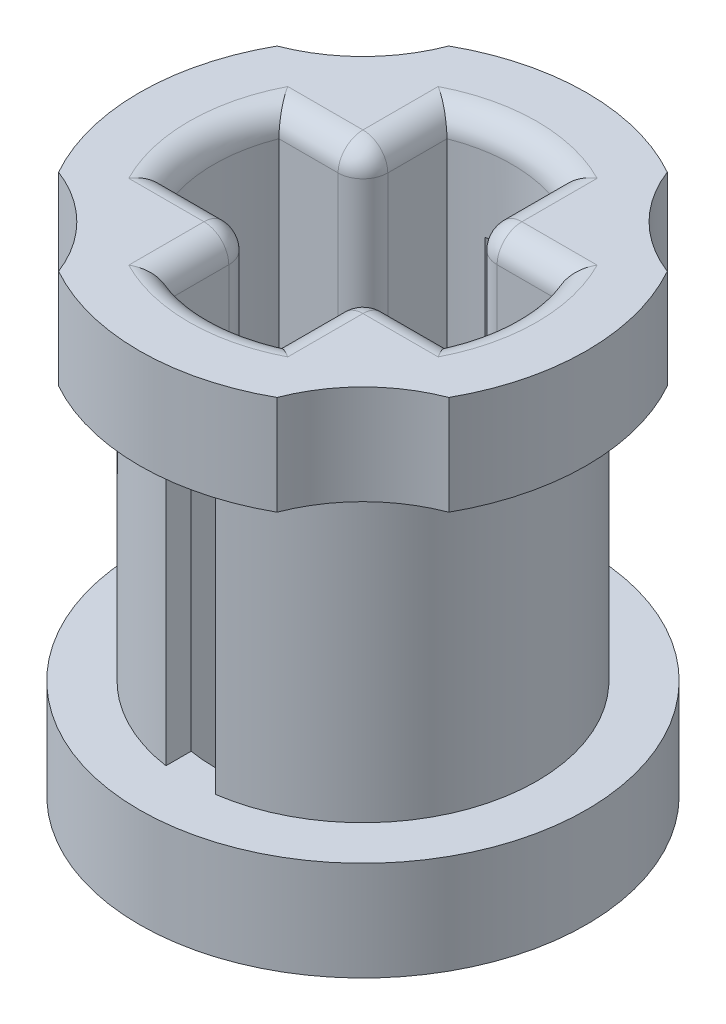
ISO-10303-21;
HEADER;
FILE_DESCRIPTION(('STEP AP214'),'2;1');
FILE_NAME('part.step','',(''),(''),'','','');
FILE_SCHEMA(('AUTOMOTIVE_DESIGN { 1 0 10303 214 1 1 1 1 }'));
ENDSEC;
DATA;
#1=APPLICATION_CONTEXT('core data for automotive mechanical design processes');
#2=APPLICATION_PROTOCOL_DEFINITION('international standard','automotive_design',2000,#1);
#3=PRODUCT_CONTEXT('',#1,'mechanical');
#4=PRODUCT('Part','Part','',(#3));
#5=PRODUCT_RELATED_PRODUCT_CATEGORY('part','',(#4));
#6=PRODUCT_DEFINITION_FORMATION('','',#4);
#7=PRODUCT_DEFINITION_CONTEXT('part definition',#1,'design');
#8=PRODUCT_DEFINITION('design','',#6,#7);
#9=PRODUCT_DEFINITION_SHAPE('','',#8);
#10=(LENGTH_UNIT() NAMED_UNIT(*) SI_UNIT(.MILLI.,.METRE.));
#11=(NAMED_UNIT(*) PLANE_ANGLE_UNIT() SI_UNIT($,.RADIAN.));
#12=(NAMED_UNIT(*) SI_UNIT($,.STERADIAN.) SOLID_ANGLE_UNIT());
#13=UNCERTAINTY_MEASURE_WITH_UNIT(LENGTH_MEASURE(1.E-05),#10,'distance_accuracy_value','');
#14=(GEOMETRIC_REPRESENTATION_CONTEXT(3) GLOBAL_UNCERTAINTY_ASSIGNED_CONTEXT((#13)) GLOBAL_UNIT_ASSIGNED_CONTEXT((#10,
#11,#12)) REPRESENTATION_CONTEXT('',''));
#15=CARTESIAN_POINT('',(0.,0.,0.));
#16=DIRECTION('',(0.,0.,1.));
#17=DIRECTION('',(1.,0.,0.));
#18=AXIS2_PLACEMENT_3D('',#15,#16,#17);
#19=CARTESIAN_POINT('',(1.28,-4.,1.28));
#20=DIRECTION('',(0.,1.,0.));
#21=DIRECTION('',(0.,0.,1.));
#22=AXIS2_PLACEMENT_3D('',#19,#20,#21);
#23=CYLINDRICAL_SURFACE('',#22,0.4);
#24=DIRECTION('',(0.,1.,0.));
#25=VECTOR('',#24,1.);
#26=CARTESIAN_POINT('',(0.88,-4.,1.28));
#27=LINE('',#26,#25);
#28=CARTESIAN_POINT('',(0.880000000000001,-3.6,1.28));
#29=VERTEX_POINT('',#28);
#30=CARTESIAN_POINT('',(0.88,3.59999999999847,1.28));
#31=VERTEX_POINT('',#30);
#32=EDGE_CURVE('E1225',#29,#31,#27,.T.);
#33=ORIENTED_EDGE('',*,*,#32,.T.);
#34=CARTESIAN_POINT('',(1.28,3.6,1.28));
#35=DIRECTION('',(1.53324403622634E-11,-1.,0.));
#36=DIRECTION('',(0.,0.,1.));
#37=AXIS2_PLACEMENT_3D('',#34,#35,#36);
#38=CIRCLE('',#37,0.4);
#39=CARTESIAN_POINT('',(1.28,3.6,0.88));
#40=VERTEX_POINT('',#39);
#41=EDGE_CURVE('E268',#40,#31,#38,.F.);
#42=ORIENTED_EDGE('',*,*,#41,.F.);
#43=DIRECTION('',(0.,1.,0.));
#44=VECTOR('',#43,1.);
#45=CARTESIAN_POINT('',(1.28,-4.,0.88));
#46=LINE('',#45,#44);
#47=CARTESIAN_POINT('',(1.28,-3.6,0.88));
#48=VERTEX_POINT('',#47);
#49=EDGE_CURVE('E266',#40,#48,#46,.F.);
#50=ORIENTED_EDGE('',*,*,#49,.T.);
#51=CARTESIAN_POINT('',(1.28,-3.6,1.28));
#52=DIRECTION('',(0.,1.,0.));
#53=DIRECTION('',(0.,0.,1.));
#54=AXIS2_PLACEMENT_3D('',#51,#52,#53);
#55=CIRCLE('',#54,0.4);
#56=EDGE_CURVE('E251',#48,#29,#55,.T.);
#57=ORIENTED_EDGE('',*,*,#56,.T.);
#58=EDGE_LOOP('',(#33,#42,#50,#57));
#59=FACE_BOUND('',#58,.T.);
#60=ADVANCED_FACE('F16',(#59),#23,.T.);
#61=CARTESIAN_POINT('',(1.28,-4.,0.88));
#62=DIRECTION('',(0.,0.,1.));
#63=DIRECTION('',(1.,0.,0.));
#64=AXIS2_PLACEMENT_3D('',#61,#62,#63);
#65=PLANE('',#64);
#66=DIRECTION('',(1.,0.,0.));
#67=VECTOR('',#66,1.);
#68=CARTESIAN_POINT('',(1.28,-3.6,0.88));
#69=LINE('',#68,#67);
#70=CARTESIAN_POINT('',(2.23284571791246,-3.6,0.88));
#71=VERTEX_POINT('',#70);
#72=EDGE_CURVE('E271',#48,#71,#69,.T.);
#73=ORIENTED_EDGE('',*,*,#72,.F.);
#74=ORIENTED_EDGE('',*,*,#49,.F.);
#75=DIRECTION('',(1.,0.,0.));
#76=VECTOR('',#75,1.);
#77=CARTESIAN_POINT('',(1.28,3.6,0.88));
#78=LINE('',#77,#76);
#79=CARTESIAN_POINT('',(2.23284571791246,3.6,0.88));
#80=VERTEX_POINT('',#79);
#81=EDGE_CURVE('E262',#80,#40,#78,.F.);
#82=ORIENTED_EDGE('',*,*,#81,.F.);
#83=DIRECTION('',(0.,1.,0.));
#84=VECTOR('',#83,1.);
#85=CARTESIAN_POINT('',(2.23284571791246,-4.,0.88));
#86=LINE('',#85,#84);
#87=EDGE_CURVE('E284',#80,#71,#86,.F.);
#88=ORIENTED_EDGE('',*,*,#87,.T.);
#89=EDGE_LOOP('',(#73,#74,#82,#88));
#90=FACE_BOUND('',#89,.T.);
#91=ADVANCED_FACE('F282',(#90),#65,.F.);
#92=CARTESIAN_POINT('',(1.28,3.6,1.28));
#93=DIRECTION('',(0.,0.,1.));
#94=DIRECTION('',(0.,-1.,0.));
#95=AXIS2_PLACEMENT_3D('',#92,#93,#94);
#96=SPHERICAL_SURFACE('',#95,0.4);
#97=ORIENTED_EDGE('',*,*,#41,.T.);
#98=CARTESIAN_POINT('',(1.28,3.6,1.28));
#99=DIRECTION('',(0.,0.,1.));
#100=DIRECTION('',(1.,0.,0.));
#101=AXIS2_PLACEMENT_3D('',#98,#99,#100);
#102=CIRCLE('',#101,0.4);
#103=CARTESIAN_POINT('',(1.28,4.,1.28));
#104=VERTEX_POINT('',#103);
#105=EDGE_CURVE('E1976',#104,#31,#102,.T.);
#106=ORIENTED_EDGE('',*,*,#105,.F.);
#107=CARTESIAN_POINT('',(1.28,3.6,1.28));
#108=DIRECTION('',(-1.,0.,0.));
#109=DIRECTION('',(0.,0.,1.));
#110=AXIS2_PLACEMENT_3D('',#107,#108,#109);
#111=CIRCLE('',#110,0.4);
#112=EDGE_CURVE('E1968',#40,#104,#111,.F.);
#113=ORIENTED_EDGE('',*,*,#112,.F.);
#114=EDGE_LOOP('',(#97,#106,#113));
#115=FACE_BOUND('',#114,.T.);
#116=ADVANCED_FACE('F1276',(#115),#96,.T.);
#117=CARTESIAN_POINT('',(1.28,-4.,-0.88));
#118=DIRECTION('',(0.,0.,-1.));
#119=DIRECTION('',(-1.,0.,0.));
#120=AXIS2_PLACEMENT_3D('',#117,#118,#119);
#121=PLANE('',#120);
#122=DIRECTION('',(-1.,0.,0.));
#123=VECTOR('',#122,1.);
#124=CARTESIAN_POINT('',(1.28,-3.6,-0.88));
#125=LINE('',#124,#123);
#126=CARTESIAN_POINT('',(2.23284571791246,-3.6,-0.88));
#127=VERTEX_POINT('',#126);
#128=CARTESIAN_POINT('',(1.28,-3.6,-0.88));
#129=VERTEX_POINT('',#128);
#130=EDGE_CURVE('E287',#127,#129,#125,.T.);
#131=ORIENTED_EDGE('',*,*,#130,.F.);
#132=DIRECTION('',(0.,1.,0.));
#133=VECTOR('',#132,1.);
#134=CARTESIAN_POINT('',(2.23284571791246,-4.,-0.88));
#135=LINE('',#134,#133);
#136=CARTESIAN_POINT('',(2.23284571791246,3.6,-0.88));
#137=VERTEX_POINT('',#136);
#138=EDGE_CURVE('E1844',#127,#137,#135,.T.);
#139=ORIENTED_EDGE('',*,*,#138,.T.);
#140=DIRECTION('',(1.,0.,0.));
#141=VECTOR('',#140,1.);
#142=CARTESIAN_POINT('',(1.28,3.6,-0.88));
#143=LINE('',#142,#141);
#144=CARTESIAN_POINT('',(1.28,3.6,-0.88));
#145=VERTEX_POINT('',#144);
#146=EDGE_CURVE('E1880',#145,#137,#143,.T.);
#147=ORIENTED_EDGE('',*,*,#146,.F.);
#148=DIRECTION('',(0.,1.,0.));
#149=VECTOR('',#148,1.);
#150=CARTESIAN_POINT('',(1.28,-4.,-0.88));
#151=LINE('',#150,#149);
#152=EDGE_CURVE('E1263',#129,#145,#151,.T.);
#153=ORIENTED_EDGE('',*,*,#152,.F.);
#154=EDGE_LOOP('',(#131,#139,#147,#153));
#155=FACE_BOUND('',#154,.T.);
#156=ADVANCED_FACE('F1256',(#155),#121,.F.);
#157=CARTESIAN_POINT('',(1.28,3.6,-1.28));
#158=DIRECTION('',(0.,0.,1.));
#159=DIRECTION('',(0.,-1.,0.));
#160=AXIS2_PLACEMENT_3D('',#157,#158,#159);
#161=SPHERICAL_SURFACE('',#160,0.4);
#162=CARTESIAN_POINT('',(1.28,3.6,-1.28));
#163=DIRECTION('',(1.,0.,0.));
#164=DIRECTION('',(0.,0.,-1.));
#165=AXIS2_PLACEMENT_3D('',#162,#163,#164);
#166=CIRCLE('',#165,0.4);
#167=CARTESIAN_POINT('',(1.28,4.,-1.28));
#168=VERTEX_POINT('',#167);
#169=EDGE_CURVE('E1877',#168,#145,#166,.T.);
#170=ORIENTED_EDGE('',*,*,#169,.F.);
#171=CARTESIAN_POINT('',(1.28,3.6,-1.28));
#172=DIRECTION('',(0.,0.,1.));
#173=DIRECTION('',(1.,0.,0.));
#174=AXIS2_PLACEMENT_3D('',#171,#172,#173);
#175=CIRCLE('',#174,0.4);
#176=CARTESIAN_POINT('',(0.88,3.6,-1.28));
#177=VERTEX_POINT('',#176);
#178=EDGE_CURVE('E856',#177,#168,#175,.F.);
#179=ORIENTED_EDGE('',*,*,#178,.F.);
#180=CARTESIAN_POINT('',(1.28,3.6,-1.28));
#181=DIRECTION('',(0.,1.,0.));
#182=DIRECTION('',(0.,0.,1.));
#183=AXIS2_PLACEMENT_3D('',#180,#181,#182);
#184=CIRCLE('',#183,0.4);
#185=EDGE_CURVE('E1266',#145,#177,#184,.F.);
#186=ORIENTED_EDGE('',*,*,#185,.F.);
#187=EDGE_LOOP('',(#170,#179,#186));
#188=FACE_BOUND('',#187,.T.);
#189=ADVANCED_FACE('F1251',(#188),#161,.T.);
#190=CARTESIAN_POINT('',(-2.23284571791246,-4.,-0.88));
#191=DIRECTION('',(0.,0.,-1.));
#192=DIRECTION('',(-1.,0.,0.));
#193=AXIS2_PLACEMENT_3D('',#190,#191,#192);
#194=PLANE('',#193);
#195=DIRECTION('',(-1.,0.,0.));
#196=VECTOR('',#195,1.);
#197=CARTESIAN_POINT('',(-2.23284571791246,-3.6,-0.88));
#198=LINE('',#197,#196);
#199=CARTESIAN_POINT('',(-1.28,-3.6,-0.88));
#200=VERTEX_POINT('',#199);
#201=CARTESIAN_POINT('',(-2.23284571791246,-3.6,-0.88));
#202=VERTEX_POINT('',#201);
#203=EDGE_CURVE('E1226',#200,#202,#198,.T.);
#204=ORIENTED_EDGE('',*,*,#203,.F.);
#205=DIRECTION('',(0.,1.,0.));
#206=VECTOR('',#205,1.);
#207=CARTESIAN_POINT('',(-1.28,-4.,-0.88));
#208=LINE('',#207,#206);
#209=CARTESIAN_POINT('',(-1.28,3.6,-0.88));
#210=VERTEX_POINT('',#209);
#211=EDGE_CURVE('E804',#210,#200,#208,.F.);
#212=ORIENTED_EDGE('',*,*,#211,.F.);
#213=DIRECTION('',(1.,0.,0.));
#214=VECTOR('',#213,1.);
#215=CARTESIAN_POINT('',(-2.23284571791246,3.6,-0.88));
#216=LINE('',#215,#214);
#217=CARTESIAN_POINT('',(-2.23284571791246,3.6,-0.88));
#218=VERTEX_POINT('',#217);
#219=EDGE_CURVE('E1872',#218,#210,#216,.T.);
#220=ORIENTED_EDGE('',*,*,#219,.F.);
#221=DIRECTION('',(0.,1.,0.));
#222=VECTOR('',#221,1.);
#223=CARTESIAN_POINT('',(-2.23284571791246,-4.,-0.88));
#224=LINE('',#223,#222);
#225=EDGE_CURVE('E1228',#218,#202,#224,.F.);
#226=ORIENTED_EDGE('',*,*,#225,.T.);
#227=EDGE_LOOP('',(#204,#212,#220,#226));
#228=FACE_BOUND('',#227,.T.);
#229=ADVANCED_FACE('F1246',(#228),#194,.F.);
#230=CARTESIAN_POINT('',(-1.28,3.6,-1.28));
#231=DIRECTION('',(0.,0.,1.));
#232=DIRECTION('',(0.,-1.,0.));
#233=AXIS2_PLACEMENT_3D('',#230,#231,#232);
#234=SPHERICAL_SURFACE('',#233,0.4);
#235=CARTESIAN_POINT('',(-1.28,3.6,-1.28));
#236=DIRECTION('',(0.,0.,-1.));
#237=DIRECTION('',(-1.,0.,0.));
#238=AXIS2_PLACEMENT_3D('',#235,#236,#237);
#239=CIRCLE('',#238,0.4);
#240=CARTESIAN_POINT('',(-1.28,4.,-1.28));
#241=VERTEX_POINT('',#240);
#242=CARTESIAN_POINT('',(-0.88,3.6,-1.28));
#243=VERTEX_POINT('',#242);
#244=EDGE_CURVE('E824',#241,#243,#239,.T.);
#245=ORIENTED_EDGE('',*,*,#244,.F.);
#246=CARTESIAN_POINT('',(-1.28,3.6,-1.28));
#247=DIRECTION('',(1.,0.,0.));
#248=DIRECTION('',(0.,0.,-1.));
#249=AXIS2_PLACEMENT_3D('',#246,#247,#248);
#250=CIRCLE('',#249,0.4);
#251=EDGE_CURVE('E1874',#210,#241,#250,.F.);
#252=ORIENTED_EDGE('',*,*,#251,.F.);
#253=CARTESIAN_POINT('',(-1.28,3.6,-1.28));
#254=DIRECTION('',(0.,1.,0.));
#255=DIRECTION('',(0.,0.,1.));
#256=AXIS2_PLACEMENT_3D('',#253,#254,#255);
#257=CIRCLE('',#256,0.4);
#258=EDGE_CURVE('E803',#243,#210,#257,.F.);
#259=ORIENTED_EDGE('',*,*,#258,.F.);
#260=EDGE_LOOP('',(#245,#252,#259));
#261=FACE_BOUND('',#260,.T.);
#262=ADVANCED_FACE('F1241',(#261),#234,.T.);
#263=CARTESIAN_POINT('',(0.88,-4.,1.28));
#264=DIRECTION('',(1.,0.,0.));
#265=DIRECTION('',(0.,0.,-1.));
#266=AXIS2_PLACEMENT_3D('',#263,#264,#265);
#267=PLANE('',#266);
#268=DIRECTION('',(0.,0.,-1.));
#269=VECTOR('',#268,1.);
#270=CARTESIAN_POINT('',(0.88,-3.6,1.28));
#271=LINE('',#270,#269);
#272=CARTESIAN_POINT('',(0.880000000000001,-3.6,2.23284571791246));
#273=VERTEX_POINT('',#272);
#274=EDGE_CURVE('E1221',#273,#29,#271,.T.);
#275=ORIENTED_EDGE('',*,*,#274,.F.);
#276=DIRECTION('',(0.,1.,0.));
#277=VECTOR('',#276,1.);
#278=CARTESIAN_POINT('',(0.880000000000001,-4.,2.23284571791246));
#279=LINE('',#278,#277);
#280=CARTESIAN_POINT('',(0.880000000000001,3.6,2.23284571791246));
#281=VERTEX_POINT('',#280);
#282=EDGE_CURVE('E789',#273,#281,#279,.T.);
#283=ORIENTED_EDGE('',*,*,#282,.T.);
#284=DIRECTION('',(0.,0.,1.));
#285=VECTOR('',#284,1.);
#286=CARTESIAN_POINT('',(0.880000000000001,3.6,1.28));
#287=LINE('',#286,#285);
#288=EDGE_CURVE('E1951',#31,#281,#287,.T.);
#289=ORIENTED_EDGE('',*,*,#288,.F.);
#290=ORIENTED_EDGE('',*,*,#32,.F.);
#291=EDGE_LOOP('',(#275,#283,#289,#290));
#292=FACE_BOUND('',#291,.T.);
#293=ADVANCED_FACE('F1245',(#292),#267,.F.);
#294=CARTESIAN_POINT('',(0.,-4.,0.));
#295=DIRECTION('',(0.,1.,0.));
#296=DIRECTION('',(0.,0.,1.));
#297=AXIS2_PLACEMENT_3D('',#294,#295,#296);
#298=CYLINDRICAL_SURFACE('',#297,2.4);
#299=CARTESIAN_POINT('',(0.,-3.6,0.));
#300=DIRECTION('',(0.,1.,0.));
#301=DIRECTION('',(0.,0.,1.));
#302=AXIS2_PLACEMENT_3D('',#299,#300,#301);
#303=CIRCLE('',#302,2.4);
#304=CARTESIAN_POINT('',(-2.23284571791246,-3.6,0.88));
#305=VERTEX_POINT('',#304);
#306=EDGE_CURVE('E752',#202,#305,#303,.T.);
#307=ORIENTED_EDGE('',*,*,#306,.F.);
#308=ORIENTED_EDGE('',*,*,#225,.F.);
#309=CARTESIAN_POINT('',(0.,3.6,0.));
#310=DIRECTION('',(0.,1.,0.));
#311=DIRECTION('',(0.,0.,1.));
#312=AXIS2_PLACEMENT_3D('',#309,#310,#311);
#313=CIRCLE('',#312,2.4);
#314=CARTESIAN_POINT('',(-2.23284571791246,3.6,0.88));
#315=VERTEX_POINT('',#314);
#316=EDGE_CURVE('E1889',#315,#218,#313,.F.);
#317=ORIENTED_EDGE('',*,*,#316,.F.);
#318=DIRECTION('',(0.,1.,0.));
#319=VECTOR('',#318,1.);
#320=CARTESIAN_POINT('',(-2.23284571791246,-4.,0.88));
#321=LINE('',#320,#319);
#322=EDGE_CURVE('E1977',#315,#305,#321,.F.);
#323=ORIENTED_EDGE('',*,*,#322,.T.);
#324=EDGE_LOOP('',(#307,#308,#317,#323));
#325=FACE_BOUND('',#324,.T.);
#326=ADVANCED_FACE('F1752',(#325),#298,.F.);
#327=CARTESIAN_POINT('',(-1.28,-3.6,-1.28));
#328=DIRECTION('',(0.,0.,1.));
#329=DIRECTION('',(0.,-1.,0.));
#330=AXIS2_PLACEMENT_3D('',#327,#328,#329);
#331=SPHERICAL_SURFACE('',#330,0.4);
#332=CARTESIAN_POINT('',(-1.28,-3.6,-1.28));
#333=DIRECTION('',(-1.,0.,0.));
#334=DIRECTION('',(0.,0.,1.));
#335=AXIS2_PLACEMENT_3D('',#332,#333,#334);
#336=CIRCLE('',#335,0.4);
#337=CARTESIAN_POINT('',(-1.28,-4.,-1.28));
#338=VERTEX_POINT('',#337);
#339=EDGE_CURVE('E719',#338,#200,#336,.T.);
#340=ORIENTED_EDGE('',*,*,#339,.F.);
#341=CARTESIAN_POINT('',(-1.28,-3.6,-1.28));
#342=DIRECTION('',(0.,0.,1.));
#343=DIRECTION('',(1.,0.,0.));
#344=AXIS2_PLACEMENT_3D('',#341,#342,#343);
#345=CIRCLE('',#344,0.4);
#346=CARTESIAN_POINT('',(-0.88,-3.6,-1.28));
#347=VERTEX_POINT('',#346);
#348=EDGE_CURVE('E144',#347,#338,#345,.F.);
#349=ORIENTED_EDGE('',*,*,#348,.F.);
#350=CARTESIAN_POINT('',(-1.28,-3.6,-1.28));
#351=DIRECTION('',(0.,1.,0.));
#352=DIRECTION('',(0.,0.,1.));
#353=AXIS2_PLACEMENT_3D('',#350,#351,#352);
#354=CIRCLE('',#353,0.4);
#355=EDGE_CURVE('E800',#200,#347,#354,.T.);
#356=ORIENTED_EDGE('',*,*,#355,.F.);
#357=EDGE_LOOP('',(#340,#349,#356));
#358=FACE_BOUND('',#357,.T.);
#359=ADVANCED_FACE('F1743',(#358),#331,.T.);
#360=CARTESIAN_POINT('',(1.28,-3.6,-1.28));
#361=DIRECTION('',(0.,0.,1.));
#362=DIRECTION('',(0.,-1.,0.));
#363=AXIS2_PLACEMENT_3D('',#360,#361,#362);
#364=SPHERICAL_SURFACE('',#363,0.4);
#365=CARTESIAN_POINT('',(1.28,-3.6,-1.28));
#366=DIRECTION('',(0.,0.,-1.));
#367=DIRECTION('',(-1.,0.,0.));
#368=AXIS2_PLACEMENT_3D('',#365,#366,#367);
#369=CIRCLE('',#368,0.4);
#370=CARTESIAN_POINT('',(1.28,-4.,-1.28));
#371=VERTEX_POINT('',#370);
#372=CARTESIAN_POINT('',(0.88,-3.6,-1.28));
#373=VERTEX_POINT('',#372);
#374=EDGE_CURVE('E660',#371,#373,#369,.T.);
#375=ORIENTED_EDGE('',*,*,#374,.F.);
#376=CARTESIAN_POINT('',(1.28,-3.6,-1.28));
#377=DIRECTION('',(-1.,0.,0.));
#378=DIRECTION('',(0.,0.,1.));
#379=AXIS2_PLACEMENT_3D('',#376,#377,#378);
#380=CIRCLE('',#379,0.4);
#381=EDGE_CURVE('E652',#129,#371,#380,.F.);
#382=ORIENTED_EDGE('',*,*,#381,.F.);
#383=CARTESIAN_POINT('',(1.28,-3.6,-1.28));
#384=DIRECTION('',(0.,1.,0.));
#385=DIRECTION('',(0.,0.,1.));
#386=AXIS2_PLACEMENT_3D('',#383,#384,#385);
#387=CIRCLE('',#386,0.4);
#388=EDGE_CURVE('E864',#373,#129,#387,.T.);
#389=ORIENTED_EDGE('',*,*,#388,.F.);
#390=EDGE_LOOP('',(#375,#382,#389));
#391=FACE_BOUND('',#390,.T.);
#392=ADVANCED_FACE('F1734',(#391),#364,.T.);
#393=CARTESIAN_POINT('',(0.,-4.,0.));
#394=DIRECTION('',(0.,1.,0.));
#395=DIRECTION('',(0.,0.,1.));
#396=AXIS2_PLACEMENT_3D('',#393,#394,#395);
#397=CYLINDRICAL_SURFACE('',#396,2.4);
#398=CARTESIAN_POINT('',(0.,-3.6,0.));
#399=DIRECTION('',(0.,1.,0.));
#400=DIRECTION('',(0.,0.,1.));
#401=AXIS2_PLACEMENT_3D('',#398,#399,#400);
#402=CIRCLE('',#401,2.4);
#403=EDGE_CURVE('E280',#71,#127,#402,.T.);
#404=ORIENTED_EDGE('',*,*,#403,.F.);
#405=ORIENTED_EDGE('',*,*,#87,.F.);
#406=CARTESIAN_POINT('',(0.,3.6,0.));
#407=DIRECTION('',(0.,1.,0.));
#408=DIRECTION('',(0.,0.,1.));
#409=AXIS2_PLACEMENT_3D('',#406,#407,#408);
#410=CIRCLE('',#409,2.4);
#411=EDGE_CURVE('E2053',#137,#80,#410,.F.);
#412=ORIENTED_EDGE('',*,*,#411,.F.);
#413=ORIENTED_EDGE('',*,*,#138,.F.);
#414=EDGE_LOOP('',(#404,#405,#412,#413));
#415=FACE_BOUND('',#414,.T.);
#416=ADVANCED_FACE('F1726',(#415),#397,.F.);
#417=CARTESIAN_POINT('',(1.28,-3.6,1.28));
#418=DIRECTION('',(0.,0.,1.));
#419=DIRECTION('',(0.,-1.,0.));
#420=AXIS2_PLACEMENT_3D('',#417,#418,#419);
#421=SPHERICAL_SURFACE('',#420,0.4);
#422=ORIENTED_EDGE('',*,*,#56,.F.);
#423=CARTESIAN_POINT('',(1.28,-3.6,1.28));
#424=DIRECTION('',(1.,0.,0.));
#425=DIRECTION('',(0.,0.,-1.));
#426=AXIS2_PLACEMENT_3D('',#423,#424,#425);
#427=CIRCLE('',#426,0.4);
#428=CARTESIAN_POINT('',(1.28,-4.,1.28));
#429=VERTEX_POINT('',#428);
#430=EDGE_CURVE('E256',#429,#48,#427,.T.);
#431=ORIENTED_EDGE('',*,*,#430,.F.);
#432=CARTESIAN_POINT('',(1.28,-3.6,1.28));
#433=DIRECTION('',(0.,0.,-1.));
#434=DIRECTION('',(-1.,0.,0.));
#435=AXIS2_PLACEMENT_3D('',#432,#433,#434);
#436=CIRCLE('',#435,0.4);
#437=EDGE_CURVE('E259',#29,#429,#436,.F.);
#438=ORIENTED_EDGE('',*,*,#437,.F.);
#439=EDGE_LOOP('',(#422,#431,#438));
#440=FACE_BOUND('',#439,.T.);
#441=ADVANCED_FACE('F253',(#440),#421,.T.);
#442=CARTESIAN_POINT('',(-2.23284571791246,-4.,0.88));
#443=DIRECTION('',(0.,0.,1.));
#444=DIRECTION('',(1.,0.,0.));
#445=AXIS2_PLACEMENT_3D('',#442,#443,#444);
#446=PLANE('',#445);
#447=DIRECTION('',(1.,0.,0.));
#448=VECTOR('',#447,1.);
#449=CARTESIAN_POINT('',(0.,-3.6,0.88));
#450=LINE('',#449,#448);
#451=CARTESIAN_POINT('',(-1.28,-3.6,0.88));
#452=VERTEX_POINT('',#451);
#453=EDGE_CURVE('E782',#305,#452,#450,.T.);
#454=ORIENTED_EDGE('',*,*,#453,.F.);
#455=ORIENTED_EDGE('',*,*,#322,.F.);
#456=DIRECTION('',(-1.,0.,0.));
#457=VECTOR('',#456,1.);
#458=CARTESIAN_POINT('',(-2.23284571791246,3.6,0.88));
#459=LINE('',#458,#457);
#460=CARTESIAN_POINT('',(-1.28,3.6,0.88));
#461=VERTEX_POINT('',#460);
#462=EDGE_CURVE('E1932',#461,#315,#459,.T.);
#463=ORIENTED_EDGE('',*,*,#462,.F.);
#464=DIRECTION('',(0.,1.,0.));
#465=VECTOR('',#464,1.);
#466=CARTESIAN_POINT('',(-1.28,-4.,0.88));
#467=LINE('',#466,#465);
#468=EDGE_CURVE('E567',#452,#461,#467,.T.);
#469=ORIENTED_EDGE('',*,*,#468,.F.);
#470=EDGE_LOOP('',(#454,#455,#463,#469));
#471=FACE_BOUND('',#470,.T.);
#472=ADVANCED_FACE('F1709',(#471),#446,.F.);
#473=CARTESIAN_POINT('',(-1.28,3.6,1.28));
#474=DIRECTION('',(0.,0.,1.));
#475=DIRECTION('',(0.,-1.,0.));
#476=AXIS2_PLACEMENT_3D('',#473,#474,#475);
#477=SPHERICAL_SURFACE('',#476,0.4);
#478=CARTESIAN_POINT('',(-1.28,3.6,1.28));
#479=DIRECTION('',(0.,1.,0.));
#480=DIRECTION('',(0.,0.,1.));
#481=AXIS2_PLACEMENT_3D('',#478,#479,#480);
#482=CIRCLE('',#481,0.4);
#483=CARTESIAN_POINT('',(-0.88,3.6,1.28));
#484=VERTEX_POINT('',#483);
#485=EDGE_CURVE('E1024',#461,#484,#482,.F.);
#486=ORIENTED_EDGE('',*,*,#485,.F.);
#487=CARTESIAN_POINT('',(-1.28,3.6,1.28));
#488=DIRECTION('',(-1.,0.,0.));
#489=DIRECTION('',(0.,0.,1.));
#490=AXIS2_PLACEMENT_3D('',#487,#488,#489);
#491=CIRCLE('',#490,0.4);
#492=CARTESIAN_POINT('',(-1.28,4.,1.28));
#493=VERTEX_POINT('',#492);
#494=EDGE_CURVE('E1939',#493,#461,#491,.T.);
#495=ORIENTED_EDGE('',*,*,#494,.F.);
#496=CARTESIAN_POINT('',(-1.28,3.6,1.28));
#497=DIRECTION('',(0.,0.,-1.));
#498=DIRECTION('',(-1.,0.,0.));
#499=AXIS2_PLACEMENT_3D('',#496,#497,#498);
#500=CIRCLE('',#499,0.4);
#501=EDGE_CURVE('E553',#484,#493,#500,.F.);
#502=ORIENTED_EDGE('',*,*,#501,.F.);
#503=EDGE_LOOP('',(#486,#495,#502));
#504=FACE_BOUND('',#503,.T.);
#505=ADVANCED_FACE('F1701',(#504),#477,.T.);
#506=CARTESIAN_POINT('',(-1.28,-3.6,1.28));
#507=DIRECTION('',(0.,0.,1.));
#508=DIRECTION('',(0.,-1.,0.));
#509=AXIS2_PLACEMENT_3D('',#506,#507,#508);
#510=SPHERICAL_SURFACE('',#509,0.4);
#511=CARTESIAN_POINT('',(-1.28,-3.6,1.28));
#512=DIRECTION('',(0.,1.,0.));
#513=DIRECTION('',(0.,0.,1.));
#514=AXIS2_PLACEMENT_3D('',#511,#512,#513);
#515=CIRCLE('',#514,0.4);
#516=CARTESIAN_POINT('',(-0.88,-3.6,1.28));
#517=VERTEX_POINT('',#516);
#518=EDGE_CURVE('E561',#517,#452,#515,.T.);
#519=ORIENTED_EDGE('',*,*,#518,.F.);
#520=CARTESIAN_POINT('',(-1.28,-3.6,1.28));
#521=DIRECTION('',(0.,0.,1.));
#522=DIRECTION('',(1.,0.,0.));
#523=AXIS2_PLACEMENT_3D('',#520,#521,#522);
#524=CIRCLE('',#523,0.4);
#525=CARTESIAN_POINT('',(-1.28,-4.,1.28));
#526=VERTEX_POINT('',#525);
#527=EDGE_CURVE('E504',#526,#517,#524,.T.);
#528=ORIENTED_EDGE('',*,*,#527,.F.);
#529=CARTESIAN_POINT('',(-1.28,-3.6,1.28));
#530=DIRECTION('',(1.,0.,0.));
#531=DIRECTION('',(0.,0.,-1.));
#532=AXIS2_PLACEMENT_3D('',#529,#530,#531);
#533=CIRCLE('',#532,0.4);
#534=EDGE_CURVE('E760',#452,#526,#533,.F.);
#535=ORIENTED_EDGE('',*,*,#534,.F.);
#536=EDGE_LOOP('',(#519,#528,#535));
#537=FACE_BOUND('',#536,.T.);
#538=ADVANCED_FACE('F1021',(#537),#510,.T.);
#539=CARTESIAN_POINT('',(1.28,3.6,1.28));
#540=DIRECTION('',(-1.,0.,0.));
#541=DIRECTION('',(0.,0.,1.));
#542=AXIS2_PLACEMENT_3D('',#539,#540,#541);
#543=CYLINDRICAL_SURFACE('',#542,0.4);
#544=ORIENTED_EDGE('',*,*,#112,.T.);
#545=DIRECTION('',(1.,0.,0.));
#546=VECTOR('',#545,1.);
#547=CARTESIAN_POINT('',(0.,4.,1.28));
#548=LINE('',#547,#546);
#549=CARTESIAN_POINT('',(2.49030118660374,4.,1.28));
#550=VERTEX_POINT('',#549);
#551=EDGE_CURVE('E500',#550,#104,#548,.F.);
#552=ORIENTED_EDGE('',*,*,#551,.F.);
#553=CARTESIAN_POINT('',(2.23284571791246,3.6,0.88));
#554=CARTESIAN_POINT('',(2.23284564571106,3.60410561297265,0.879999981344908));
#555=CARTESIAN_POINT('',(2.23288654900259,3.60821114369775,0.880068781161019));
#556=CARTESIAN_POINT('',(2.23305178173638,3.61646031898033,0.880342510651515));
#557=CARTESIAN_POINT('',(2.23317700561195,3.62060389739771,0.880548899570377));
#558=CARTESIAN_POINT('',(2.23351426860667,3.62892499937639,0.881099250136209));
#559=CARTESIAN_POINT('',(2.2337272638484,3.63310238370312,0.881444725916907));
#560=CARTESIAN_POINT('',(2.23424318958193,3.6414867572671,0.882274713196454));
#561=CARTESIAN_POINT('',(2.23454713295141,3.6456935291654,0.882760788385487));
#562=CARTESIAN_POINT('',(2.23524792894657,3.65413208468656,0.883873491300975));
#563=CARTESIAN_POINT('',(2.23564584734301,3.65836356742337,0.88450172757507));
#564=CARTESIAN_POINT('',(2.23653737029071,3.66684671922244,0.885900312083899));
#565=CARTESIAN_POINT('',(2.23703208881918,3.67109799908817,0.886672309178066));
#566=CARTESIAN_POINT('',(2.23811978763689,3.67961568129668,0.88836001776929));
#567=CARTESIAN_POINT('',(2.23871392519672,3.68388160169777,0.889277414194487));
#568=CARTESIAN_POINT('',(2.2400028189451,3.6924232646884,0.891257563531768));
#569=CARTESIAN_POINT('',(2.24069877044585,3.69669842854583,0.892322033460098));
#570=CARTESIAN_POINT('',(2.24219341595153,3.70525304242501,0.894598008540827));
#571=CARTESIAN_POINT('',(2.24299333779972,3.70953181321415,0.895811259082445));
#572=CARTESIAN_POINT('',(2.24469779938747,3.718087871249,0.898386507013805));
#573=CARTESIAN_POINT('',(2.24560359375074,3.72236437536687,0.899750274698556));
#574=CARTESIAN_POINT('',(2.24752141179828,3.73090989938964,0.902628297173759));
#575=CARTESIAN_POINT('',(2.24853471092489,3.73517802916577,0.904144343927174));
#576=CARTESIAN_POINT('',(2.25066887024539,3.74370057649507,0.907328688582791));
#577=CARTESIAN_POINT('',(2.25179102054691,3.7479539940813,0.908998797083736));
#578=CARTESIAN_POINT('',(2.25414391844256,3.75644066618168,0.912493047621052));
#579=CARTESIAN_POINT('',(2.25537596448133,3.76067280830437,0.914319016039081));
#580=CARTESIAN_POINT('',(2.25794937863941,3.76911026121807,0.918126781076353));
#581=CARTESIAN_POINT('',(2.25929204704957,3.77331434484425,0.920110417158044));
#582=CARTESIAN_POINT('',(2.26208710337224,3.78168880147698,0.92423531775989));
#583=CARTESIAN_POINT('',(2.26354078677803,3.78585783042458,0.926378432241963));
#584=CARTESIAN_POINT('',(2.2665579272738,3.79415509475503,0.930824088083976));
#585=CARTESIAN_POINT('',(2.26812266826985,3.79828186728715,0.933128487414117));
#586=CARTESIAN_POINT('',(2.27136161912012,3.80648734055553,0.93789850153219));
#587=CARTESIAN_POINT('',(2.27303709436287,3.81056445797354,0.940365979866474));
#588=CARTESIAN_POINT('',(2.27649683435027,3.81866315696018,0.945463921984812));
#589=CARTESIAN_POINT('',(2.2782823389,3.82268303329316,0.948096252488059));
#590=CARTESIAN_POINT('',(2.28196106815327,3.83065961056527,0.953525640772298));
#591=CARTESIAN_POINT('',(2.28385549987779,3.8346144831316,0.95632456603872));
#592=CARTESIAN_POINT('',(2.28775060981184,3.84245325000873,0.962088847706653));
#593=CARTESIAN_POINT('',(2.28975245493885,3.84633519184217,0.965056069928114));
#594=CARTESIAN_POINT('',(2.29386049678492,3.85402014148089,0.971158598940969));
#595=CARTESIAN_POINT('',(2.29596781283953,3.85782107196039,0.974295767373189));
#596=CARTESIAN_POINT('',(2.30028447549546,3.86533591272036,0.980739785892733));
#597=CARTESIAN_POINT('',(2.30249488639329,3.86904762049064,0.984048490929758));
#598=CARTESIAN_POINT('',(2.30701494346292,3.87637578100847,0.990837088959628));
#599=CARTESIAN_POINT('',(2.30932559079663,3.87998990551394,0.994318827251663));
#600=CARTESIAN_POINT('',(2.31404297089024,3.8871146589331,1.00145497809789));
#601=CARTESIAN_POINT('',(2.31645063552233,3.89062283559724,1.00511122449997));
#602=CARTESIAN_POINT('',(2.32050952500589,3.89633323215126,1.01130311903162));
#603=CARTESIAN_POINT('',(2.32214567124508,3.89858133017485,1.01380650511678));
#604=CARTESIAN_POINT('',(2.32552445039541,3.90311469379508,1.01898709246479));
#605=CARTESIAN_POINT('',(2.32726832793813,3.90539623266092,1.02166674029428));
#606=CARTESIAN_POINT('',(2.33279151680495,3.91244135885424,1.03016601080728));
#607=CARTESIAN_POINT('',(2.33661915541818,3.91706137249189,1.03607397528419));
#608=CARTESIAN_POINT('',(2.34473852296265,3.92633126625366,1.0486254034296));
#609=CARTESIAN_POINT('',(2.34904109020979,3.93094667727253,1.05528731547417));
#610=CARTESIAN_POINT('',(2.35572126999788,3.93767624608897,1.06564523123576));
#611=CARTESIAN_POINT('',(2.3580555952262,3.93994854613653,1.06926736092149));
#612=CARTESIAN_POINT('',(2.36284808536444,3.94445544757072,1.07671027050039));
#613=CARTESIAN_POINT('',(2.36530751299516,3.94668506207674,1.08053326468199));
#614=CARTESIAN_POINT('',(2.37035109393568,3.95109122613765,1.08838164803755));
#615=CARTESIAN_POINT('',(2.37293643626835,3.95326254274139,1.09240920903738));
#616=CARTESIAN_POINT('',(2.37823177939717,3.95753599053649,1.10067066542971));
#617=CARTESIAN_POINT('',(2.38094286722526,3.95963263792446,1.10490670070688));
#618=CARTESIAN_POINT('',(2.38648971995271,3.9637400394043,1.11358812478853));
#619=CARTESIAN_POINT('',(2.38932648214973,3.96574506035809,1.11803559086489));
#620=CARTESIAN_POINT('',(2.39511982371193,3.96965082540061,1.1271452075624));
#621=CARTESIAN_POINT('',(2.39807714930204,3.97154555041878,1.1318094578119));
#622=CARTESIAN_POINT('',(2.40587808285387,3.97628201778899,1.14412039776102));
#623=CARTESIAN_POINT('',(2.41074559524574,3.97897566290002,1.1518094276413));
#624=CARTESIAN_POINT('',(2.4205588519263,3.98388876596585,1.16731491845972));
#625=CARTESIAN_POINT('',(2.42550475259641,3.98610709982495,1.17513163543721));
#626=CARTESIAN_POINT('',(2.43544189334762,3.99006030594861,1.19088540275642));
#627=CARTESIAN_POINT('',(2.44043321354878,3.99179400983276,1.1988226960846));
#628=CARTESIAN_POINT('',(2.45043443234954,3.99477180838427,1.21480453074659));
#629=CARTESIAN_POINT('',(2.45544434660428,3.99601470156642,1.22284928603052));
#630=CARTESIAN_POINT('',(2.46545424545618,3.99800607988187,1.23903362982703));
#631=CARTESIAN_POINT('',(2.47045417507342,3.99875333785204,1.24717340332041));
#632=CARTESIAN_POINT('',(2.4804162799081,3.99975108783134,1.26353422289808));
#633=CARTESIAN_POINT('',(2.48537833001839,4.0000003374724,1.27175542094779));
#634=CARTESIAN_POINT('',(2.49030118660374,4.,1.28));
#635=B_SPLINE_CURVE_WITH_KNOTS('',3,(#553,#554,#555,#556,#557,#558,#559,#560,#561,#562,#563,
#564,#565,#566,#567,#568,#569,#570,#571,#572,#573,#574,#575,#576,#577,#578,#579,#580,#581,#582,
#583,#584,#585,#586,#587,#588,#589,#590,#591,#592,#593,#594,#595,#596,#597,#598,#599,#600,#601,
#602,#603,#604,#605,#606,#607,#608,#609,#610,#611,#612,#613,#614,#615,#616,#617,#618,#619,#620,
#621,#622,#623,#624,#625,#626,#627,#628,#629,#630,#631,#632,#633,#634),.UNSPECIFIED.,.F.,.F.,(4,
2,2,2,2,2,2,2,2,2,2,2,2,2,2,2,2,2,2,2,2,2,2,2,2,2,2,2,2,2,2,2,2,2,2,2,2,2,2,2,4),(0.,
0.012315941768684,0.0247646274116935,0.0373526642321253,0.0500864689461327,0.0629722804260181,
0.0760161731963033,0.0892240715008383,0.102601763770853,0.116154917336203,0.129889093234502,
0.143809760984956,0.15792231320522,0.172232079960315,0.186744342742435,0.201464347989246,
0.216397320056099,0.231548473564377,0.246923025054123,0.26252620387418,0.27836326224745,
0.294439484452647,0.310760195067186,0.327330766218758,0.344156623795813,0.355379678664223,
0.367161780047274,0.392410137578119,0.419922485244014,0.434535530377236,0.449722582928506,
0.465486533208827,0.481830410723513,0.498757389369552,0.516270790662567,0.544728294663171,
0.573252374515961,0.601844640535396,0.630506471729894,0.65923900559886,0.688043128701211),.UNSPECIFIED.);
#636=EDGE_CURVE('E865',#80,#550,#635,.T.);
#637=ORIENTED_EDGE('',*,*,#636,.F.);
#638=ORIENTED_EDGE('',*,*,#81,.T.);
#639=EDGE_LOOP('',(#544,#552,#637,#638));
#640=FACE_BOUND('',#639,.T.);
#641=ADVANCED_FACE('F1685',(#640),#543,.T.);
#642=CARTESIAN_POINT('',(1.28,3.6,1.28));
#643=DIRECTION('',(0.,0.,1.));
#644=DIRECTION('',(1.,0.,0.));
#645=AXIS2_PLACEMENT_3D('',#642,#643,#644);
#646=CYLINDRICAL_SURFACE('',#645,0.4);
#647=CARTESIAN_POINT('',(1.28,4.,2.49030118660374));
#648=CARTESIAN_POINT('',(1.27184486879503,4.00000030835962,2.48532134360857));
#649=CARTESIAN_POINT('',(1.26370475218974,3.9997504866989,2.4803170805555));
#650=CARTESIAN_POINT('',(1.24747275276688,3.99875250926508,2.47028889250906));
#651=CARTESIAN_POINT('',(1.23938084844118,3.99800459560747,2.46526497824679));
#652=CARTESIAN_POINT('',(1.2232596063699,3.99601286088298,2.45522431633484));
#653=CARTESIAN_POINT('',(1.21523023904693,3.99476929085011,2.45020756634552));
#654=CARTESIAN_POINT('',(1.19924653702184,3.99179136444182,2.44020972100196));
#655=CARTESIAN_POINT('',(1.19129216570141,3.99005726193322,2.43522860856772));
#656=CARTESIAN_POINT('',(1.17547429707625,3.98610371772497,2.42532457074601));
#657=CARTESIAN_POINT('',(1.16761075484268,3.98388452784,2.42040161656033));
#658=CARTESIAN_POINT('',(1.15197420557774,3.97897329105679,2.4106584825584));
#659=CARTESIAN_POINT('',(1.14420115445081,3.97628148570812,2.40583825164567));
#660=CARTESIAN_POINT('',(1.12824511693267,3.9702080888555,2.39591610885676));
#661=CARTESIAN_POINT('',(1.12007275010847,3.96679085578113,2.39081881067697));
#662=CARTESIAN_POINT('',(1.104175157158,3.95948682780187,2.38079525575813));
#663=CARTESIAN_POINT('',(1.09644382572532,3.95561468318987,2.37586801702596));
#664=CARTESIAN_POINT('',(1.08141365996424,3.94744887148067,2.3662305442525));
#665=CARTESIAN_POINT('',(1.07410879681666,3.94316901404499,2.36151801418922));
#666=CARTESIAN_POINT('',(1.05993247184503,3.93423021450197,2.35232800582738));
#667=CARTESIAN_POINT('',(1.05305465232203,3.92958435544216,2.34784760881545));
#668=CARTESIAN_POINT('',(1.03972626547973,3.91995641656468,2.33914192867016));
#669=CARTESIAN_POINT('',(1.03326919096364,3.91498665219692,2.33491302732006));
#670=CARTESIAN_POINT('',(1.02383831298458,3.90725947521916,2.32872978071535));
#671=CARTESIAN_POINT('',(1.02076780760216,3.90466665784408,2.32671553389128));
#672=CARTESIAN_POINT('',(1.01472923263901,3.89941465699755,2.32275671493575));
#673=CARTESIAN_POINT('',(1.01176033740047,3.89675685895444,2.32081156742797));
#674=CARTESIAN_POINT('',(1.00511339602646,3.89062235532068,2.31644911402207));
#675=CARTESIAN_POINT('',(1.001455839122,3.88711523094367,2.31404323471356));
#676=CARTESIAN_POINT('',(0.994318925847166,3.87999175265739,2.30932756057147));
#677=CARTESIAN_POINT('',(0.990837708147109,3.87637786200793,2.30701686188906));
#678=CARTESIAN_POINT('',(0.984049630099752,3.86905037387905,2.30249711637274));
#679=CARTESIAN_POINT('',(0.980740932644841,3.86533910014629,2.30028706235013));
#680=CARTESIAN_POINT('',(0.974297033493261,3.85782505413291,2.29597093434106));
#681=CARTESIAN_POINT('',(0.971159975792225,3.85402448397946,2.29386379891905));
#682=CARTESIAN_POINT('',(0.965057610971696,3.84634024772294,2.28975609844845));
#683=CARTESIAN_POINT('',(0.962090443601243,3.84245865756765,2.28775441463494));
#684=CARTESIAN_POINT('',(0.956326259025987,3.83462056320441,2.28385956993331));
#685=CARTESIAN_POINT('',(0.953527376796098,3.83066601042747,2.28196524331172));
#686=CARTESIAN_POINT('',(0.948098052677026,3.82269004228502,2.27828668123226));
#687=CARTESIAN_POINT('',(0.945465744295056,3.81867045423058,2.27650123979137));
#688=CARTESIAN_POINT('',(0.940367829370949,3.8105722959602,2.27304158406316));
#689=CARTESIAN_POINT('',(0.937900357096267,3.8064954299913,2.27136613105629));
#690=CARTESIAN_POINT('',(0.933130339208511,3.7982904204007,2.26812718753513));
#691=CARTESIAN_POINT('',(0.930825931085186,3.79416385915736,2.26656243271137));
#692=CARTESIAN_POINT('',(0.926380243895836,3.78586697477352,2.26354523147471));
#693=CARTESIAN_POINT('',(0.92423710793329,3.78169811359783,2.26209150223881));
#694=CARTESIAN_POINT('',(0.920112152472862,3.77332394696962,2.25929632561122));
#695=CARTESIAN_POINT('',(0.918128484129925,3.76911998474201,2.25795358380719));
#696=CARTESIAN_POINT('',(0.914320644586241,3.76068272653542,2.25537999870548));
#697=CARTESIAN_POINT('',(0.912494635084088,3.75645065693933,2.25414785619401));
#698=CARTESIAN_POINT('',(0.909000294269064,3.74796407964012,2.25179474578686));
#699=CARTESIAN_POINT('',(0.907330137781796,3.74371068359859,2.25067248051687));
#700=CARTESIAN_POINT('',(0.904145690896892,3.73518812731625,2.24853807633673));
#701=CARTESIAN_POINT('',(0.902629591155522,3.73091996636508,2.24752464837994));
#702=CARTESIAN_POINT('',(0.899751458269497,3.7223743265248,2.2456065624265));
#703=CARTESIAN_POINT('',(0.898387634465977,3.71809773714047,2.24470063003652));
#704=CARTESIAN_POINT('',(0.895812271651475,3.70954145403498,2.2429958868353));
#705=CARTESIAN_POINT('',(0.89459896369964,3.70526254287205,2.24219582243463));
#706=CARTESIAN_POINT('',(0.892322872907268,3.69670759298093,2.24070089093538));
#707=CARTESIAN_POINT('',(0.89125834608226,3.69243223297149,2.24000479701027));
#708=CARTESIAN_POINT('',(0.889278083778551,3.68389012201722,2.23871562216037));
#709=CARTESIAN_POINT('',(0.888360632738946,3.67962394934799,2.23812134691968));
#710=CARTESIAN_POINT('',(0.886672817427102,3.67110570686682,2.23703338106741));
#711=CARTESIAN_POINT('',(0.885900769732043,3.66685411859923,2.23653853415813));
#712=CARTESIAN_POINT('',(0.884502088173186,3.65837029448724,2.23564676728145));
#713=CARTESIAN_POINT('',(0.883873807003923,3.65413844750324,2.23524873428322));
#714=CARTESIAN_POINT('',(0.882761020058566,3.64569910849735,2.23454772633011));
#715=CARTESIAN_POINT('',(0.882274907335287,3.64149191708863,2.23424368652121));
#716=CARTESIAN_POINT('',(0.881444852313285,3.63310665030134,2.23372758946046));
#717=CARTESIAN_POINT('',(0.881099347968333,3.62892879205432,2.23351452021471));
#718=CARTESIAN_POINT('',(0.880548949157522,3.62060668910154,2.23317713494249));
#719=CARTESIAN_POINT('',(0.880342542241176,3.61646258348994,2.2330518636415));
#720=CARTESIAN_POINT('',(0.880068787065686,3.60821230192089,2.23288656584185));
#721=CARTESIAN_POINT('',(0.879999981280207,3.60410619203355,2.23284564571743));
#722=CARTESIAN_POINT('',(0.880000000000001,3.6,2.23284571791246));
#723=B_SPLINE_CURVE_WITH_KNOTS('',3,(#647,#648,#649,#650,#651,#652,#653,#654,#655,#656,#657,
#658,#659,#660,#661,#662,#663,#664,#665,#666,#667,#668,#669,#670,#671,#672,#673,#674,#675,#676,
#677,#678,#679,#680,#681,#682,#683,#684,#685,#686,#687,#688,#689,#690,#691,#692,#693,#694,#695,
#696,#697,#698,#699,#700,#701,#702,#703,#704,#705,#706,#707,#708,#709,#710,#711,#712,#713,#714,
#715,#716,#717,#718,#719,#720,#721,#722),.UNSPECIFIED.,.F.,.F.,(4,2,2,2,2,2,2,2,2,2,2,2,2,2,2,2,
2,2,2,2,2,2,2,2,2,2,2,2,2,2,2,2,2,2,2,2,2,4),(0.,0.0286626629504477,0.0573114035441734,
0.0859456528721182,0.114565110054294,0.14316974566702,0.171759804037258,0.202401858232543,
0.232240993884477,0.261293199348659,0.289573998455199,0.317098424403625,0.330582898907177,
0.34388366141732,0.360707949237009,0.377277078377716,0.393596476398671,0.409671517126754,
0.425507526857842,0.441109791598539,0.456483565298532,0.471634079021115,0.486566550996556,
0.501286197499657,0.515798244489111,0.530107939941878,0.544220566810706,0.558141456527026,
0.571876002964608,0.58542967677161,0.59880803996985,0.612016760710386,0.625061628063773,
0.637948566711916,0.650683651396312,0.663273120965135,0.675723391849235,0.688041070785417),.UNSPECIFIED.);
#724=CARTESIAN_POINT('',(1.28,4.,2.49030118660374));
#725=VERTEX_POINT('',#724);
#726=EDGE_CURVE('E487',#725,#281,#723,.T.);
#727=ORIENTED_EDGE('',*,*,#726,.F.);
#728=DIRECTION('',(0.,0.,1.));
#729=VECTOR('',#728,1.);
#730=CARTESIAN_POINT('',(1.28,4.,0.));
#731=LINE('',#730,#729);
#732=EDGE_CURVE('E493',#104,#725,#731,.T.);
#733=ORIENTED_EDGE('',*,*,#732,.F.);
#734=ORIENTED_EDGE('',*,*,#105,.T.);
#735=ORIENTED_EDGE('',*,*,#288,.T.);
#736=EDGE_LOOP('',(#727,#733,#734,#735));
#737=FACE_BOUND('',#736,.T.);
#738=ADVANCED_FACE('F1676',(#737),#646,.T.);
#739=CARTESIAN_POINT('',(-2.23284571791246,3.6,1.28));
#740=DIRECTION('',(-1.,0.,0.));
#741=DIRECTION('',(0.,0.,1.));
#742=AXIS2_PLACEMENT_3D('',#739,#740,#741);
#743=CYLINDRICAL_SURFACE('',#742,0.4);
#744=ORIENTED_EDGE('',*,*,#494,.T.);
#745=ORIENTED_EDGE('',*,*,#462,.T.);
#746=CARTESIAN_POINT('',(-2.49030118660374,4.,1.28));
#747=CARTESIAN_POINT('',(-2.48532025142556,4.0000003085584,1.27184308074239));
#748=CARTESIAN_POINT('',(-2.48031490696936,3.99975037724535,1.26370116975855));
#749=CARTESIAN_POINT('',(-2.47028457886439,3.99875196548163,1.24746555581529));
#750=CARTESIAN_POINT('',(-2.46525960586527,3.99800372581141,1.23937183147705));
#751=CARTESIAN_POINT('',(-2.45521686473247,3.99601112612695,1.22324693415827));
#752=CARTESIAN_POINT('',(-2.45019909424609,3.99476701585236,1.21521573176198));
#753=CARTESIAN_POINT('',(-2.44019926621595,3.99178780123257,1.19922835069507));
#754=CARTESIAN_POINT('',(-2.43521719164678,3.99005294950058,1.1912721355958));
#755=CARTESIAN_POINT('',(-2.42531128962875,3.98609770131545,1.17545058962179));
#756=CARTESIAN_POINT('',(-2.42038743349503,3.98387755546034,1.1675852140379));
#757=CARTESIAN_POINT('',(-2.41064262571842,3.97896422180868,1.1519449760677));
#758=CARTESIAN_POINT('',(-2.4058216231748,3.97627127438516,1.14417006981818));
#759=CARTESIAN_POINT('',(-2.39590445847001,3.97019933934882,1.12822099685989));
#760=CARTESIAN_POINT('',(-2.39081281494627,3.96678540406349,1.12005724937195));
#761=CARTESIAN_POINT('',(-2.38079841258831,3.9594878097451,1.10417384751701));
#762=CARTESIAN_POINT('',(-2.37587469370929,3.95561859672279,1.09644816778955));
#763=CARTESIAN_POINT('',(-2.36624224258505,3.94745789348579,1.08142640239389));
#764=CARTESIAN_POINT('',(-2.36153125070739,3.94318002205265,1.07412436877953));
#765=CARTESIAN_POINT('',(-2.35234246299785,3.93424388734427,1.05995098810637));
#766=CARTESIAN_POINT('',(-2.34786179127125,3.92959852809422,1.05307336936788));
#767=CARTESIAN_POINT('',(-2.33915394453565,3.91996979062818,1.03974285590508));
#768=CARTESIAN_POINT('',(-2.33492320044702,3.91499856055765,1.03328354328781));
#769=CARTESIAN_POINT('',(-2.32873676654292,3.90726824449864,1.02384846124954));
#770=CARTESIAN_POINT('',(-2.32672110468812,3.9046738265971,1.0207759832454));
#771=CARTESIAN_POINT('',(-2.32275917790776,3.89941800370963,1.01473290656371));
#772=CARTESIAN_POINT('',(-2.32081234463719,3.89675796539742,1.01176149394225));
#773=CARTESIAN_POINT('',(-2.31644826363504,3.89062114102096,1.00511213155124));
#774=CARTESIAN_POINT('',(-2.31404241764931,3.88711402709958,1.00145460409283));
#775=CARTESIAN_POINT('',(-2.30932679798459,3.87999056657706,0.9943177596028));
#776=CARTESIAN_POINT('',(-2.30701612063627,3.87637668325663,0.990836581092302));
#777=CARTESIAN_POINT('',(-2.30249641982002,3.8690492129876,0.984048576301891));
#778=CARTESIAN_POINT('',(-2.30028638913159,3.86533794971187,0.980739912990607));
#779=CARTESIAN_POINT('',(-2.29597030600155,3.85782392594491,0.974296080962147));
#780=CARTESIAN_POINT('',(-2.29386319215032,3.85402336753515,0.971159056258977));
#781=CARTESIAN_POINT('',(-2.2897555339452,3.8463391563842,0.965056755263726));
#782=CARTESIAN_POINT('',(-2.28775387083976,3.84245757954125,0.962089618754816));
#783=CARTESIAN_POINT('',(-2.28385906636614,3.83461951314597,0.956325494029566));
#784=CARTESIAN_POINT('',(-2.28196475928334,3.83066497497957,0.953526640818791));
#785=CARTESIAN_POINT('',(-2.27828623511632,3.82268903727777,0.948097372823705));
#786=CARTESIAN_POINT('',(-2.27650081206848,3.8186694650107,0.945465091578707));
#787=CARTESIAN_POINT('',(-2.27304119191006,3.8105713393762,0.940367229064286));
#788=CARTESIAN_POINT('',(-2.27136575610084,3.80649449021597,0.937899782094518));
#789=CARTESIAN_POINT('',(-2.26812684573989,3.79828951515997,0.933129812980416));
#790=CARTESIAN_POINT('',(-2.26656210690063,3.79416297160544,0.930825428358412));
#791=CARTESIAN_POINT('',(-2.2635449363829,3.78586612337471,0.926379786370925));
#792=CARTESIAN_POINT('',(-2.2620912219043,3.78169728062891,0.924236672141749));
#793=CARTESIAN_POINT('',(-2.25929607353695,3.77332315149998,0.920111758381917));
#794=CARTESIAN_POINT('',(-2.25795334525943,3.76911920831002,0.91812811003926));
#795=CARTESIAN_POINT('',(-2.25537978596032,3.76068198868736,0.914320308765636));
#796=CARTESIAN_POINT('',(-2.25414765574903,3.75644993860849,0.912494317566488));
#797=CARTESIAN_POINT('',(-2.25179456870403,3.74796340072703,0.909000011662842));
#798=CARTESIAN_POINT('',(-2.25067231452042,3.74371002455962,0.907329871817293));
#799=CARTESIAN_POINT('',(-2.24853793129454,3.73518750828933,0.904145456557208));
#800=CARTESIAN_POINT('',(-2.24752451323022,3.73091936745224,0.902629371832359));
#801=CARTESIAN_POINT('',(-2.24560644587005,3.72237376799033,0.899751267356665));
#802=CARTESIAN_POINT('',(-2.24470052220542,3.71809719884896,0.898387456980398));
#803=CARTESIAN_POINT('',(-2.24299579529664,3.70954095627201,0.895812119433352));
#804=CARTESIAN_POINT('',(-2.24219573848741,3.70526206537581,0.894598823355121));
#805=CARTESIAN_POINT('',(-2.24070082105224,3.69670715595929,0.892322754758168));
#806=CARTESIAN_POINT('',(-2.24000473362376,3.69243181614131,0.891258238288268));
#807=CARTESIAN_POINT('',(-2.23871557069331,3.68388974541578,0.889277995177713));
#808=CARTESIAN_POINT('',(-2.2381213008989,3.6796235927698,0.888360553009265));
#809=CARTESIAN_POINT('',(-2.23703334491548,3.67110539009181,0.886672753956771));
#810=CARTESIAN_POINT('',(-2.23653850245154,3.66685382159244,0.885900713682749));
#811=CARTESIAN_POINT('',(-2.2356467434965,3.65837003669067,0.884502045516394));
#812=CARTESIAN_POINT('',(-2.23524871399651,3.65413820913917,0.883873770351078));
#813=CARTESIAN_POINT('',(-2.2345477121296,3.64569890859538,0.882760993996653));
#814=CARTESIAN_POINT('',(-2.23424367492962,3.64149173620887,0.88227488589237));
#815=CARTESIAN_POINT('',(-2.23372758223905,3.63310650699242,0.8814448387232));
#816=CARTESIAN_POINT('',(-2.23351451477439,3.62892866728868,0.881099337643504));
#817=CARTESIAN_POINT('',(-2.23317713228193,3.62060660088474,0.880548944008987));
#818=CARTESIAN_POINT('',(-2.23305186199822,3.61646251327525,0.880342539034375));
#819=CARTESIAN_POINT('',(-2.23288656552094,3.60821226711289,0.880068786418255));
#820=CARTESIAN_POINT('',(-2.23284564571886,3.60410617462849,0.879999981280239));
#821=CARTESIAN_POINT('',(-2.23284571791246,3.6,0.879999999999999));
#822=B_SPLINE_CURVE_WITH_KNOTS('',3,(#746,#747,#748,#749,#750,#751,#752,#753,#754,#755,#756,
#757,#758,#759,#760,#761,#762,#763,#764,#765,#766,#767,#768,#769,#770,#771,#772,#773,#774,#775,
#776,#777,#778,#779,#780,#781,#782,#783,#784,#785,#786,#787,#788,#789,#790,#791,#792,#793,#794,
#795,#796,#797,#798,#799,#800,#801,#802,#803,#804,#805,#806,#807,#808,#809,#810,#811,#812,#813,
#814,#815,#816,#817,#818,#819,#820,#821),.UNSPECIFIED.,.F.,.F.,(4,2,2,2,2,2,2,2,2,2,2,2,2,2,2,2,
2,2,2,2,2,2,2,2,2,2,2,2,2,2,2,2,2,2,2,2,2,4),(0.,0.028668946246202,0.0573240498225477,
0.0859647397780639,0.11459071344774,0.143201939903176,0.171798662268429,0.20240832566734,
0.232225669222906,0.261266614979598,0.28954662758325,0.317080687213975,0.330573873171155,
0.343885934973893,0.360710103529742,0.377279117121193,0.3935984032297,0.409673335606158,
0.425509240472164,0.441111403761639,0.456485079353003,0.471635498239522,0.486567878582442,
0.501287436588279,0.515799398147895,0.530109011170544,0.544221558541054,0.558142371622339,
0.571876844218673,0.585430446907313,0.598808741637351,0.612017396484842,0.625062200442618,
0.637949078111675,0.65068410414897,0.663273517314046,0.675723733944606,0.688041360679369),.UNSPECIFIED.);
#823=CARTESIAN_POINT('',(-2.49030118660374,4.,1.28));
#824=VERTEX_POINT('',#823);
#825=EDGE_CURVE('E1916',#824,#315,#822,.T.);
#826=ORIENTED_EDGE('',*,*,#825,.F.);
#827=DIRECTION('',(1.,0.,0.));
#828=VECTOR('',#827,1.);
#829=CARTESIAN_POINT('',(0.,4.,1.28));
#830=LINE('',#829,#828);
#831=EDGE_CURVE('E991',#493,#824,#830,.F.);
#832=ORIENTED_EDGE('',*,*,#831,.F.);
#833=EDGE_LOOP('',(#744,#745,#826,#832));
#834=FACE_BOUND('',#833,.T.);
#835=ADVANCED_FACE('F1667',(#834),#743,.T.);
#836=CARTESIAN_POINT('',(0.,3.6,0.));
#837=DIRECTION('',(0.,1.,0.));
#838=DIRECTION('',(0.,0.,1.));
#839=AXIS2_PLACEMENT_3D('',#836,#837,#838);
#840=TOROIDAL_SURFACE('',#839,2.8,0.4);
#841=ORIENTED_EDGE('',*,*,#825,.T.);
#842=ORIENTED_EDGE('',*,*,#316,.T.);
#843=CARTESIAN_POINT('',(-2.23284571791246,3.6,-0.88));
#844=CARTESIAN_POINT('',(-2.2328456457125,3.60410559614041,-0.879999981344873));
#845=CARTESIAN_POINT('',(-2.23288654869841,3.60821111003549,-0.880068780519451));
#846=CARTESIAN_POINT('',(-2.23305178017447,3.61646025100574,-0.880342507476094));
#847=CARTESIAN_POINT('',(-2.23317700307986,3.62060381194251,-0.880548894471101));
#848=CARTESIAN_POINT('',(-2.23351426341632,3.62892487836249,-0.881099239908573));
#849=CARTESIAN_POINT('',(-2.23372725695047,3.63310224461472,-0.881444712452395));
#850=CARTESIAN_POINT('',(-2.23424317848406,3.64148658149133,-0.882274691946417));
#851=CARTESIAN_POINT('',(-2.23454711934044,3.64569333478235,-0.88276076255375));
#852=CARTESIAN_POINT('',(-2.23524790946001,3.65413185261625,-0.883873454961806));
#853=CARTESIAN_POINT('',(-2.23564582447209,3.65836331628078,-0.88450168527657));
#854=CARTESIAN_POINT('',(-2.23653733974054,3.6668464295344,-0.885900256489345));
#855=CARTESIAN_POINT('',(-2.23703205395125,3.67109768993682,-0.886672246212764));
#856=CARTESIAN_POINT('',(-2.23811974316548,3.67961533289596,-0.888359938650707));
#857=CARTESIAN_POINT('',(-2.23871387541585,3.68388123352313,-0.889277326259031));
#858=CARTESIAN_POINT('',(-2.24000275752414,3.69242285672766,-0.891257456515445));
#859=CARTESIAN_POINT('',(-2.24069870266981,3.69669800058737,-0.892321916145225));
#860=CARTESIAN_POINT('',(-2.24219333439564,3.70525257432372,-0.894597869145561));
#861=CARTESIAN_POINT('',(-2.24299324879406,3.70953132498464,-0.895811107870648));
#862=CARTESIAN_POINT('',(-2.24469769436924,3.71808734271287,-0.898386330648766));
#863=CARTESIAN_POINT('',(-2.24560348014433,3.72236382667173,-0.89975008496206));
#864=CARTESIAN_POINT('',(-2.24752127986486,3.73090931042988,-0.90262807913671));
#865=CARTESIAN_POINT('',(-2.24853456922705,3.73517742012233,-0.904144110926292));
#866=CARTESIAN_POINT('',(-2.25066870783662,3.74369992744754,-0.907328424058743));
#867=CARTESIAN_POINT('',(-2.25179084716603,3.74795332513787,-0.908998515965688));
#868=CARTESIAN_POINT('',(-2.25414372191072,3.75643995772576,-0.912492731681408));
#869=CARTESIAN_POINT('',(-2.25537575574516,3.76067208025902,-0.914318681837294));
#870=CARTESIAN_POINT('',(-2.2579491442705,3.76910949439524,-0.918126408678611));
#871=CARTESIAN_POINT('',(-2.25929179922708,3.7733135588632,-0.920110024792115));
#872=CARTESIAN_POINT('',(-2.26208682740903,3.78168797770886,-0.924234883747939));
#873=CARTESIAN_POINT('',(-2.26354049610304,3.78585698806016,-0.926377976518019));
#874=CARTESIAN_POINT('',(-2.26655760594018,3.79415421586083,-0.930823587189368));
#875=CARTESIAN_POINT('',(-2.26812233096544,3.79828097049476,-0.933127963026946));
#876=CARTESIAN_POINT('',(-2.27136124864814,3.80648640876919,-0.937897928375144));
#877=CARTESIAN_POINT('',(-2.27303670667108,3.81056350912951,-0.940365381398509));
#878=CARTESIAN_POINT('',(-2.27649641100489,3.81866217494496,-0.945463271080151));
#879=CARTESIAN_POINT('',(-2.27828189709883,3.82268203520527,-0.948095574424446));
#880=CARTESIAN_POINT('',(-2.28196058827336,3.83065858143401,-0.953524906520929));
#881=CARTESIAN_POINT('',(-2.28385500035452,3.83461343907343,-0.956323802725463));
#882=CARTESIAN_POINT('',(-2.28775006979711,3.84245217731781,-0.962088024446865));
#883=CARTESIAN_POINT('',(-2.28975189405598,3.84633410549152,-0.965055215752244));
#884=CARTESIAN_POINT('',(-2.29385989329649,3.8540190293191,-0.971157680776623));
#885=CARTESIAN_POINT('',(-2.29596718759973,3.85781994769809,-0.974294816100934));
#886=CARTESIAN_POINT('',(-2.30028380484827,3.86533476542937,-0.980738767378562));
#887=CARTESIAN_POINT('',(-2.30249419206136,3.86904646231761,-0.984047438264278));
#888=CARTESIAN_POINT('',(-2.30701420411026,3.87637460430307,-0.990835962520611));
#889=CARTESIAN_POINT('',(-2.30932483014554,3.87998872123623,-0.994317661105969));
#890=CARTESIAN_POINT('',(-2.31404215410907,3.88711345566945,-1.00145374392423));
#891=CARTESIAN_POINT('',(-2.31644978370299,3.89062162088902,-1.00510996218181));
#892=CARTESIAN_POINT('',(-2.32050992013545,3.89633379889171,-1.01130369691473));
#893=CARTESIAN_POINT('',(-2.32214735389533,3.89858362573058,-1.01380900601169));
#894=CARTESIAN_POINT('',(-2.32552848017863,3.90311993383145,-1.01899299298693));
#895=CARTESIAN_POINT('',(-2.32727341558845,3.90540270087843,-1.02167410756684));
#896=CARTESIAN_POINT('',(-2.33279891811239,3.9124501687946,-1.03017636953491));
#897=CARTESIAN_POINT('',(-2.33662786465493,3.91707125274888,-1.03608585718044));
#898=CARTESIAN_POINT('',(-2.34474862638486,3.92634156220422,-1.04863840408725));
#899=CARTESIAN_POINT('',(-2.34905124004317,3.93095644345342,-1.05529984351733));
#900=CARTESIAN_POINT('',(-2.35573093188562,3.93768471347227,-1.06565627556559));
#901=CARTESIAN_POINT('',(-2.35806474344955,3.93995626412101,-1.06927737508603));
#902=CARTESIAN_POINT('',(-2.36285582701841,3.9444613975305,-1.07671767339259));
#903=CARTESIAN_POINT('',(-2.36531435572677,3.94669001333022,-1.08053907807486));
#904=CARTESIAN_POINT('',(-2.37035574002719,3.95109397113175,-1.08838371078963));
#905=CARTESIAN_POINT('',(-2.37293977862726,3.95326410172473,-1.09240910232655));
#906=CARTESIAN_POINT('',(-2.37823209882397,3.95753503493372,-1.10066562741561));
#907=CARTESIAN_POINT('',(-2.38094146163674,3.95963037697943,-1.10489889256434));
#908=CARTESIAN_POINT('',(-2.38648443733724,3.96373509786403,-1.11357416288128));
#909=CARTESIAN_POINT('',(-2.38931904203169,3.96573876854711,-1.11801823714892));
#910=CARTESIAN_POINT('',(-2.39510763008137,3.96964184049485,-1.12712043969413));
#911=CARTESIAN_POINT('',(-2.39806235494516,3.97153524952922,-1.13178065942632));
#912=CARTESIAN_POINT('',(-2.40586156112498,3.97627180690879,-1.14408908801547));
#913=CARTESIAN_POINT('',(-2.41072998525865,3.97896660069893,-1.15177972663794));
#914=CARTESIAN_POINT('',(-2.42054512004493,3.98388180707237,-1.16728852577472));
#915=CARTESIAN_POINT('',(-2.42549198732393,3.98610109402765,-1.17510694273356));
#916=CARTESIAN_POINT('',(-2.43543108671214,3.99005600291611,-1.1908642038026));
#917=CARTESIAN_POINT('',(-2.4404233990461,3.99179045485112,-1.19880329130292));
#918=CARTESIAN_POINT('',(-2.45042661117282,3.99476954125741,-1.21478879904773));
#919=CARTESIAN_POINT('',(-2.45543752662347,3.99601297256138,-1.22283543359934));
#920=CARTESIAN_POINT('',(-2.46544941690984,3.99800521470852,-1.23902361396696));
#921=CARTESIAN_POINT('',(-2.47045033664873,3.99875279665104,-1.24716534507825));
#922=CARTESIAN_POINT('',(-2.48041439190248,3.99975098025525,-1.26353014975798));
#923=CARTESIAN_POINT('',(-2.48537740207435,4.0000003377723,-1.27175337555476));
#924=CARTESIAN_POINT('',(-2.49030118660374,4.,-1.28));
#925=B_SPLINE_CURVE_WITH_KNOTS('',3,(#843,#844,#845,#846,#847,#848,#849,#850,#851,#852,#853,
#854,#855,#856,#857,#858,#859,#860,#861,#862,#863,#864,#865,#866,#867,#868,#869,#870,#871,#872,
#873,#874,#875,#876,#877,#878,#879,#880,#881,#882,#883,#884,#885,#886,#887,#888,#889,#890,#891,
#892,#893,#894,#895,#896,#897,#898,#899,#900,#901,#902,#903,#904,#905,#906,#907,#908,#909,#910,
#911,#912,#913,#914,#915,#916,#917,#918,#919,#920,#921,#922,#923,#924),.UNSPECIFIED.,.F.,.F.,(4,
2,2,2,2,2,2,2,2,2,2,2,2,2,2,2,2,2,2,2,2,2,2,2,2,2,2,2,2,2,2,2,2,2,2,2,2,2,2,2,4),(0.,
0.0123158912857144,0.0247645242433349,0.037352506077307,0.0500862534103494,0.0629720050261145,
0.0760158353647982,0.0892236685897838,0.102601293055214,0.116154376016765,0.129888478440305,
0.143809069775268,0.157921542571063,0.172231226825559,0.186743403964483,0.201463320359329,
0.21639620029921,0.231547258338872,0.246921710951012,0.262524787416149,0.278361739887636,
0.294437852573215,0.310758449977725,0.32732890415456,0.344154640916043,0.355386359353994,
0.367175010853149,0.392430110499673,0.419940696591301,0.434549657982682,0.449730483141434,
0.465486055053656,0.48181939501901,0.49873366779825,0.516232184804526,0.544695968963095,
0.573226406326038,0.601825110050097,0.630493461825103,0.659232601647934,0.688043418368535),.UNSPECIFIED.);
#926=CARTESIAN_POINT('',(-2.49030118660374,4.,-1.28));
#927=VERTEX_POINT('',#926);
#928=EDGE_CURVE('E1875',#927,#218,#925,.F.);
#929=ORIENTED_EDGE('',*,*,#928,.F.);
#930=CARTESIAN_POINT('',(0.,4.,0.));
#931=DIRECTION('',(0.,1.,0.));
#932=DIRECTION('',(-0.889393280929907,0.,-0.457142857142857));
#933=AXIS2_PLACEMENT_3D('',#930,#931,#932);
#934=CIRCLE('',#933,2.8);
#935=EDGE_CURVE('E944',#824,#927,#934,.F.);
#936=ORIENTED_EDGE('',*,*,#935,.F.);
#937=EDGE_LOOP('',(#841,#842,#929,#936));
#938=FACE_BOUND('',#937,.T.);
#939=ADVANCED_FACE('F1658',(#938),#840,.T.);
#940=CARTESIAN_POINT('',(-2.23284571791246,3.6,-1.28));
#941=DIRECTION('',(1.,0.,0.));
#942=DIRECTION('',(0.,0.,-1.));
#943=AXIS2_PLACEMENT_3D('',#940,#941,#942);
#944=CYLINDRICAL_SURFACE('',#943,0.4);
#945=ORIENTED_EDGE('',*,*,#928,.T.);
#946=ORIENTED_EDGE('',*,*,#219,.T.);
#947=ORIENTED_EDGE('',*,*,#251,.T.);
#948=DIRECTION('',(1.,0.,0.));
#949=VECTOR('',#948,1.);
#950=CARTESIAN_POINT('',(0.,4.,-1.28));
#951=LINE('',#950,#949);
#952=EDGE_CURVE('E985',#927,#241,#951,.T.);
#953=ORIENTED_EDGE('',*,*,#952,.F.);
#954=EDGE_LOOP('',(#945,#946,#947,#953));
#955=FACE_BOUND('',#954,.T.);
#956=ADVANCED_FACE('F1650',(#955),#944,.T.);
#957=CARTESIAN_POINT('',(1.28,3.6,-1.28));
#958=DIRECTION('',(1.,0.,0.));
#959=DIRECTION('',(0.,0.,-1.));
#960=AXIS2_PLACEMENT_3D('',#957,#958,#959);
#961=CYLINDRICAL_SURFACE('',#960,0.4);
#962=CARTESIAN_POINT('',(2.49030118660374,4.,-1.28));
#963=CARTESIAN_POINT('',(2.48532134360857,4.00000030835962,-1.27184486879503));
#964=CARTESIAN_POINT('',(2.48031708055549,3.9997504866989,-1.26370475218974));
#965=CARTESIAN_POINT('',(2.47028889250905,3.99875250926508,-1.24747275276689));
#966=CARTESIAN_POINT('',(2.46526497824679,3.99800459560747,-1.23938084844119));
#967=CARTESIAN_POINT('',(2.45522431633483,3.99601286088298,-1.22325960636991));
#968=CARTESIAN_POINT('',(2.45020756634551,3.99476929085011,-1.21523023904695));
#969=CARTESIAN_POINT('',(2.44020972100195,3.99179136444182,-1.19924653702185));
#970=CARTESIAN_POINT('',(2.43522860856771,3.99005726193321,-1.19129216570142));
#971=CARTESIAN_POINT('',(2.425324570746,3.98610371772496,-1.17547429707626));
#972=CARTESIAN_POINT('',(2.42040161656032,3.98388452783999,-1.16761075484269));
#973=CARTESIAN_POINT('',(2.41065848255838,3.97897329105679,-1.15197420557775));
#974=CARTESIAN_POINT('',(2.40583825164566,3.97628148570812,-1.14420115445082));
#975=CARTESIAN_POINT('',(2.39591610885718,3.97020808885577,-1.12824511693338));
#976=CARTESIAN_POINT('',(2.39081881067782,3.9667908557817,-1.12007275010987));
#977=CARTESIAN_POINT('',(2.38079525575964,3.95948682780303,-1.10417515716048));
#978=CARTESIAN_POINT('',(2.3758680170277,3.95561468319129,-1.09644382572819));
#979=CARTESIAN_POINT('',(2.36623054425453,3.94744887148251,-1.0814136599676));
#980=CARTESIAN_POINT('',(2.3615180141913,3.94316901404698,-1.07410879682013));
#981=CARTESIAN_POINT('',(2.35232800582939,3.93423021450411,-1.05993247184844));
#982=CARTESIAN_POINT('',(2.34784760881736,3.92958435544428,-1.05305465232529));
#983=CARTESIAN_POINT('',(2.3391419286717,3.91995641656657,-1.03972626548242));
#984=CARTESIAN_POINT('',(2.33491302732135,3.91498665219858,-1.03326919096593));
#985=CARTESIAN_POINT('',(2.32872978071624,3.90725947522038,-1.02383831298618));
#986=CARTESIAN_POINT('',(2.32671553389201,3.90466665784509,-1.02076780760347));
#987=CARTESIAN_POINT('',(2.32275671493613,3.89941465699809,-1.01472923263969));
#988=CARTESIAN_POINT('',(2.32081156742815,3.89675685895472,-1.01176033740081));
#989=CARTESIAN_POINT('',(2.31644911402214,3.89062235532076,-1.00511339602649));
#990=CARTESIAN_POINT('',(2.31404323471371,3.88711523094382,-1.00145583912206));
#991=CARTESIAN_POINT('',(2.30932756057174,3.87999175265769,-0.994318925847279));
#992=CARTESIAN_POINT('',(2.30701686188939,3.8763778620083,-0.990837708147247));
#993=CARTESIAN_POINT('',(2.30249711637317,3.86905037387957,-0.984049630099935));
#994=CARTESIAN_POINT('',(2.30028706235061,3.86533910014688,-0.980740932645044));
#995=CARTESIAN_POINT('',(2.29597093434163,3.85782505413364,-0.974297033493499));
#996=CARTESIAN_POINT('',(2.29386379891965,3.85402448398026,-0.971159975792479));
#997=CARTESIAN_POINT('',(2.28975609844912,3.84634024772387,-0.965057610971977));
#998=CARTESIAN_POINT('',(2.28775441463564,3.84245865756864,-0.962090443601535));
#999=CARTESIAN_POINT('',(2.28385956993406,3.83462056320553,-0.956326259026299));
#1000=CARTESIAN_POINT('',(2.28196524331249,3.83066601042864,-0.953527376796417));
#1001=CARTESIAN_POINT('',(2.27828668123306,3.82269004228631,-0.948098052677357));
#1002=CARTESIAN_POINT('',(2.27650123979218,3.81867045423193,-0.945465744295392));
#1003=CARTESIAN_POINT('',(2.27304158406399,3.81057229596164,-0.940367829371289));
#1004=CARTESIAN_POINT('',(2.27136613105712,3.80649542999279,-0.937900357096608));
#1005=CARTESIAN_POINT('',(2.26812718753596,3.79829042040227,-0.933130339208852));
#1006=CARTESIAN_POINT('',(2.2665624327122,3.79416385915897,-0.930825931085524));
#1007=CARTESIAN_POINT('',(2.26354523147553,3.7858669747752,-0.926380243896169));
#1008=CARTESIAN_POINT('',(2.26209150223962,3.78169811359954,-0.924237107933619));
#1009=CARTESIAN_POINT('',(2.25929632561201,3.77332394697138,-0.920112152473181));
#1010=CARTESIAN_POINT('',(2.25795358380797,3.76911998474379,-0.918128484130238));
#1011=CARTESIAN_POINT('',(2.25537999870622,3.76068272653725,-0.914320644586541));
#1012=CARTESIAN_POINT('',(2.25414785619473,3.75645065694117,-0.912494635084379));
#1013=CARTESIAN_POINT('',(2.25179474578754,3.74796407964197,-0.909000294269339));
#1014=CARTESIAN_POINT('',(2.25067248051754,3.74371068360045,-0.907330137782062));
#1015=CARTESIAN_POINT('',(2.24853807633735,3.73518812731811,-0.90414569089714));
#1016=CARTESIAN_POINT('',(2.24752464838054,3.73091996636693,-0.90262959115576));
#1017=CARTESIAN_POINT('',(2.24560656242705,3.72237432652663,-0.899751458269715));
#1018=CARTESIAN_POINT('',(2.24470063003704,3.71809773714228,-0.898387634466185));
#1019=CARTESIAN_POINT('',(2.24299588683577,3.70954145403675,-0.895812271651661));
#1020=CARTESIAN_POINT('',(2.24219582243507,3.7052625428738,-0.894598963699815));
#1021=CARTESIAN_POINT('',(2.24070089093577,3.69670759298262,-0.892322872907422));
#1022=CARTESIAN_POINT('',(2.24000479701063,3.69243223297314,-0.891258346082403));
#1023=CARTESIAN_POINT('',(2.23871562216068,3.68389012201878,-0.889278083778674));
#1024=CARTESIAN_POINT('',(2.23812134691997,3.67962394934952,-0.888360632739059));
#1025=CARTESIAN_POINT('',(2.23703338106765,3.67110570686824,-0.886672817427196));
#1026=CARTESIAN_POINT('',(2.23653853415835,3.66685411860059,-0.885900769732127));
#1027=CARTESIAN_POINT('',(2.23564676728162,3.65837029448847,-0.884502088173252));
#1028=CARTESIAN_POINT('',(2.23524873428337,3.65413844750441,-0.883873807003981));
#1029=CARTESIAN_POINT('',(2.23454772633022,3.64569910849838,-0.882761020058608));
#1030=CARTESIAN_POINT('',(2.2342436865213,3.64149191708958,-0.882274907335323));
#1031=CARTESIAN_POINT('',(2.23372758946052,3.63310665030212,-0.881444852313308));
#1032=CARTESIAN_POINT('',(2.23351452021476,3.62892879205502,-0.881099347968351));
#1033=CARTESIAN_POINT('',(2.23317713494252,3.62060668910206,-0.880548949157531));
#1034=CARTESIAN_POINT('',(2.23305186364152,3.61646258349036,-0.880342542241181));
#1035=CARTESIAN_POINT('',(2.23288656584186,3.60821230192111,-0.880068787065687));
#1036=CARTESIAN_POINT('',(2.23284564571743,3.60410619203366,-0.879999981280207));
#1037=CARTESIAN_POINT('',(2.23284571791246,3.6,-0.88));
#1038=B_SPLINE_CURVE_WITH_KNOTS('',3,(#962,#963,#964,#965,#966,#967,#968,#969,#970,#971,#972,
#973,#974,#975,#976,#977,#978,#979,#980,#981,#982,#983,#984,#985,#986,#987,#988,#989,#990,#991,
#992,#993,#994,#995,#996,#997,#998,#999,#1000,#1001,#1002,#1003,#1004,#1005,#1006,#1007,#1008,
#1009,#1010,#1011,#1012,#1013,#1014,#1015,#1016,#1017,#1018,#1019,#1020,#1021,#1022,#1023,#1024,
#1025,#1026,#1027,#1028,#1029,#1030,#1031,#1032,#1033,#1034,#1035,#1036,#1037),.UNSPECIFIED.,
.F.,.F.,(4,2,2,2,2,2,2,2,2,2,2,2,2,2,2,2,2,2,2,2,2,2,2,2,2,2,2,2,2,2,2,2,2,2,2,2,2,4),(0.,
0.028662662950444,0.0573114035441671,0.085945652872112,0.114565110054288,0.143169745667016,
0.171759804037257,0.202401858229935,0.232240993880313,0.261293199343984,0.28957399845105,
0.317098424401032,0.330582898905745,0.343883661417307,0.360707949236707,0.377277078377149,
0.393596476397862,0.409671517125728,0.425507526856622,0.441109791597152,0.456483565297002,
0.471634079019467,0.486566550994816,0.501286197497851,0.515798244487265,0.530107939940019,
0.544220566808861,0.558141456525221,0.571876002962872,0.585429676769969,0.598808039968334,
0.612016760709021,0.625061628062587,0.637948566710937,0.650683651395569,0.663273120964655,
0.675723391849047,0.688041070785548),.UNSPECIFIED.);
#1039=CARTESIAN_POINT('',(2.49030118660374,4.,-1.28));
#1040=VERTEX_POINT('',#1039);
#1041=EDGE_CURVE('E2050',#1040,#137,#1038,.T.);
#1042=ORIENTED_EDGE('',*,*,#1041,.F.);
#1043=DIRECTION('',(1.,0.,0.));
#1044=VECTOR('',#1043,1.);
#1045=CARTESIAN_POINT('',(0.,4.,-1.28));
#1046=LINE('',#1045,#1044);
#1047=EDGE_CURVE('E970',#168,#1040,#1046,.T.);
#1048=ORIENTED_EDGE('',*,*,#1047,.F.);
#1049=ORIENTED_EDGE('',*,*,#169,.T.);
#1050=ORIENTED_EDGE('',*,*,#146,.T.);
#1051=EDGE_LOOP('',(#1042,#1048,#1049,#1050));
#1052=FACE_BOUND('',#1051,.T.);
#1053=ADVANCED_FACE('F1642',(#1052),#961,.T.);
#1054=CARTESIAN_POINT('',(0.,3.6,0.));
#1055=DIRECTION('',(0.,1.,0.));
#1056=DIRECTION('',(0.,0.,1.));
#1057=AXIS2_PLACEMENT_3D('',#1054,#1055,#1056);
#1058=TOROIDAL_SURFACE('',#1057,2.8,0.4);
#1059=ORIENTED_EDGE('',*,*,#636,.T.);
#1060=CARTESIAN_POINT('',(0.,4.,0.));
#1061=DIRECTION('',(0.,1.,0.));
#1062=DIRECTION('',(0.889393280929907,0.,0.457142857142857));
#1063=AXIS2_PLACEMENT_3D('',#1060,#1061,#1062);
#1064=CIRCLE('',#1063,2.8);
#1065=EDGE_CURVE('E966',#1040,#550,#1064,.F.);
#1066=ORIENTED_EDGE('',*,*,#1065,.F.);
#1067=ORIENTED_EDGE('',*,*,#1041,.T.);
#1068=ORIENTED_EDGE('',*,*,#411,.T.);
#1069=EDGE_LOOP('',(#1059,#1066,#1067,#1068));
#1070=FACE_BOUND('',#1069,.T.);
#1071=ADVANCED_FACE('F844',(#1070),#1058,.T.);
#1072=CARTESIAN_POINT('',(1.28,3.6,-2.23284571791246));
#1073=DIRECTION('',(0.,0.,1.));
#1074=DIRECTION('',(1.,0.,0.));
#1075=AXIS2_PLACEMENT_3D('',#1072,#1073,#1074);
#1076=CYLINDRICAL_SURFACE('',#1075,0.4);
#1077=CARTESIAN_POINT('',(0.88,3.6,-2.23284571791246));
#1078=CARTESIAN_POINT('',(0.879999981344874,3.60410559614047,-2.2328456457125));
#1079=CARTESIAN_POINT('',(0.880068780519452,3.6082111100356,-2.23288654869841));
#1080=CARTESIAN_POINT('',(0.880342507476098,3.61646025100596,-2.23305178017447));
#1081=CARTESIAN_POINT('',(0.880548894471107,3.62060381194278,-2.23317700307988));
#1082=CARTESIAN_POINT('',(0.881099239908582,3.62892487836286,-2.23351426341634));
#1083=CARTESIAN_POINT('',(0.881444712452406,3.63310224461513,-2.2337272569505));
#1084=CARTESIAN_POINT('',(0.882274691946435,3.64148658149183,-2.2342431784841));
#1085=CARTESIAN_POINT('',(0.882760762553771,3.64569333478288,-2.2345471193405));
#1086=CARTESIAN_POINT('',(0.883873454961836,3.65413185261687,-2.23524790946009));
#1087=CARTESIAN_POINT('',(0.884501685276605,3.65836331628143,-2.23564582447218));
#1088=CARTESIAN_POINT('',(0.885900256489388,3.66684642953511,-2.23653733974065));
#1089=CARTESIAN_POINT('',(0.886672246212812,3.67109768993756,-2.23703205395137));
#1090=CARTESIAN_POINT('',(0.888359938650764,3.67961533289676,-2.23811974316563));
#1091=CARTESIAN_POINT('',(0.889277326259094,3.68388123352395,-2.23871387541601));
#1092=CARTESIAN_POINT('',(0.89125745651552,3.69242285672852,-2.24000275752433));
#1093=CARTESIAN_POINT('',(0.892321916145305,3.69669800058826,-2.24069870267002));
#1094=CARTESIAN_POINT('',(0.894597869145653,3.70525257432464,-2.24219333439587));
#1095=CARTESIAN_POINT('',(0.895811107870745,3.70953132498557,-2.2429932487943));
#1096=CARTESIAN_POINT('',(0.898386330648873,3.71808734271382,-2.24469769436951));
#1097=CARTESIAN_POINT('',(0.899750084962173,3.72236382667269,-2.24560348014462));
#1098=CARTESIAN_POINT('',(0.902628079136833,3.73090931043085,-2.24752127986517));
#1099=CARTESIAN_POINT('',(0.904144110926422,3.73517742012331,-2.24853456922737));
#1100=CARTESIAN_POINT('',(0.907328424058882,3.74369992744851,-2.25066870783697));
#1101=CARTESIAN_POINT('',(0.908998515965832,3.74795332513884,-2.25179084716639));
#1102=CARTESIAN_POINT('',(0.912492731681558,3.75643995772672,-2.2541437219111));
#1103=CARTESIAN_POINT('',(0.914318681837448,3.76067208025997,-2.25537575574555));
#1104=CARTESIAN_POINT('',(0.918126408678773,3.76910949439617,-2.2579491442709));
#1105=CARTESIAN_POINT('',(0.920110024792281,3.77331355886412,-2.25929179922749));
#1106=CARTESIAN_POINT('',(0.924234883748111,3.78168797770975,-2.26208682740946));
#1107=CARTESIAN_POINT('',(0.926377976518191,3.78585698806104,-2.26354049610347));
#1108=CARTESIAN_POINT('',(0.930823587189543,3.79415421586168,-2.26655760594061));
#1109=CARTESIAN_POINT('',(0.933127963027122,3.79828097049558,-2.26812233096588));
#1110=CARTESIAN_POINT('',(0.937897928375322,3.80648640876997,-2.27136124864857));
#1111=CARTESIAN_POINT('',(0.940365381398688,3.81056350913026,-2.27303670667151));
#1112=CARTESIAN_POINT('',(0.945463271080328,3.81866217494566,-2.27649641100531));
#1113=CARTESIAN_POINT('',(0.948095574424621,3.82268203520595,-2.27828189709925));
#1114=CARTESIAN_POINT('',(0.953524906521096,3.83065858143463,-2.28196058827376));
#1115=CARTESIAN_POINT('',(0.956323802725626,3.83461343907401,-2.28385500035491));
#1116=CARTESIAN_POINT('',(0.962088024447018,3.84245217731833,-2.28775006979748));
#1117=CARTESIAN_POINT('',(0.965055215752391,3.846334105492,-2.28975189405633));
#1118=CARTESIAN_POINT('',(0.971157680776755,3.85401902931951,-2.29385989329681));
#1119=CARTESIAN_POINT('',(0.974294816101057,3.85781994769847,-2.29596718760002));
#1120=CARTESIAN_POINT('',(0.980738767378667,3.86533476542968,-2.30028380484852));
#1121=CARTESIAN_POINT('',(0.984047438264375,3.86904646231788,-2.30249419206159));
#1122=CARTESIAN_POINT('',(0.990835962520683,3.87637460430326,-2.30701420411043));
#1123=CARTESIAN_POINT('',(0.994317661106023,3.87998872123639,-2.30932483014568));
#1124=CARTESIAN_POINT('',(1.00145374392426,3.88711345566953,-2.31404215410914));
#1125=CARTESIAN_POINT('',(1.00510996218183,3.89062162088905,-2.31644978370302));
#1126=CARTESIAN_POINT('',(1.01130369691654,3.89633379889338,-2.32050992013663));
#1127=CARTESIAN_POINT('',(1.01380900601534,3.89858362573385,-2.32214735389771));
#1128=CARTESIAN_POINT('',(1.01899299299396,3.90311993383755,-2.32552848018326));
#1129=CARTESIAN_POINT('',(1.02167410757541,3.90540270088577,-2.32727341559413));
#1130=CARTESIAN_POINT('',(1.03017636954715,3.91245016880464,-2.33279891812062));
#1131=CARTESIAN_POINT('',(1.03608585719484,3.91707125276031,-2.33662786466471));
#1132=CARTESIAN_POINT('',(1.04863840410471,3.92634156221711,-2.34474862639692));
#1133=CARTESIAN_POINT('',(1.05529984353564,3.93095644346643,-2.34905124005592));
#1134=CARTESIAN_POINT('',(1.06565627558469,3.93768471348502,-2.35573093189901));
#1135=CARTESIAN_POINT('',(1.06927737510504,3.93995626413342,-2.35806474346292));
#1136=CARTESIAN_POINT('',(1.07671767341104,3.94446139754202,-2.36285582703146));
#1137=CARTESIAN_POINT('',(1.08053907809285,3.94669001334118,-2.36531435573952));
#1138=CARTESIAN_POINT('',(1.08838371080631,3.95109397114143,-2.37035574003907));
#1139=CARTESIAN_POINT('',(1.09240910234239,3.95326410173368,-2.37293977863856));
#1140=CARTESIAN_POINT('',(1.10066562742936,3.95753503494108,-2.37823209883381));
#1141=CARTESIAN_POINT('',(1.10489889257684,3.95963037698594,-2.3809414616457));
#1142=CARTESIAN_POINT('',(1.11357416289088,3.96373509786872,-2.38648443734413));
#1143=CARTESIAN_POINT('',(1.11801823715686,3.96573876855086,-2.3893190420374));
#1144=CARTESIAN_POINT('',(1.12712043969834,3.96964184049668,-2.39510763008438));
#1145=CARTESIAN_POINT('',(1.13178065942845,3.97153524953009,-2.39806235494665));
#1146=CARTESIAN_POINT('',(1.14408908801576,3.97627180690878,-2.40586156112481));
#1147=CARTESIAN_POINT('',(1.15177972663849,3.97896660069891,-2.41072998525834));
#1148=CARTESIAN_POINT('',(1.16728852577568,3.98388180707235,-2.42054512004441));
#1149=CARTESIAN_POINT('',(1.17510694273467,3.98610109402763,-2.42549198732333));
#1150=CARTESIAN_POINT('',(1.19086420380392,3.9900560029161,-2.43543108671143));
#1151=CARTESIAN_POINT('',(1.19880329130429,3.99179045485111,-2.44042339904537));
#1152=CARTESIAN_POINT('',(1.21478879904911,3.9947695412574,-2.45042661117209));
#1153=CARTESIAN_POINT('',(1.22283543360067,3.99601297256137,-2.45543752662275));
#1154=CARTESIAN_POINT('',(1.23902361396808,3.99800521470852,-2.46544941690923));
#1155=CARTESIAN_POINT('',(1.24716534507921,3.99875279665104,-2.4704503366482));
#1156=CARTESIAN_POINT('',(1.26353014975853,3.99975098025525,-2.48041439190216));
#1157=CARTESIAN_POINT('',(1.27175337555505,4.0000003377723,-2.48537740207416));
#1158=CARTESIAN_POINT('',(1.28,4.,-2.49030118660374));
#1159=B_SPLINE_CURVE_WITH_KNOTS('',3,(#1077,#1078,#1079,#1080,#1081,#1082,#1083,#1084,#1085,
#1086,#1087,#1088,#1089,#1090,#1091,#1092,#1093,#1094,#1095,#1096,#1097,#1098,#1099,#1100,#1101,
#1102,#1103,#1104,#1105,#1106,#1107,#1108,#1109,#1110,#1111,#1112,#1113,#1114,#1115,#1116,#1117,
#1118,#1119,#1120,#1121,#1122,#1123,#1124,#1125,#1126,#1127,#1128,#1129,#1130,#1131,#1132,#1133,
#1134,#1135,#1136,#1137,#1138,#1139,#1140,#1141,#1142,#1143,#1144,#1145,#1146,#1147,#1148,#1149,
#1150,#1151,#1152,#1153,#1154,#1155,#1156,#1157,#1158),.UNSPECIFIED.,.F.,.F.,(4,2,2,2,2,2,2,2,2,
2,2,2,2,2,2,2,2,2,2,2,2,2,2,2,2,2,2,2,2,2,2,2,2,2,2,2,2,2,2,2,4),(0.,0.0123158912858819,
0.0247645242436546,0.0373525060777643,0.0500862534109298,0.0629720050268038,0.076015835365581,
0.0892236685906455,0.102601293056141,0.116154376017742,0.129888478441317,0.143809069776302,
0.157921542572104,0.172231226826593,0.186743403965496,0.201463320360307,0.21639620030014,
0.231547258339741,0.246921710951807,0.262524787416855,0.278361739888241,0.294437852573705,
0.310758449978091,0.327328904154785,0.344154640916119,0.355386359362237,0.367175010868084,
0.392430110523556,0.419940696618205,0.434549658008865,0.449730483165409,0.465486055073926,
0.481819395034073,0.498733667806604,0.516232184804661,0.544695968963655,0.573226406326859,
0.601825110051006,0.63049346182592,0.65923260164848,0.68804341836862),.UNSPECIFIED.);
#1160=CARTESIAN_POINT('',(0.88,3.6,-2.23284571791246));
#1161=VERTEX_POINT('',#1160);
#1162=CARTESIAN_POINT('',(1.28,4.,-2.49030118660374));
#1163=VERTEX_POINT('',#1162);
#1164=EDGE_CURVE('E898',#1161,#1163,#1159,.T.);
#1165=ORIENTED_EDGE('',*,*,#1164,.F.);
#1166=DIRECTION('',(0.,0.,-1.));
#1167=VECTOR('',#1166,1.);
#1168=CARTESIAN_POINT('',(0.88,3.6,-2.23284571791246));
#1169=LINE('',#1168,#1167);
#1170=EDGE_CURVE('E1100',#1161,#177,#1169,.F.);
#1171=ORIENTED_EDGE('',*,*,#1170,.T.);
#1172=ORIENTED_EDGE('',*,*,#178,.T.);
#1173=DIRECTION('',(0.,0.,1.));
#1174=VECTOR('',#1173,1.);
#1175=CARTESIAN_POINT('',(1.28,4.,0.));
#1176=LINE('',#1175,#1174);
#1177=EDGE_CURVE('E977',#1163,#168,#1176,.T.);
#1178=ORIENTED_EDGE('',*,*,#1177,.F.);
#1179=EDGE_LOOP('',(#1165,#1171,#1172,#1178));
#1180=FACE_BOUND('',#1179,.T.);
#1181=ADVANCED_FACE('F839',(#1180),#1076,.T.);
#1182=CARTESIAN_POINT('',(1.28,-4.,-1.28));
#1183=DIRECTION('',(0.,1.,0.));
#1184=DIRECTION('',(0.,0.,1.));
#1185=AXIS2_PLACEMENT_3D('',#1182,#1183,#1184);
#1186=CYLINDRICAL_SURFACE('',#1185,0.4);
#1187=ORIENTED_EDGE('',*,*,#152,.T.);
#1188=ORIENTED_EDGE('',*,*,#185,.T.);
#1189=DIRECTION('',(0.,1.,0.));
#1190=VECTOR('',#1189,1.);
#1191=CARTESIAN_POINT('',(0.88,-4.,-1.28));
#1192=LINE('',#1191,#1190);
#1193=EDGE_CURVE('E1097',#177,#373,#1192,.F.);
#1194=ORIENTED_EDGE('',*,*,#1193,.T.);
#1195=ORIENTED_EDGE('',*,*,#388,.T.);
#1196=EDGE_LOOP('',(#1187,#1188,#1194,#1195));
#1197=FACE_BOUND('',#1196,.T.);
#1198=ADVANCED_FACE('F836',(#1197),#1186,.T.);
#1199=CARTESIAN_POINT('',(-1.28,3.6,-1.28));
#1200=DIRECTION('',(0.,0.,-1.));
#1201=DIRECTION('',(-1.,0.,0.));
#1202=AXIS2_PLACEMENT_3D('',#1199,#1200,#1201);
#1203=CYLINDRICAL_SURFACE('',#1202,0.4);
#1204=ORIENTED_EDGE('',*,*,#244,.T.);
#1205=DIRECTION('',(0.,0.,1.));
#1206=VECTOR('',#1205,1.);
#1207=CARTESIAN_POINT('',(-0.88,3.6,-1.28));
#1208=LINE('',#1207,#1206);
#1209=CARTESIAN_POINT('',(-0.88,3.6,-2.23284571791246));
#1210=VERTEX_POINT('',#1209);
#1211=EDGE_CURVE('E912',#243,#1210,#1208,.F.);
#1212=ORIENTED_EDGE('',*,*,#1211,.T.);
#1213=CARTESIAN_POINT('',(-1.28,4.,-2.49030118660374));
#1214=CARTESIAN_POINT('',(-1.27184308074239,4.0000003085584,-2.48532025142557));
#1215=CARTESIAN_POINT('',(-1.26370116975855,3.99975037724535,-2.48031490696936));
#1216=CARTESIAN_POINT('',(-1.24746555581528,3.99875196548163,-2.4702845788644));
#1217=CARTESIAN_POINT('',(-1.23937183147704,3.99800372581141,-2.46525960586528));
#1218=CARTESIAN_POINT('',(-1.22324693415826,3.99601112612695,-2.45521686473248));
#1219=CARTESIAN_POINT('',(-1.21521573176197,3.99476701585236,-2.45019909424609));
#1220=CARTESIAN_POINT('',(-1.19922835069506,3.99178780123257,-2.44019926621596));
#1221=CARTESIAN_POINT('',(-1.19127213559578,3.99005294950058,-2.43521719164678));
#1222=CARTESIAN_POINT('',(-1.17545058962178,3.98609770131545,-2.42531128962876));
#1223=CARTESIAN_POINT('',(-1.16758521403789,3.98387755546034,-2.42038743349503));
#1224=CARTESIAN_POINT('',(-1.15194497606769,3.97896422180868,-2.41064262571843));
#1225=CARTESIAN_POINT('',(-1.14417006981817,3.97627127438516,-2.40582162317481));
#1226=CARTESIAN_POINT('',(-1.12822099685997,3.97019933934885,-2.39590445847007));
#1227=CARTESIAN_POINT('',(-1.12005724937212,3.96678540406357,-2.39081281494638));
#1228=CARTESIAN_POINT('',(-1.10417384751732,3.95948780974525,-2.3807984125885));
#1229=CARTESIAN_POINT('',(-1.09644816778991,3.95561859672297,-2.37587469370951));
#1230=CARTESIAN_POINT('',(-1.0814264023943,3.94745789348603,-2.36624224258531));
#1231=CARTESIAN_POINT('',(-1.07412436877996,3.9431800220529,-2.36153125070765));
#1232=CARTESIAN_POINT('',(-1.0599509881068,3.93424388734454,-2.3523424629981));
#1233=CARTESIAN_POINT('',(-1.05307336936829,3.92959852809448,-2.34786179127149));
#1234=CARTESIAN_POINT('',(-1.03974285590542,3.91996979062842,-2.33915394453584));
#1235=CARTESIAN_POINT('',(-1.03328354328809,3.91499856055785,-2.33492320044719));
#1236=CARTESIAN_POINT('',(-1.02384846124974,3.90726824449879,-2.32873676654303));
#1237=CARTESIAN_POINT('',(-1.02077598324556,3.90467382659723,-2.32672110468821));
#1238=CARTESIAN_POINT('',(-1.01473290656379,3.8994180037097,-2.3227591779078));
#1239=CARTESIAN_POINT('',(-1.01176149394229,3.89675796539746,-2.32081234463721));
#1240=CARTESIAN_POINT('',(-1.00511213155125,3.89062114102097,-2.31644826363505));
#1241=CARTESIAN_POINT('',(-1.00145460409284,3.8871140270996,-2.31404241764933));
#1242=CARTESIAN_POINT('',(-0.994317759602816,3.8799905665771,-2.30932679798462));
#1243=CARTESIAN_POINT('',(-0.990836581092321,3.87637668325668,-2.30701612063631));
#1244=CARTESIAN_POINT('',(-0.984048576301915,3.86904921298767,-2.30249641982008));
#1245=CARTESIAN_POINT('',(-0.980739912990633,3.86533794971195,-2.30028638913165));
#1246=CARTESIAN_POINT('',(-0.97429608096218,3.857823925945,-2.29597030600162));
#1247=CARTESIAN_POINT('',(-0.971159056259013,3.85402336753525,-2.29386319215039));
#1248=CARTESIAN_POINT('',(-0.965056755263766,3.84633915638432,-2.28975553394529));
#1249=CARTESIAN_POINT('',(-0.962089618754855,3.84245757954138,-2.28775387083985));
#1250=CARTESIAN_POINT('',(-0.956325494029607,3.83461951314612,-2.28385906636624));
#1251=CARTESIAN_POINT('',(-0.953526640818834,3.83066497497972,-2.28196475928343));
#1252=CARTESIAN_POINT('',(-0.94809737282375,3.82268903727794,-2.27828623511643));
#1253=CARTESIAN_POINT('',(-0.945465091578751,3.81866946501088,-2.27650081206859));
#1254=CARTESIAN_POINT('',(-0.94036722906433,3.81057133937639,-2.27304119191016));
#1255=CARTESIAN_POINT('',(-0.937899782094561,3.80649449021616,-2.27136575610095));
#1256=CARTESIAN_POINT('',(-0.933129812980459,3.79828951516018,-2.26812684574));
#1257=CARTESIAN_POINT('',(-0.930825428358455,3.79416297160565,-2.26656210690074));
#1258=CARTESIAN_POINT('',(-0.926379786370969,3.78586612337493,-2.26354493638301));
#1259=CARTESIAN_POINT('',(-0.924236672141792,3.78169728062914,-2.26209122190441));
#1260=CARTESIAN_POINT('',(-0.920111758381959,3.77332315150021,-2.25929607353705));
#1261=CARTESIAN_POINT('',(-0.918128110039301,3.76911920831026,-2.25795334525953));
#1262=CARTESIAN_POINT('',(-0.914320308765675,3.7606819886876,-2.25537978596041));
#1263=CARTESIAN_POINT('',(-0.912494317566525,3.75644993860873,-2.25414765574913));
#1264=CARTESIAN_POINT('',(-0.909000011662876,3.74796340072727,-2.25179456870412));
#1265=CARTESIAN_POINT('',(-0.907329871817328,3.74371002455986,-2.25067231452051));
#1266=CARTESIAN_POINT('',(-0.904145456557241,3.73518750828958,-2.24853793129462));
#1267=CARTESIAN_POINT('',(-0.902629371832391,3.73091936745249,-2.24752451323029));
#1268=CARTESIAN_POINT('',(-0.899751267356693,3.72237376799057,-2.24560644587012));
#1269=CARTESIAN_POINT('',(-0.898387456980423,3.7180971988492,-2.24470052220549));
#1270=CARTESIAN_POINT('',(-0.895812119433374,3.70954095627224,-2.24299579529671));
#1271=CARTESIAN_POINT('',(-0.894598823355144,3.70526206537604,-2.24219573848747));
#1272=CARTESIAN_POINT('',(-0.892322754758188,3.69670715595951,-2.2407008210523));
#1273=CARTESIAN_POINT('',(-0.891258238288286,3.69243181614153,-2.24000473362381));
#1274=CARTESIAN_POINT('',(-0.889277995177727,3.68388974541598,-2.23871557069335));
#1275=CARTESIAN_POINT('',(-0.888360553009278,3.67962359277,-2.23812130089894));
#1276=CARTESIAN_POINT('',(-0.886672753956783,3.671105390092,-2.23703334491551));
#1277=CARTESIAN_POINT('',(-0.88590071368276,3.66685382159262,-2.23653850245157));
#1278=CARTESIAN_POINT('',(-0.884502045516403,3.65837003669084,-2.23564674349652));
#1279=CARTESIAN_POINT('',(-0.883873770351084,3.65413820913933,-2.23524871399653));
#1280=CARTESIAN_POINT('',(-0.882760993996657,3.64569890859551,-2.23454771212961));
#1281=CARTESIAN_POINT('',(-0.882274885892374,3.64149173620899,-2.23424367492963));
#1282=CARTESIAN_POINT('',(-0.881444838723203,3.63310650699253,-2.23372758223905));
#1283=CARTESIAN_POINT('',(-0.881099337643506,3.62892866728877,-2.2335145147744));
#1284=CARTESIAN_POINT('',(-0.880548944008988,3.62060660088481,-2.23317713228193));
#1285=CARTESIAN_POINT('',(-0.880342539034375,3.61646251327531,-2.23305186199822));
#1286=CARTESIAN_POINT('',(-0.880068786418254,3.60821226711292,-2.23288656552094));
#1287=CARTESIAN_POINT('',(-0.879999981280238,3.60410617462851,-2.23284564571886));
#1288=CARTESIAN_POINT('',(-0.879999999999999,3.6,-2.23284571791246));
#1289=B_SPLINE_CURVE_WITH_KNOTS('',3,(#1213,#1214,#1215,#1216,#1217,#1218,#1219,#1220,#1221,
#1222,#1223,#1224,#1225,#1226,#1227,#1228,#1229,#1230,#1231,#1232,#1233,#1234,#1235,#1236,#1237,
#1238,#1239,#1240,#1241,#1242,#1243,#1244,#1245,#1246,#1247,#1248,#1249,#1250,#1251,#1252,#1253,
#1254,#1255,#1256,#1257,#1258,#1259,#1260,#1261,#1262,#1263,#1264,#1265,#1266,#1267,#1268,#1269,
#1270,#1271,#1272,#1273,#1274,#1275,#1276,#1277,#1278,#1279,#1280,#1281,#1282,#1283,#1284,#1285,
#1286,#1287,#1288),.UNSPECIFIED.,.F.,.F.,(4,2,2,2,2,2,2,2,2,2,2,2,2,2,2,2,2,2,2,2,2,2,2,2,2,2,2,
2,2,2,2,2,2,2,2,2,2,4),(0.,0.0286689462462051,0.0573240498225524,0.0859647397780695,
0.114590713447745,0.14320193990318,0.171798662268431,0.202408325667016,0.232225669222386,
0.261266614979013,0.289546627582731,0.317080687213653,0.330573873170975,0.343885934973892,
0.360710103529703,0.377279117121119,0.393598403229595,0.409673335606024,0.425509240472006,
0.441111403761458,0.456485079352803,0.471635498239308,0.486567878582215,0.501287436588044,
0.515799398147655,0.530109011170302,0.544221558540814,0.558142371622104,0.571876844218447,
0.5854304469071,0.598808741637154,0.612017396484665,0.625062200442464,0.637949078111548,
0.650684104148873,0.663273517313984,0.675723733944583,0.688041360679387),.UNSPECIFIED.);
#1290=CARTESIAN_POINT('',(-1.28,4.,-2.49030118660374));
#1291=VERTEX_POINT('',#1290);
#1292=EDGE_CURVE('E818',#1291,#1210,#1289,.T.);
#1293=ORIENTED_EDGE('',*,*,#1292,.F.);
#1294=DIRECTION('',(0.,0.,1.));
#1295=VECTOR('',#1294,1.);
#1296=CARTESIAN_POINT('',(-1.28,4.,0.));
#1297=LINE('',#1296,#1295);
#1298=EDGE_CURVE('E981',#241,#1291,#1297,.F.);
#1299=ORIENTED_EDGE('',*,*,#1298,.F.);
#1300=EDGE_LOOP('',(#1204,#1212,#1293,#1299));
#1301=FACE_BOUND('',#1300,.T.);
#1302=ADVANCED_FACE('F826',(#1301),#1203,.T.);
#1303=CARTESIAN_POINT('',(-1.28,-4.,-1.28));
#1304=DIRECTION('',(0.,1.,0.));
#1305=DIRECTION('',(0.,0.,1.));
#1306=AXIS2_PLACEMENT_3D('',#1303,#1304,#1305);
#1307=CYLINDRICAL_SURFACE('',#1306,0.4);
#1308=DIRECTION('',(0.,1.,0.));
#1309=VECTOR('',#1308,1.);
#1310=CARTESIAN_POINT('',(-0.88,-4.,-1.28));
#1311=LINE('',#1310,#1309);
#1312=EDGE_CURVE('E799',#347,#243,#1311,.T.);
#1313=ORIENTED_EDGE('',*,*,#1312,.T.);
#1314=ORIENTED_EDGE('',*,*,#258,.T.);
#1315=ORIENTED_EDGE('',*,*,#211,.T.);
#1316=ORIENTED_EDGE('',*,*,#355,.T.);
#1317=EDGE_LOOP('',(#1313,#1314,#1315,#1316));
#1318=FACE_BOUND('',#1317,.T.);
#1319=ADVANCED_FACE('F835',(#1318),#1307,.T.);
#1320=CARTESIAN_POINT('',(0.,-3.6,1.28));
#1321=DIRECTION('',(1.,0.,0.));
#1322=DIRECTION('',(0.,0.,-1.));
#1323=AXIS2_PLACEMENT_3D('',#1320,#1321,#1322);
#1324=CYLINDRICAL_SURFACE('',#1323,0.4);
#1325=ORIENTED_EDGE('',*,*,#534,.T.);
#1326=DIRECTION('',(1.,0.,0.));
#1327=VECTOR('',#1326,1.);
#1328=CARTESIAN_POINT('',(0.,-4.,1.28));
#1329=LINE('',#1328,#1327);
#1330=CARTESIAN_POINT('',(-2.49030118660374,-4.,1.28));
#1331=VERTEX_POINT('',#1330);
#1332=EDGE_CURVE('E1027',#526,#1331,#1329,.F.);
#1333=ORIENTED_EDGE('',*,*,#1332,.T.);
#1334=CARTESIAN_POINT('',(-2.23284571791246,-3.6,0.879999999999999));
#1335=CARTESIAN_POINT('',(-2.23284564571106,-3.6041056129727,0.879999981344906));
#1336=CARTESIAN_POINT('',(-2.23288654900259,-3.60821114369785,0.880068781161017));
#1337=CARTESIAN_POINT('',(-2.23305178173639,-3.61646031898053,0.880342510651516));
#1338=CARTESIAN_POINT('',(-2.23317700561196,-3.62060389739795,0.880548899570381));
#1339=CARTESIAN_POINT('',(-2.23351426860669,-3.62892499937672,0.881099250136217));
#1340=CARTESIAN_POINT('',(-2.23372726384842,-3.63310238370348,0.881444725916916));
#1341=CARTESIAN_POINT('',(-2.23424318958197,-3.64148675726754,0.882274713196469));
#1342=CARTESIAN_POINT('',(-2.23454713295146,-3.64569352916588,0.882760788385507));
#1343=CARTESIAN_POINT('',(-2.23524792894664,-3.6541320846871,0.883873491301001));
#1344=CARTESIAN_POINT('',(-2.23564584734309,-3.65836356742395,0.884501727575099));
#1345=CARTESIAN_POINT('',(-2.23653737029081,-3.66684671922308,0.885900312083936));
#1346=CARTESIAN_POINT('',(-2.23703208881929,-3.67109799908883,0.886672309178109));
#1347=CARTESIAN_POINT('',(-2.23811978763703,-3.67961568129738,0.888360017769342));
#1348=CARTESIAN_POINT('',(-2.23871392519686,-3.6838816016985,0.889277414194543));
#1349=CARTESIAN_POINT('',(-2.24000281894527,-3.69242326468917,0.891257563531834));
#1350=CARTESIAN_POINT('',(-2.24069877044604,-3.69669842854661,0.892322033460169));
#1351=CARTESIAN_POINT('',(-2.24219341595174,-3.70525304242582,0.894598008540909));
#1352=CARTESIAN_POINT('',(-2.24299333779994,-3.70953181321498,0.895811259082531));
#1353=CARTESIAN_POINT('',(-2.24469779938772,-3.71808787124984,0.8983865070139));
#1354=CARTESIAN_POINT('',(-2.24560359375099,-3.72236437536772,0.899750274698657));
#1355=CARTESIAN_POINT('',(-2.24752141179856,-3.7309098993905,0.902628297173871));
#1356=CARTESIAN_POINT('',(-2.24853471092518,-3.73517802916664,0.904144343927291));
#1357=CARTESIAN_POINT('',(-2.2506688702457,-3.74370057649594,0.907328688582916));
#1358=CARTESIAN_POINT('',(-2.25179102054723,-3.74795399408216,0.908998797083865));
#1359=CARTESIAN_POINT('',(-2.2541439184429,-3.75644066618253,0.912493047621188));
#1360=CARTESIAN_POINT('',(-2.25537596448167,-3.76067280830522,0.91431901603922));
#1361=CARTESIAN_POINT('',(-2.25794937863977,-3.76911026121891,0.918126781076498));
#1362=CARTESIAN_POINT('',(-2.25929204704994,-3.77331434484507,0.920110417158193));
#1363=CARTESIAN_POINT('',(-2.26208710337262,-3.78168880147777,0.924235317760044));
#1364=CARTESIAN_POINT('',(-2.26354078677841,-3.78585783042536,0.926378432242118));
#1365=CARTESIAN_POINT('',(-2.26655792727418,-3.79415509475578,0.930824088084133));
#1366=CARTESIAN_POINT('',(-2.26812266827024,-3.79828186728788,0.933128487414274));
#1367=CARTESIAN_POINT('',(-2.27136161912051,-3.80648734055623,0.937898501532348));
#1368=CARTESIAN_POINT('',(-2.27303709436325,-3.81056445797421,0.940365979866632));
#1369=CARTESIAN_POINT('',(-2.27649683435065,-3.81866315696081,0.945463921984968));
#1370=CARTESIAN_POINT('',(-2.27828233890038,-3.82268303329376,0.948096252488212));
#1371=CARTESIAN_POINT('',(-2.28196106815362,-3.83065961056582,0.953525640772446));
#1372=CARTESIAN_POINT('',(-2.28385549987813,-3.83461448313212,0.956324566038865));
#1373=CARTESIAN_POINT('',(-2.28775060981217,-3.8424532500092,0.96208884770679));
#1374=CARTESIAN_POINT('',(-2.28975245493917,-3.84633519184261,0.965056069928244));
#1375=CARTESIAN_POINT('',(-2.29386049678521,-3.85402014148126,0.971158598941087));
#1376=CARTESIAN_POINT('',(-2.2959678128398,-3.85782107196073,0.974295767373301));
#1377=CARTESIAN_POINT('',(-2.30028447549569,-3.86533591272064,0.980739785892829));
#1378=CARTESIAN_POINT('',(-2.30249488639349,-3.86904762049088,0.984048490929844));
#1379=CARTESIAN_POINT('',(-2.30701494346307,-3.87637578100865,0.990837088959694));
#1380=CARTESIAN_POINT('',(-2.30932559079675,-3.87998990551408,0.99431882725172));
#1381=CARTESIAN_POINT('',(-2.31404297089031,-3.88711465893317,1.00145497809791));
#1382=CARTESIAN_POINT('',(-2.31645063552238,-3.89062283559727,1.00511122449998));
#1383=CARTESIAN_POINT('',(-2.32050952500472,-3.89633323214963,1.01130311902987));
#1384=CARTESIAN_POINT('',(-2.32214567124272,-3.89858133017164,1.01380650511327));
#1385=CARTESIAN_POINT('',(-2.32552445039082,-3.90311469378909,1.01898709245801));
#1386=CARTESIAN_POINT('',(-2.3272683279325,-3.90539623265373,1.02166674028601));
#1387=CARTESIAN_POINT('',(-2.33279151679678,-3.91244135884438,1.03016601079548));
#1388=CARTESIAN_POINT('',(-2.33661915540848,-3.91706137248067,1.03607397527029));
#1389=CARTESIAN_POINT('',(-2.3447385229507,-3.92633126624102,1.04862540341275));
#1390=CARTESIAN_POINT('',(-2.34904109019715,-3.93094667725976,1.0552873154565));
#1391=CARTESIAN_POINT('',(-2.35572126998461,-3.93767624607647,1.06564523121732));
#1392=CARTESIAN_POINT('',(-2.35805559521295,-3.93994854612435,1.06926736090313));
#1393=CARTESIAN_POINT('',(-2.3628480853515,-3.94445544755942,1.07671027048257));
#1394=CARTESIAN_POINT('',(-2.36530751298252,-3.94668506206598,1.08053326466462));
#1395=CARTESIAN_POINT('',(-2.3703510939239,-3.95109122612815,1.08838164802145));
#1396=CARTESIAN_POINT('',(-2.37293643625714,-3.9532625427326,1.0924092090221));
#1397=CARTESIAN_POINT('',(-2.3782317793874,-3.95753599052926,1.10067066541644));
#1398=CARTESIAN_POINT('',(-2.38094286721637,-3.95963263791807,1.10490670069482));
#1399=CARTESIAN_POINT('',(-2.38648971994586,-3.96374003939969,1.11358812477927));
#1400=CARTESIAN_POINT('',(-2.38932648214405,-3.9657450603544,1.11803559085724));
#1401=CARTESIAN_POINT('',(-2.39511982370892,-3.9696508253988,1.12714520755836));
#1402=CARTESIAN_POINT('',(-2.39807714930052,-3.97154555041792,1.13180945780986));
#1403=CARTESIAN_POINT('',(-2.40587808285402,-3.97628201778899,1.14412039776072));
#1404=CARTESIAN_POINT('',(-2.41074559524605,-3.97897566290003,1.15180942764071));
#1405=CARTESIAN_POINT('',(-2.42055885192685,-3.98388876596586,1.16731491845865));
#1406=CARTESIAN_POINT('',(-2.42550475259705,-3.98610709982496,1.17513163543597));
#1407=CARTESIAN_POINT('',(-2.43544189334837,-3.99006030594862,1.19088540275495));
#1408=CARTESIAN_POINT('',(-2.44043321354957,-3.99179400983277,1.19882269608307));
#1409=CARTESIAN_POINT('',(-2.45043443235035,-3.99477180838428,1.21480453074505));
#1410=CARTESIAN_POINT('',(-2.45544434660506,-3.99601470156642,1.22284928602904));
#1411=CARTESIAN_POINT('',(-2.46545424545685,-3.99800607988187,1.23903362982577));
#1412=CARTESIAN_POINT('',(-2.47045417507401,-3.99875333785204,1.24717340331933));
#1413=CARTESIAN_POINT('',(-2.48041627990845,-3.99975108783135,1.26353422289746));
#1414=CARTESIAN_POINT('',(-2.48537833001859,-4.0000003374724,1.27175542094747));
#1415=CARTESIAN_POINT('',(-2.49030118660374,-4.,1.28));
#1416=B_SPLINE_CURVE_WITH_KNOTS('',3,(#1334,#1335,#1336,#1337,#1338,#1339,#1340,#1341,#1342,
#1343,#1344,#1345,#1346,#1347,#1348,#1349,#1350,#1351,#1352,#1353,#1354,#1355,#1356,#1357,#1358,
#1359,#1360,#1361,#1362,#1363,#1364,#1365,#1366,#1367,#1368,#1369,#1370,#1371,#1372,#1373,#1374,
#1375,#1376,#1377,#1378,#1379,#1380,#1381,#1382,#1383,#1384,#1385,#1386,#1387,#1388,#1389,#1390,
#1391,#1392,#1393,#1394,#1395,#1396,#1397,#1398,#1399,#1400,#1401,#1402,#1403,#1404,#1405,#1406,
#1407,#1408,#1409,#1410,#1411,#1412,#1413,#1414,#1415),.UNSPECIFIED.,.F.,.F.,(4,2,2,2,2,2,2,2,2,
2,2,2,2,2,2,2,2,2,2,2,2,2,2,2,2,2,2,2,2,2,2,2,2,2,2,2,2,2,2,2,4),(0.,0.0123159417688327,
0.024764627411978,0.0373526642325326,0.0500864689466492,0.0629722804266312,0.0760161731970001,
0.0892240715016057,0.102601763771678,0.116154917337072,0.129889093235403,0.143809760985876,
0.157922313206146,0.172232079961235,0.186744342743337,0.201464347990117,0.216397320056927,
0.231548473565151,0.24692302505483,0.262526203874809,0.278363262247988,0.294439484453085,
0.310760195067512,0.327330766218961,0.344156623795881,0.355379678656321,0.367161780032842,
0.39241013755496,0.419922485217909,0.434535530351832,0.449722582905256,0.465486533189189,
0.481830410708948,0.498757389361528,0.516270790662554,0.544728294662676,0.573252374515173,
0.601844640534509,0.630506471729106,0.659239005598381,0.688043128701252),.UNSPECIFIED.);
#1417=EDGE_CURVE('E727',#305,#1331,#1416,.T.);
#1418=ORIENTED_EDGE('',*,*,#1417,.F.);
#1419=ORIENTED_EDGE('',*,*,#453,.T.);
#1420=EDGE_LOOP('',(#1325,#1333,#1418,#1419));
#1421=FACE_BOUND('',#1420,.T.);
#1422=ADVANCED_FACE('F737',(#1421),#1324,.T.);
#1423=CARTESIAN_POINT('',(0.,-3.6,0.));
#1424=DIRECTION('',(0.,1.,0.));
#1425=DIRECTION('',(0.,0.,1.));
#1426=AXIS2_PLACEMENT_3D('',#1423,#1424,#1425);
#1427=TOROIDAL_SURFACE('',#1426,2.8,0.4);
#1428=ORIENTED_EDGE('',*,*,#1417,.T.);
#1429=CARTESIAN_POINT('',(0.,-4.,0.));
#1430=DIRECTION('',(0.,-1.,0.));
#1431=DIRECTION('',(-0.889393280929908,0.,0.457142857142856));
#1432=AXIS2_PLACEMENT_3D('',#1429,#1430,#1431);
#1433=CIRCLE('',#1432,2.8);
#1434=CARTESIAN_POINT('',(-2.49030118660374,-4.,-1.28));
#1435=VERTEX_POINT('',#1434);
#1436=EDGE_CURVE('E765',#1331,#1435,#1433,.T.);
#1437=ORIENTED_EDGE('',*,*,#1436,.T.);
#1438=CARTESIAN_POINT('',(-2.49030118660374,-4.,-1.28));
#1439=CARTESIAN_POINT('',(-2.48532134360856,-4.00000030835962,-1.27184486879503));
#1440=CARTESIAN_POINT('',(-2.48031708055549,-3.9997504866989,-1.26370475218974));
#1441=CARTESIAN_POINT('',(-2.47028889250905,-3.99875250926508,-1.24747275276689));
#1442=CARTESIAN_POINT('',(-2.46526497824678,-3.99800459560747,-1.23938084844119));
#1443=CARTESIAN_POINT('',(-2.45522431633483,-3.99601286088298,-1.22325960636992));
#1444=CARTESIAN_POINT('',(-2.4502075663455,-3.99476929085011,-1.21523023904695));
#1445=CARTESIAN_POINT('',(-2.44020972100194,-3.99179136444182,-1.19924653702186));
#1446=CARTESIAN_POINT('',(-2.4352286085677,-3.99005726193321,-1.19129216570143));
#1447=CARTESIAN_POINT('',(-2.42532457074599,-3.98610371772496,-1.17547429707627));
#1448=CARTESIAN_POINT('',(-2.42040161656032,-3.98388452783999,-1.1676107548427));
#1449=CARTESIAN_POINT('',(-2.41065848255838,-3.97897329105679,-1.15197420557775));
#1450=CARTESIAN_POINT('',(-2.40583825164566,-3.97628148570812,-1.14420115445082));
#1451=CARTESIAN_POINT('',(-2.39591610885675,-3.9702080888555,-1.12824511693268));
#1452=CARTESIAN_POINT('',(-2.39081881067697,-3.96679085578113,-1.12007275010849));
#1453=CARTESIAN_POINT('',(-2.38079525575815,-3.95948682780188,-1.10417515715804));
#1454=CARTESIAN_POINT('',(-2.37586801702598,-3.95561468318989,-1.09644382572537));
#1455=CARTESIAN_POINT('',(-2.36623054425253,-3.94744887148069,-1.08141365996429));
#1456=CARTESIAN_POINT('',(-2.36151801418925,-3.94316901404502,-1.07410879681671));
#1457=CARTESIAN_POINT('',(-2.35232800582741,-3.934230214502,-1.05993247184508));
#1458=CARTESIAN_POINT('',(-2.34784760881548,-3.92958435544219,-1.05305465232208));
#1459=CARTESIAN_POINT('',(-2.33914192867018,-3.91995641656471,-1.03972626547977));
#1460=CARTESIAN_POINT('',(-2.33491302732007,-3.91498665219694,-1.03326919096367));
#1461=CARTESIAN_POINT('',(-2.32872978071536,-3.90725947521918,-1.02383831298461));
#1462=CARTESIAN_POINT('',(-2.32671553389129,-3.90466665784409,-1.02076780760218));
#1463=CARTESIAN_POINT('',(-2.32275671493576,-3.89941465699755,-1.01472923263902));
#1464=CARTESIAN_POINT('',(-2.32081156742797,-3.89675685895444,-1.01176033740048));
#1465=CARTESIAN_POINT('',(-2.31644911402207,-3.89062235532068,-1.00511339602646));
#1466=CARTESIAN_POINT('',(-2.31404323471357,-3.88711523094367,-1.00145583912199));
#1467=CARTESIAN_POINT('',(-2.30932756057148,-3.8799917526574,-0.994318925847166));
#1468=CARTESIAN_POINT('',(-2.30701686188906,-3.87637786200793,-0.990837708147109));
#1469=CARTESIAN_POINT('',(-2.30249711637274,-3.86905037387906,-0.984049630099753));
#1470=CARTESIAN_POINT('',(-2.30028706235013,-3.8653391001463,-0.980740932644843));
#1471=CARTESIAN_POINT('',(-2.29597093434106,-3.85782505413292,-0.974297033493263));
#1472=CARTESIAN_POINT('',(-2.29386379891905,-3.85402448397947,-0.971159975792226));
#1473=CARTESIAN_POINT('',(-2.28975609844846,-3.84634024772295,-0.965057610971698));
#1474=CARTESIAN_POINT('',(-2.28775441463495,-3.84245865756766,-0.962090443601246));
#1475=CARTESIAN_POINT('',(-2.28385956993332,-3.83462056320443,-0.956326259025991));
#1476=CARTESIAN_POINT('',(-2.28196524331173,-3.83066601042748,-0.953527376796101));
#1477=CARTESIAN_POINT('',(-2.27828668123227,-3.82269004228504,-0.948098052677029));
#1478=CARTESIAN_POINT('',(-2.27650123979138,-3.8186704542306,-0.945465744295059));
#1479=CARTESIAN_POINT('',(-2.27304158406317,-3.81057229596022,-0.940367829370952));
#1480=CARTESIAN_POINT('',(-2.2713661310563,-3.80649542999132,-0.937900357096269));
#1481=CARTESIAN_POINT('',(-2.26812718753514,-3.79829042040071,-0.933130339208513));
#1482=CARTESIAN_POINT('',(-2.26656243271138,-3.79416385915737,-0.930825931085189));
#1483=CARTESIAN_POINT('',(-2.26354523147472,-3.78586697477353,-0.926380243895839));
#1484=CARTESIAN_POINT('',(-2.26209150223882,-3.78169811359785,-0.924237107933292));
#1485=CARTESIAN_POINT('',(-2.25929632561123,-3.77332394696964,-0.920112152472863));
#1486=CARTESIAN_POINT('',(-2.2579535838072,-3.76911998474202,-0.918128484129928));
#1487=CARTESIAN_POINT('',(-2.25537999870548,-3.76068272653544,-0.914320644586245));
#1488=CARTESIAN_POINT('',(-2.25414785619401,-3.75645065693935,-0.912494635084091));
#1489=CARTESIAN_POINT('',(-2.25179474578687,-3.74796407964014,-0.909000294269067));
#1490=CARTESIAN_POINT('',(-2.25067248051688,-3.74371068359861,-0.907330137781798));
#1491=CARTESIAN_POINT('',(-2.24853807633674,-3.73518812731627,-0.904145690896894));
#1492=CARTESIAN_POINT('',(-2.24752464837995,-3.7309199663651,-0.902629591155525));
#1493=CARTESIAN_POINT('',(-2.24560656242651,-3.72237432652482,-0.899751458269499));
#1494=CARTESIAN_POINT('',(-2.24470063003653,-3.71809773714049,-0.898387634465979));
#1495=CARTESIAN_POINT('',(-2.24299588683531,-3.709541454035,-0.895812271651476));
#1496=CARTESIAN_POINT('',(-2.24219582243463,-3.70526254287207,-0.894598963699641));
#1497=CARTESIAN_POINT('',(-2.24070089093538,-3.69670759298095,-0.89232287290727));
#1498=CARTESIAN_POINT('',(-2.24000479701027,-3.69243223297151,-0.891258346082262));
#1499=CARTESIAN_POINT('',(-2.23871562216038,-3.68389012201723,-0.889278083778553));
#1500=CARTESIAN_POINT('',(-2.23812134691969,-3.67962394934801,-0.888360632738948));
#1501=CARTESIAN_POINT('',(-2.23703338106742,-3.67110570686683,-0.886672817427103));
#1502=CARTESIAN_POINT('',(-2.23653853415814,-3.66685411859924,-0.885900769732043));
#1503=CARTESIAN_POINT('',(-2.23564676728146,-3.65837029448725,-0.884502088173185));
#1504=CARTESIAN_POINT('',(-2.23524873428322,-3.65413844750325,-0.883873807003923));
#1505=CARTESIAN_POINT('',(-2.23454772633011,-3.64569910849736,-0.882761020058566));
#1506=CARTESIAN_POINT('',(-2.23424368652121,-3.64149191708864,-0.882274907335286));
#1507=CARTESIAN_POINT('',(-2.23372758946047,-3.63310665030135,-0.881444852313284));
#1508=CARTESIAN_POINT('',(-2.23351452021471,-3.62892879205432,-0.881099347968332));
#1509=CARTESIAN_POINT('',(-2.23317713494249,-3.62060668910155,-0.880548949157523));
#1510=CARTESIAN_POINT('',(-2.2330518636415,-3.61646258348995,-0.880342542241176));
#1511=CARTESIAN_POINT('',(-2.23288656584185,-3.6082123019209,-0.880068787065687));
#1512=CARTESIAN_POINT('',(-2.23284564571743,-3.60410619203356,-0.879999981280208));
#1513=CARTESIAN_POINT('',(-2.23284571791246,-3.6,-0.88));
#1514=B_SPLINE_CURVE_WITH_KNOTS('',3,(#1438,#1439,#1440,#1441,#1442,#1443,#1444,#1445,#1446,
#1447,#1448,#1449,#1450,#1451,#1452,#1453,#1454,#1455,#1456,#1457,#1458,#1459,#1460,#1461,#1462,
#1463,#1464,#1465,#1466,#1467,#1468,#1469,#1470,#1471,#1472,#1473,#1474,#1475,#1476,#1477,#1478,
#1479,#1480,#1481,#1482,#1483,#1484,#1485,#1486,#1487,#1488,#1489,#1490,#1491,#1492,#1493,#1494,
#1495,#1496,#1497,#1498,#1499,#1500,#1501,#1502,#1503,#1504,#1505,#1506,#1507,#1508,#1509,#1510,
#1511,#1512,#1513),.UNSPECIFIED.,.F.,.F.,(4,2,2,2,2,2,2,2,2,2,2,2,2,2,2,2,2,2,2,2,2,2,2,2,2,2,2,
2,2,2,2,2,2,2,2,2,2,4),(0.,0.0286626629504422,0.0573114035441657,0.0859456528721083,
0.114565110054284,0.143169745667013,0.171759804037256,0.202401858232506,0.232240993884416,
0.261293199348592,0.289573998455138,0.317098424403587,0.330582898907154,0.343883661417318,
0.360707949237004,0.377277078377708,0.39359647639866,0.409671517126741,0.425507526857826,
0.441109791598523,0.456483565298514,0.471634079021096,0.486566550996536,0.501286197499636,
0.51579824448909,0.530107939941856,0.544220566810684,0.558141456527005,0.571876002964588,
0.58542967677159,0.598808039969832,0.612016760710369,0.625061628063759,0.637948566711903,
0.650683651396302,0.663273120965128,0.675723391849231,0.688041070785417),.UNSPECIFIED.);
#1515=EDGE_CURVE('E706',#202,#1435,#1514,.F.);
#1516=ORIENTED_EDGE('',*,*,#1515,.F.);
#1517=ORIENTED_EDGE('',*,*,#306,.T.);
#1518=EDGE_LOOP('',(#1428,#1437,#1516,#1517));
#1519=FACE_BOUND('',#1518,.T.);
#1520=ADVANCED_FACE('F733',(#1519),#1427,.T.);
#1521=CARTESIAN_POINT('',(0.,-3.6,-1.28));
#1522=DIRECTION('',(-1.,0.,0.));
#1523=DIRECTION('',(0.,0.,1.));
#1524=AXIS2_PLACEMENT_3D('',#1521,#1522,#1523);
#1525=CYLINDRICAL_SURFACE('',#1524,0.4);
#1526=ORIENTED_EDGE('',*,*,#1515,.T.);
#1527=DIRECTION('',(1.,0.,0.));
#1528=VECTOR('',#1527,1.);
#1529=CARTESIAN_POINT('',(0.,-4.,-1.28));
#1530=LINE('',#1529,#1528);
#1531=EDGE_CURVE('E1037',#1435,#338,#1530,.T.);
#1532=ORIENTED_EDGE('',*,*,#1531,.T.);
#1533=ORIENTED_EDGE('',*,*,#339,.T.);
#1534=ORIENTED_EDGE('',*,*,#203,.T.);
#1535=EDGE_LOOP('',(#1526,#1532,#1533,#1534));
#1536=FACE_BOUND('',#1535,.T.);
#1537=ADVANCED_FACE('F689',(#1536),#1525,.T.);
#1538=CARTESIAN_POINT('',(-1.28,-3.6,0.));
#1539=DIRECTION('',(0.,0.,1.));
#1540=DIRECTION('',(1.,0.,0.));
#1541=AXIS2_PLACEMENT_3D('',#1538,#1539,#1540);
#1542=CYLINDRICAL_SURFACE('',#1541,0.4);
#1543=CARTESIAN_POINT('',(-0.879999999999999,-3.6,-2.23284571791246));
#1544=CARTESIAN_POINT('',(-0.879999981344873,-3.60410559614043,-2.2328456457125));
#1545=CARTESIAN_POINT('',(-0.88006878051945,-3.60821111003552,-2.23288654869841));
#1546=CARTESIAN_POINT('',(-0.880342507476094,-3.6164602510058,-2.23305178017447));
#1547=CARTESIAN_POINT('',(-0.880548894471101,-3.62060381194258,-2.23317700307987));
#1548=CARTESIAN_POINT('',(-0.881099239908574,-3.62892487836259,-2.23351426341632));
#1549=CARTESIAN_POINT('',(-0.881444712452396,-3.63310224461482,-2.23372725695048));
#1550=CARTESIAN_POINT('',(-0.88227469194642,-3.64148658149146,-2.23424317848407));
#1551=CARTESIAN_POINT('',(-0.882760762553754,-3.64569333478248,-2.23454711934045));
#1552=CARTESIAN_POINT('',(-0.883873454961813,-3.65413185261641,-2.23524790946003));
#1553=CARTESIAN_POINT('',(-0.884501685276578,-3.65836331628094,-2.23564582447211));
#1554=CARTESIAN_POINT('',(-0.885900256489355,-3.66684642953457,-2.23653733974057));
#1555=CARTESIAN_POINT('',(-0.886672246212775,-3.67109768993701,-2.23703205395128));
#1556=CARTESIAN_POINT('',(-0.888359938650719,-3.67961533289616,-2.23811974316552));
#1557=CARTESIAN_POINT('',(-0.889277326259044,-3.68388123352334,-2.23871387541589));
#1558=CARTESIAN_POINT('',(-0.891257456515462,-3.69242285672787,-2.24000275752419));
#1559=CARTESIAN_POINT('',(-0.892321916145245,-3.6966980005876,-2.24069870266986));
#1560=CARTESIAN_POINT('',(-0.894597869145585,-3.70525257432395,-2.2421933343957));
#1561=CARTESIAN_POINT('',(-0.895811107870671,-3.70953132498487,-2.24299324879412));
#1562=CARTESIAN_POINT('',(-0.89838633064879,-3.71808734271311,-2.24469769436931));
#1563=CARTESIAN_POINT('',(-0.899750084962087,-3.72236382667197,-2.2456034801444));
#1564=CARTESIAN_POINT('',(-0.902628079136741,-3.73090931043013,-2.24752127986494));
#1565=CARTESIAN_POINT('',(-0.904144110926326,-3.73517742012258,-2.24853456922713));
#1566=CARTESIAN_POINT('',(-0.907328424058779,-3.74369992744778,-2.25066870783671));
#1567=CARTESIAN_POINT('',(-0.908998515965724,-3.74795332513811,-2.25179084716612));
#1568=CARTESIAN_POINT('',(-0.912492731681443,-3.756439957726,-2.25414372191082));
#1569=CARTESIAN_POINT('',(-0.91431868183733,-3.76067208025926,-2.25537575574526));
#1570=CARTESIAN_POINT('',(-0.91812640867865,-3.76910949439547,-2.2579491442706));
#1571=CARTESIAN_POINT('',(-0.920110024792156,-3.77331355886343,-2.25929179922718));
#1572=CARTESIAN_POINT('',(-0.924234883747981,-3.78168797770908,-2.26208682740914));
#1573=CARTESIAN_POINT('',(-0.92637797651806,-3.78585698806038,-2.26354049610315));
#1574=CARTESIAN_POINT('',(-0.93082358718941,-3.79415421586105,-2.26655760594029));
#1575=CARTESIAN_POINT('',(-0.933127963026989,-3.79828097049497,-2.26812233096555));
#1576=CARTESIAN_POINT('',(-0.937897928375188,-3.80648640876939,-2.27136124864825));
#1577=CARTESIAN_POINT('',(-0.940365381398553,-3.8105635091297,-2.27303670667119));
#1578=CARTESIAN_POINT('',(-0.945463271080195,-3.81866217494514,-2.276496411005));
#1579=CARTESIAN_POINT('',(-0.94809557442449,-3.82268203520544,-2.27828189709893));
#1580=CARTESIAN_POINT('',(-0.953524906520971,-3.83065858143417,-2.28196058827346));
#1581=CARTESIAN_POINT('',(-0.956323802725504,-3.83461343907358,-2.28385500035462));
#1582=CARTESIAN_POINT('',(-0.962088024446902,-3.84245217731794,-2.2877500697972));
#1583=CARTESIAN_POINT('',(-0.965055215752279,-3.84633410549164,-2.28975189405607));
#1584=CARTESIAN_POINT('',(-0.971157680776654,-3.8540190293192,-2.29385989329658));
#1585=CARTESIAN_POINT('',(-0.974294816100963,-3.85781994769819,-2.2959671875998));
#1586=CARTESIAN_POINT('',(-0.980738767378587,-3.86533476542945,-2.30028380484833));
#1587=CARTESIAN_POINT('',(-0.984047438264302,-3.86904646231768,-2.30249419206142));
#1588=CARTESIAN_POINT('',(-0.990835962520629,-3.87637460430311,-2.3070142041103));
#1589=CARTESIAN_POINT('',(-0.994317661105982,-3.87998872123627,-2.30932483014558));
#1590=CARTESIAN_POINT('',(-1.00145374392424,-3.88711345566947,-2.31404215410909));
#1591=CARTESIAN_POINT('',(-1.00510996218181,-3.89062162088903,-2.316449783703));
#1592=CARTESIAN_POINT('',(-1.01130369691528,-3.89633379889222,-2.32050992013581));
#1593=CARTESIAN_POINT('',(-1.01380900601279,-3.89858362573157,-2.32214735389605));
#1594=CARTESIAN_POINT('',(-1.01899299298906,-3.9031199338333,-2.32552848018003));
#1595=CARTESIAN_POINT('',(-1.02167410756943,-3.90540270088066,-2.32727341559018));
#1596=CARTESIAN_POINT('',(-1.03017636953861,-3.91245016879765,-2.33279891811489));
#1597=CARTESIAN_POINT('',(-1.03608585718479,-3.91707125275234,-2.3366278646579));
#1598=CARTESIAN_POINT('',(-1.04863840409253,-3.92634156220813,-2.34474862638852));
#1599=CARTESIAN_POINT('',(-1.05529984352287,-3.93095644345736,-2.34905124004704));
#1600=CARTESIAN_POINT('',(-1.06565627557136,-3.93768471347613,-2.35573093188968));
#1601=CARTESIAN_POINT('',(-1.06927737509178,-3.93995626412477,-2.35806474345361));
#1602=CARTESIAN_POINT('',(-1.07671767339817,-3.94446139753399,-2.36285582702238));
#1603=CARTESIAN_POINT('',(-1.0805390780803,-3.94669001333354,-2.36531435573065));
#1604=CARTESIAN_POINT('',(-1.08838371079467,-3.95109397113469,-2.3703557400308));
#1605=CARTESIAN_POINT('',(-1.09240910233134,-3.95326410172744,-2.3729397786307));
#1606=CARTESIAN_POINT('',(-1.10066562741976,-3.95753503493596,-2.37823209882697));
#1607=CARTESIAN_POINT('',(-1.10489889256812,-3.95963037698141,-2.38094146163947));
#1608=CARTESIAN_POINT('',(-1.11357416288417,-3.96373509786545,-2.38648443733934));
#1609=CARTESIAN_POINT('',(-1.11801823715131,-3.96573876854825,-2.38931904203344));
#1610=CARTESIAN_POINT('',(-1.12712043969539,-3.96964184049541,-2.3951076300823));
#1611=CARTESIAN_POINT('',(-1.13178065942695,-3.97153524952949,-2.39806235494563));
#1612=CARTESIAN_POINT('',(-1.14408908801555,-3.97627180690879,-2.40586156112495));
#1613=CARTESIAN_POINT('',(-1.1517797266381,-3.97896660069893,-2.41072998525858));
#1614=CARTESIAN_POINT('',(-1.16728852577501,-3.98388180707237,-2.4205451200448));
#1615=CARTESIAN_POINT('',(-1.1751069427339,-3.98610109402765,-2.42549198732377));
#1616=CARTESIAN_POINT('',(-1.19086420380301,-3.99005600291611,-2.43543108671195));
#1617=CARTESIAN_POINT('',(-1.19880329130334,-3.99179045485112,-2.4404233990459));
#1618=CARTESIAN_POINT('',(-1.21478879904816,-3.99476954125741,-2.45042661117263));
#1619=CARTESIAN_POINT('',(-1.22283543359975,-3.99601297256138,-2.45543752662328));
#1620=CARTESIAN_POINT('',(-1.23902361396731,-3.99800521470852,-2.46544941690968));
#1621=CARTESIAN_POINT('',(-1.24716534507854,-3.99875279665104,-2.47045033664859));
#1622=CARTESIAN_POINT('',(-1.26353014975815,-3.99975098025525,-2.48041439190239));
#1623=CARTESIAN_POINT('',(-1.27175337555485,-4.0000003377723,-2.4853774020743));
#1624=CARTESIAN_POINT('',(-1.28,-4.,-2.49030118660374));
#1625=B_SPLINE_CURVE_WITH_KNOTS('',3,(#1543,#1544,#1545,#1546,#1547,#1548,#1549,#1550,#1551,
#1552,#1553,#1554,#1555,#1556,#1557,#1558,#1559,#1560,#1561,#1562,#1563,#1564,#1565,#1566,#1567,
#1568,#1569,#1570,#1571,#1572,#1573,#1574,#1575,#1576,#1577,#1578,#1579,#1580,#1581,#1582,#1583,
#1584,#1585,#1586,#1587,#1588,#1589,#1590,#1591,#1592,#1593,#1594,#1595,#1596,#1597,#1598,#1599,
#1600,#1601,#1602,#1603,#1604,#1605,#1606,#1607,#1608,#1609,#1610,#1611,#1612,#1613,#1614,#1615,
#1616,#1617,#1618,#1619,#1620,#1621,#1622,#1623,#1624),.UNSPECIFIED.,.F.,.F.,(4,2,2,2,2,2,2,2,2,
2,2,2,2,2,2,2,2,2,2,2,2,2,2,2,2,2,2,2,2,2,2,2,2,2,2,2,2,2,2,2,4),(0.,0.0123158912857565,
0.0247645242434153,0.0373525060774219,0.0500862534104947,0.0629720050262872,0.0760158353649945,
0.0892236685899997,0.102601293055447,0.11615437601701,0.129888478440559,0.143809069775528,
0.157921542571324,0.172231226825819,0.186743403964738,0.201463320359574,0.216396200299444,
0.231547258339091,0.246921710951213,0.262524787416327,0.278361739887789,0.294437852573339,
0.310758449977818,0.327328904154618,0.344154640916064,0.355386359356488,0.367175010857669,
0.392430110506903,0.419940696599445,0.434549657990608,0.449730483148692,0.465486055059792,
0.481819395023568,0.498733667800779,0.516232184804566,0.544695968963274,0.573226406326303,
0.60182511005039,0.630493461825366,0.659232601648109,0.688043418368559),.UNSPECIFIED.);
#1626=CARTESIAN_POINT('',(-0.88,-3.6,-2.23284571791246));
#1627=VERTEX_POINT('',#1626);
#1628=CARTESIAN_POINT('',(-1.28,-4.,-2.49030118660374));
#1629=VERTEX_POINT('',#1628);
#1630=EDGE_CURVE('E1096',#1627,#1629,#1625,.T.);
#1631=ORIENTED_EDGE('',*,*,#1630,.F.);
#1632=DIRECTION('',(0.,0.,1.));
#1633=VECTOR('',#1632,1.);
#1634=CARTESIAN_POINT('',(-0.88,-3.6,-1.28));
#1635=LINE('',#1634,#1633);
#1636=EDGE_CURVE('E809',#1627,#347,#1635,.T.);
#1637=ORIENTED_EDGE('',*,*,#1636,.T.);
#1638=ORIENTED_EDGE('',*,*,#348,.T.);
#1639=DIRECTION('',(0.,0.,1.));
#1640=VECTOR('',#1639,1.);
#1641=CARTESIAN_POINT('',(-1.28,-4.,0.));
#1642=LINE('',#1641,#1640);
#1643=EDGE_CURVE('E1187',#338,#1629,#1642,.F.);
#1644=ORIENTED_EDGE('',*,*,#1643,.T.);
#1645=EDGE_LOOP('',(#1631,#1637,#1638,#1644));
#1646=FACE_BOUND('',#1645,.T.);
#1647=ADVANCED_FACE('F685',(#1646),#1542,.T.);
#1648=CARTESIAN_POINT('',(1.28,-3.6,0.));
#1649=DIRECTION('',(0.,0.,-1.));
#1650=DIRECTION('',(-1.,0.,0.));
#1651=AXIS2_PLACEMENT_3D('',#1648,#1649,#1650);
#1652=CYLINDRICAL_SURFACE('',#1651,0.4);
#1653=ORIENTED_EDGE('',*,*,#374,.T.);
#1654=DIRECTION('',(0.,0.,-1.));
#1655=VECTOR('',#1654,1.);
#1656=CARTESIAN_POINT('',(0.88,-3.6,-2.23284571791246));
#1657=LINE('',#1656,#1655);
#1658=CARTESIAN_POINT('',(0.88,-3.6,-2.23284571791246));
#1659=VERTEX_POINT('',#1658);
#1660=EDGE_CURVE('E1094',#373,#1659,#1657,.T.);
#1661=ORIENTED_EDGE('',*,*,#1660,.T.);
#1662=CARTESIAN_POINT('',(1.28,-4.,-2.49030118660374));
#1663=CARTESIAN_POINT('',(1.27184308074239,-4.0000003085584,-2.48532025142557));
#1664=CARTESIAN_POINT('',(1.26370116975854,-3.99975037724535,-2.48031490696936));
#1665=CARTESIAN_POINT('',(1.24746555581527,-3.99875196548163,-2.47028457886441));
#1666=CARTESIAN_POINT('',(1.23937183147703,-3.99800372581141,-2.46525960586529));
#1667=CARTESIAN_POINT('',(1.22324693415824,-3.99601112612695,-2.45521686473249));
#1668=CARTESIAN_POINT('',(1.21521573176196,-3.99476701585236,-2.45019909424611));
#1669=CARTESIAN_POINT('',(1.19922835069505,-3.99178780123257,-2.44019926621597));
#1670=CARTESIAN_POINT('',(1.19127213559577,-3.99005294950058,-2.4352171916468));
#1671=CARTESIAN_POINT('',(1.17545058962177,-3.98609770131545,-2.42531128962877));
#1672=CARTESIAN_POINT('',(1.16758521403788,-3.98387755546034,-2.42038743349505));
#1673=CARTESIAN_POINT('',(1.15194497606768,-3.97896422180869,-2.41064262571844));
#1674=CARTESIAN_POINT('',(1.14417006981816,-3.97627127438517,-2.40582162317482));
#1675=CARTESIAN_POINT('',(1.12822099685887,-3.97019933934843,-2.3959044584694));
#1676=CARTESIAN_POINT('',(1.12005724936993,-3.96678540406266,-2.39081281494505));
#1677=CARTESIAN_POINT('',(1.10417384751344,-3.95948780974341,-2.38079841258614));
#1678=CARTESIAN_POINT('',(1.09644816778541,-3.95561859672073,-2.37587469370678));
#1679=CARTESIAN_POINT('',(1.08142640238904,-3.94745789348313,-2.36624224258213));
#1680=CARTESIAN_POINT('',(1.07412436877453,-3.94318002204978,-2.36153125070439));
#1681=CARTESIAN_POINT('',(1.05995098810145,-3.9342438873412,-2.35234246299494));
#1682=CARTESIAN_POINT('',(1.05307336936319,-3.92959852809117,-2.34786179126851));
#1683=CARTESIAN_POINT('',(1.03974285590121,-3.91996979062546,-2.33915394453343));
#1684=CARTESIAN_POINT('',(1.03328354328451,-3.91499856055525,-2.33492320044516));
#1685=CARTESIAN_POINT('',(1.02384846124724,-3.90726824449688,-2.32873676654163));
#1686=CARTESIAN_POINT('',(1.02077598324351,-3.90467382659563,-2.32672110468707));
#1687=CARTESIAN_POINT('',(1.01473290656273,-3.89941800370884,-2.32275917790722));
#1688=CARTESIAN_POINT('',(1.01176149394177,-3.89675796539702,-2.32081234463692));
#1689=CARTESIAN_POINT('',(1.0051121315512,-3.89062114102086,-2.31644826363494));
#1690=CARTESIAN_POINT('',(1.00145460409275,-3.88711402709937,-2.3140424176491));
#1691=CARTESIAN_POINT('',(0.994317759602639,-3.87999056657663,-2.3093267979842));
#1692=CARTESIAN_POINT('',(0.990836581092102,-3.8763766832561,-2.3070161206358));
#1693=CARTESIAN_POINT('',(0.984048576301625,-3.86904921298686,-2.3024964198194));
#1694=CARTESIAN_POINT('',(0.980739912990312,-3.86533794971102,-2.30028638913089));
#1695=CARTESIAN_POINT('',(0.974296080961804,-3.85782392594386,-2.29597030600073));
#1696=CARTESIAN_POINT('',(0.971159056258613,-3.854023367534,-2.29386319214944));
#1697=CARTESIAN_POINT('',(0.965056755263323,-3.84633915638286,-2.28975553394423));
#1698=CARTESIAN_POINT('',(0.962089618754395,-3.84245757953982,-2.28775387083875));
#1699=CARTESIAN_POINT('',(0.956325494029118,-3.83461951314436,-2.28385906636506));
#1700=CARTESIAN_POINT('',(0.953526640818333,-3.83066497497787,-2.28196475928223));
#1701=CARTESIAN_POINT('',(0.94809737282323,-3.82268903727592,-2.27828623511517));
#1702=CARTESIAN_POINT('',(0.945465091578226,-3.81866946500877,-2.27650081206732));
#1703=CARTESIAN_POINT('',(0.940367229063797,-3.81057133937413,-2.27304119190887));
#1704=CARTESIAN_POINT('',(0.937899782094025,-3.80649449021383,-2.27136575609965));
#1705=CARTESIAN_POINT('',(0.933129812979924,-3.79828951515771,-2.26812684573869));
#1706=CARTESIAN_POINT('',(0.930825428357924,-3.79416297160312,-2.26656210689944));
#1707=CARTESIAN_POINT('',(0.926379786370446,-3.78586612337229,-2.26354493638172));
#1708=CARTESIAN_POINT('',(0.924236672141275,-3.78169728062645,-2.26209122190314));
#1709=CARTESIAN_POINT('',(0.920111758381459,-3.77332315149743,-2.25929607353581));
#1710=CARTESIAN_POINT('',(0.918128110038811,-3.76911920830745,-2.25795334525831));
#1711=CARTESIAN_POINT('',(0.914320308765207,-3.76068198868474,-2.25537978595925));
#1712=CARTESIAN_POINT('',(0.912494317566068,-3.75644993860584,-2.25414765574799));
#1713=CARTESIAN_POINT('',(0.909000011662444,-3.74796340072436,-2.25179456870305));
#1714=CARTESIAN_POINT('',(0.90732987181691,-3.74371002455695,-2.25067231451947));
#1715=CARTESIAN_POINT('',(0.904145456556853,-3.73518750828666,-2.24853793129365));
#1716=CARTESIAN_POINT('',(0.902629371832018,-3.73091936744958,-2.24752451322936));
#1717=CARTESIAN_POINT('',(0.899751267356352,-3.72237376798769,-2.24560644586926));
#1718=CARTESIAN_POINT('',(0.898387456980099,-3.71809719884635,-2.24470052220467));
#1719=CARTESIAN_POINT('',(0.895812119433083,-3.70954095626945,-2.24299579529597));
#1720=CARTESIAN_POINT('',(0.894598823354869,-3.7052620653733,-2.24219573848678));
#1721=CARTESIAN_POINT('',(0.892322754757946,-3.69670715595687,-2.24070082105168));
#1722=CARTESIAN_POINT('',(0.891258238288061,-3.69243181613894,-2.24000473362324));
#1723=CARTESIAN_POINT('',(0.889277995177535,-3.68388974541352,-2.23871557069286));
#1724=CARTESIAN_POINT('',(0.888360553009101,-3.67962359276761,-2.23812130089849));
#1725=CARTESIAN_POINT('',(0.886672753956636,-3.67110539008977,-2.23703334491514));
#1726=CARTESIAN_POINT('',(0.885900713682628,-3.66685382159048,-2.23653850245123));
#1727=CARTESIAN_POINT('',(0.884502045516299,-3.65837003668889,-2.23564674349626));
#1728=CARTESIAN_POINT('',(0.883873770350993,-3.65413820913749,-2.23524871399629));
#1729=CARTESIAN_POINT('',(0.88276099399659,-3.6456989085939,-2.23454771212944));
#1730=CARTESIAN_POINT('',(0.882274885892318,-3.6414917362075,-2.23424367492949));
#1731=CARTESIAN_POINT('',(0.881444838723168,-3.6331065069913,-2.23372758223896));
#1732=CARTESIAN_POINT('',(0.88109933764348,-3.62892866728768,-2.23351451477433));
#1733=CARTESIAN_POINT('',(0.880548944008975,-3.62060660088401,-2.23317713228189));
#1734=CARTESIAN_POINT('',(0.880342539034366,-3.61646251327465,-2.2330518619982));
#1735=CARTESIAN_POINT('',(0.880068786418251,-3.60821226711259,-2.23288656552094));
#1736=CARTESIAN_POINT('',(0.879999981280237,-3.60410617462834,-2.23284564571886));
#1737=CARTESIAN_POINT('',(0.88,-3.6,-2.23284571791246));
#1738=B_SPLINE_CURVE_WITH_KNOTS('',3,(#1662,#1663,#1664,#1665,#1666,#1667,#1668,#1669,#1670,
#1671,#1672,#1673,#1674,#1675,#1676,#1677,#1678,#1679,#1680,#1681,#1682,#1683,#1684,#1685,#1686,
#1687,#1688,#1689,#1690,#1691,#1692,#1693,#1694,#1695,#1696,#1697,#1698,#1699,#1700,#1701,#1702,
#1703,#1704,#1705,#1706,#1707,#1708,#1709,#1710,#1711,#1712,#1713,#1714,#1715,#1716,#1717,#1718,
#1719,#1720,#1721,#1722,#1723,#1724,#1725,#1726,#1727,#1728,#1729,#1730,#1731,#1732,#1733,#1734,
#1735,#1736,#1737),.UNSPECIFIED.,.F.,.F.,(4,2,2,2,2,2,2,2,2,2,2,2,2,2,2,2,2,2,2,2,2,2,2,2,2,2,2,
2,2,2,2,2,2,2,2,2,2,4),(0.,0.0286689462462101,0.0573240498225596,0.0859647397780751,
0.11459071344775,0.143201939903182,0.17179866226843,0.202408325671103,0.232225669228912,
0.261266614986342,0.289546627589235,0.317080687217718,0.330573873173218,0.343885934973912,
0.360710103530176,0.37727911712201,0.393598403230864,0.409673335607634,0.425509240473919,
0.441111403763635,0.456485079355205,0.471635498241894,0.486567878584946,0.501287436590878,
0.515799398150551,0.530109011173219,0.544221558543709,0.558142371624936,0.571876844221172,
0.585430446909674,0.598808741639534,0.612017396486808,0.625062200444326,0.637949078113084,
0.65068410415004,0.663273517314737,0.675723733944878,0.68804136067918),.UNSPECIFIED.);
#1739=CARTESIAN_POINT('',(1.28,-4.,-2.49030118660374));
#1740=VERTEX_POINT('',#1739);
#1741=EDGE_CURVE('E670',#1740,#1659,#1738,.T.);
#1742=ORIENTED_EDGE('',*,*,#1741,.F.);
#1743=DIRECTION('',(0.,0.,1.));
#1744=VECTOR('',#1743,1.);
#1745=CARTESIAN_POINT('',(1.28,-4.,0.));
#1746=LINE('',#1745,#1744);
#1747=EDGE_CURVE('E1180',#1740,#371,#1746,.T.);
#1748=ORIENTED_EDGE('',*,*,#1747,.T.);
#1749=EDGE_LOOP('',(#1653,#1661,#1742,#1748));
#1750=FACE_BOUND('',#1749,.T.);
#1751=ADVANCED_FACE('F676',(#1750),#1652,.T.);
#1752=CARTESIAN_POINT('',(0.,-3.6,-1.28));
#1753=DIRECTION('',(-1.,0.,0.));
#1754=DIRECTION('',(0.,0.,1.));
#1755=AXIS2_PLACEMENT_3D('',#1752,#1753,#1754);
#1756=CYLINDRICAL_SURFACE('',#1755,0.4);
#1757=CARTESIAN_POINT('',(2.23284571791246,-3.6,-0.88));
#1758=CARTESIAN_POINT('',(2.2328456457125,-3.60410559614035,-0.879999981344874));
#1759=CARTESIAN_POINT('',(2.23288654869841,-3.60821111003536,-0.880068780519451));
#1760=CARTESIAN_POINT('',(2.23305178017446,-3.61646025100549,-0.880342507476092));
#1761=CARTESIAN_POINT('',(2.23317700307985,-3.62060381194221,-0.880548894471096));
#1762=CARTESIAN_POINT('',(2.23351426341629,-3.62892487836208,-0.881099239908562));
#1763=CARTESIAN_POINT('',(2.23372725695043,-3.63310224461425,-0.88144471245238));
#1764=CARTESIAN_POINT('',(2.234243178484,-3.64148658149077,-0.882274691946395));
#1765=CARTESIAN_POINT('',(2.23454711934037,-3.64569333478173,-0.882760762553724));
#1766=CARTESIAN_POINT('',(2.23524790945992,-3.65413185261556,-0.883873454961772));
#1767=CARTESIAN_POINT('',(2.23564582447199,-3.65836331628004,-0.884501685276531));
#1768=CARTESIAN_POINT('',(2.23653733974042,-3.66684642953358,-0.885900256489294));
#1769=CARTESIAN_POINT('',(2.2370320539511,-3.67109768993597,-0.886672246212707));
#1770=CARTESIAN_POINT('',(2.23811974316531,-3.67961533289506,-0.888359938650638));
#1771=CARTESIAN_POINT('',(2.23871387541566,-3.6838812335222,-0.889277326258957));
#1772=CARTESIAN_POINT('',(2.24000275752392,-3.69242285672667,-0.89125745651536));
#1773=CARTESIAN_POINT('',(2.24069870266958,-3.69669800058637,-0.892321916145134));
#1774=CARTESIAN_POINT('',(2.24219333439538,-3.70525257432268,-0.894597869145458));
#1775=CARTESIAN_POINT('',(2.24299324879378,-3.70953132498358,-0.895811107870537));
#1776=CARTESIAN_POINT('',(2.24469769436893,-3.71808734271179,-0.898386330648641));
#1777=CARTESIAN_POINT('',(2.24560348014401,-3.72236382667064,-0.89975008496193));
#1778=CARTESIAN_POINT('',(2.24752127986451,-3.73090931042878,-0.902628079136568));
#1779=CARTESIAN_POINT('',(2.24853456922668,-3.73517742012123,-0.904144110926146));
#1780=CARTESIAN_POINT('',(2.25066870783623,-3.74369992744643,-0.907328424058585));
#1781=CARTESIAN_POINT('',(2.25179084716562,-3.74795332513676,-0.908998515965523));
#1782=CARTESIAN_POINT('',(2.25414372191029,-3.75643995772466,-0.912492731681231));
#1783=CARTESIAN_POINT('',(2.25537575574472,-3.76067208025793,-0.914318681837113));
#1784=CARTESIAN_POINT('',(2.25794914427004,-3.76910949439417,-0.918126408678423));
#1785=CARTESIAN_POINT('',(2.25929179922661,-3.77331355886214,-0.920110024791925));
#1786=CARTESIAN_POINT('',(2.26208682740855,-3.78168797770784,-0.924234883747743));
#1787=CARTESIAN_POINT('',(2.26354049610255,-3.78585698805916,-0.926377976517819));
#1788=CARTESIAN_POINT('',(2.26655760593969,-3.79415421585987,-0.930823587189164));
#1789=CARTESIAN_POINT('',(2.26812233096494,-3.79828097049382,-0.933127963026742));
#1790=CARTESIAN_POINT('',(2.27136124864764,-3.8064864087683,-0.93789792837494));
#1791=CARTESIAN_POINT('',(2.27303670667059,-3.81056350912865,-0.940365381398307));
#1792=CARTESIAN_POINT('',(2.27649641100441,-3.81866217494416,-0.945463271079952));
#1793=CARTESIAN_POINT('',(2.27828189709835,-3.82268203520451,-0.94809557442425));
#1794=CARTESIAN_POINT('',(2.2819605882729,-3.83065858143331,-0.953524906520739));
#1795=CARTESIAN_POINT('',(2.28385500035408,-3.83461343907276,-0.956323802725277));
#1796=CARTESIAN_POINT('',(2.28775006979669,-3.84245217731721,-0.962088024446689));
#1797=CARTESIAN_POINT('',(2.28975189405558,-3.84633410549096,-0.965055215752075));
#1798=CARTESIAN_POINT('',(2.29385989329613,-3.85401902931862,-0.971157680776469));
#1799=CARTESIAN_POINT('',(2.29596718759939,-3.85781994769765,-0.974294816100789));
#1800=CARTESIAN_POINT('',(2.30028380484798,-3.86533476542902,-0.980738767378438));
#1801=CARTESIAN_POINT('',(2.30249419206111,-3.8690464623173,-0.984047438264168));
#1802=CARTESIAN_POINT('',(2.30701420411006,-3.87637460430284,-0.990835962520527));
#1803=CARTESIAN_POINT('',(2.30932483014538,-3.87998872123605,-0.994317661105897));
#1804=CARTESIAN_POINT('',(2.31404215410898,-3.88711345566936,-1.00145374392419));
#1805=CARTESIAN_POINT('',(2.31644978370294,-3.89062162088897,-1.00510996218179));
#1806=CARTESIAN_POINT('',(2.32050992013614,-3.89633379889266,-1.01130369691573));
#1807=CARTESIAN_POINT('',(2.32214735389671,-3.89858362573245,-1.01380900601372));
#1808=CARTESIAN_POINT('',(2.32552848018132,-3.90311993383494,-1.01899299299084));
#1809=CARTESIAN_POINT('',(2.32727341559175,-3.90540270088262,-1.02167410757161));
#1810=CARTESIAN_POINT('',(2.33279891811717,-3.91245016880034,-1.03017636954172));
#1811=CARTESIAN_POINT('',(2.33662786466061,-3.91707125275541,-1.03608585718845));
#1812=CARTESIAN_POINT('',(2.34474862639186,-3.92634156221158,-1.04863840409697));
#1813=CARTESIAN_POINT('',(2.34905124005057,-3.93095644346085,-1.05529984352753));
#1814=CARTESIAN_POINT('',(2.35573093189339,-3.93768471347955,-1.06565627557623));
#1815=CARTESIAN_POINT('',(2.35806474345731,-3.9399562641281,-1.06927737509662));
#1816=CARTESIAN_POINT('',(2.36285582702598,-3.94446139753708,-1.07671767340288));
#1817=CARTESIAN_POINT('',(2.36531435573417,-3.94669001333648,-1.08053907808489));
#1818=CARTESIAN_POINT('',(2.37035574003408,-3.95109397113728,-1.08838371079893));
#1819=CARTESIAN_POINT('',(2.37293977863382,-3.95326410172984,-1.09240910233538));
#1820=CARTESIAN_POINT('',(2.37823209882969,-3.95753503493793,-1.10066562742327));
#1821=CARTESIAN_POINT('',(2.38094146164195,-3.95963037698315,-1.10489889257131));
#1822=CARTESIAN_POINT('',(2.38648443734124,-3.96373509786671,-1.11357416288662));
#1823=CARTESIAN_POINT('',(2.38931904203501,-3.96573876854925,-1.11801823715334));
#1824=CARTESIAN_POINT('',(2.39510763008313,-3.9696418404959,-1.12712043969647));
#1825=CARTESIAN_POINT('',(2.39806235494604,-3.97153524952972,-1.1317806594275));
#1826=CARTESIAN_POINT('',(2.40586156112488,-3.97627180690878,-1.14408908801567));
#1827=CARTESIAN_POINT('',(2.41072998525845,-3.97896660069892,-1.15177972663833));
#1828=CARTESIAN_POINT('',(2.42054512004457,-3.98388180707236,-1.1672885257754));
#1829=CARTESIAN_POINT('',(2.42549198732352,-3.98610109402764,-1.17510694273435));
#1830=CARTESIAN_POINT('',(2.43543108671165,-3.99005600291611,-1.19086420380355));
#1831=CARTESIAN_POINT('',(2.44042339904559,-3.99179045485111,-1.1988032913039));
#1832=CARTESIAN_POINT('',(2.45042661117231,-3.99476954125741,-1.21478879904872));
#1833=CARTESIAN_POINT('',(2.45543752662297,-3.99601297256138,-1.22283543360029));
#1834=CARTESIAN_POINT('',(2.46544941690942,-3.99800521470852,-1.23902361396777));
#1835=CARTESIAN_POINT('',(2.47045033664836,-3.99875279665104,-1.24716534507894));
#1836=CARTESIAN_POINT('',(2.48041439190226,-3.99975098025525,-1.26353014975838));
#1837=CARTESIAN_POINT('',(2.48537740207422,-4.0000003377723,-1.27175337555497));
#1838=CARTESIAN_POINT('',(2.49030118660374,-4.,-1.28));
#1839=B_SPLINE_CURVE_WITH_KNOTS('',3,(#1757,#1758,#1759,#1760,#1761,#1762,#1763,#1764,#1765,
#1766,#1767,#1768,#1769,#1770,#1771,#1772,#1773,#1774,#1775,#1776,#1777,#1778,#1779,#1780,#1781,
#1782,#1783,#1784,#1785,#1786,#1787,#1788,#1789,#1790,#1791,#1792,#1793,#1794,#1795,#1796,#1797,
#1798,#1799,#1800,#1801,#1802,#1803,#1804,#1805,#1806,#1807,#1808,#1809,#1810,#1811,#1812,#1813,
#1814,#1815,#1816,#1817,#1818,#1819,#1820,#1821,#1822,#1823,#1824,#1825,#1826,#1827,#1828,#1829,
#1830,#1831,#1832,#1833,#1834,#1835,#1836,#1837,#1838),.UNSPECIFIED.,.F.,.F.,(4,2,2,2,2,2,2,2,2,
2,2,2,2,2,2,2,2,2,2,2,2,2,2,2,2,2,2,2,2,2,2,2,2,2,2,2,2,2,2,2,4),(0.,0.012315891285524,
0.0247645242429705,0.0373525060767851,0.0500862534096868,0.0629720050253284,0.0760158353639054,
0.0892236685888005,0.102601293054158,0.116154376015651,0.12988847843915,0.143809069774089,
0.157921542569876,0.17223122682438,0.186743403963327,0.201463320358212,0.216396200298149,
0.23154725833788,0.246921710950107,0.262524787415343,0.278361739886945,0.294437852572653,
0.310758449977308,0.3273289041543,0.344154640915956,0.355386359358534,0.367175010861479,
0.39243011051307,0.419940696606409,0.434549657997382,0.449730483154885,0.465486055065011,
0.481819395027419,0.498733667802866,0.516232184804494,0.544695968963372,0.573226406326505,
0.601825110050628,0.630493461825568,0.659232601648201,0.688043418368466),.UNSPECIFIED.);
#1840=CARTESIAN_POINT('',(2.49030118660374,-4.,-1.28));
#1841=VERTEX_POINT('',#1840);
#1842=EDGE_CURVE('E613',#127,#1841,#1839,.T.);
#1843=ORIENTED_EDGE('',*,*,#1842,.F.);
#1844=ORIENTED_EDGE('',*,*,#130,.T.);
#1845=ORIENTED_EDGE('',*,*,#381,.T.);
#1846=DIRECTION('',(1.,0.,0.));
#1847=VECTOR('',#1846,1.);
#1848=CARTESIAN_POINT('',(0.,-4.,-1.28));
#1849=LINE('',#1848,#1847);
#1850=EDGE_CURVE('E1178',#371,#1841,#1849,.T.);
#1851=ORIENTED_EDGE('',*,*,#1850,.T.);
#1852=EDGE_LOOP('',(#1843,#1844,#1845,#1851));
#1853=FACE_BOUND('',#1852,.T.);
#1854=ADVANCED_FACE('F598',(#1853),#1756,.T.);
#1855=CARTESIAN_POINT('',(0.,-3.6,0.));
#1856=DIRECTION('',(0.,1.,0.));
#1857=DIRECTION('',(0.,0.,1.));
#1858=AXIS2_PLACEMENT_3D('',#1855,#1856,#1857);
#1859=TOROIDAL_SURFACE('',#1858,2.8,0.4);
#1860=CARTESIAN_POINT('',(2.49030118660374,-4.,1.28));
#1861=CARTESIAN_POINT('',(2.48532025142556,-4.0000003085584,1.27184308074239));
#1862=CARTESIAN_POINT('',(2.48031490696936,-3.99975037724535,1.26370116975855));
#1863=CARTESIAN_POINT('',(2.47028457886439,-3.99875196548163,1.24746555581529));
#1864=CARTESIAN_POINT('',(2.46525960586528,-3.9980037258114,1.23937183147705));
#1865=CARTESIAN_POINT('',(2.45521686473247,-3.99601112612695,1.22324693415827));
#1866=CARTESIAN_POINT('',(2.45019909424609,-3.99476701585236,1.21521573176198));
#1867=CARTESIAN_POINT('',(2.44019926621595,-3.99178780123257,1.19922835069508));
#1868=CARTESIAN_POINT('',(2.43521719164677,-3.99005294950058,1.1912721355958));
#1869=CARTESIAN_POINT('',(2.42531128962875,-3.98609770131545,1.17545058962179));
#1870=CARTESIAN_POINT('',(2.42038743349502,-3.98387755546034,1.1675852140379));
#1871=CARTESIAN_POINT('',(2.41064262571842,-3.97896422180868,1.1519449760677));
#1872=CARTESIAN_POINT('',(2.4058216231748,-3.97627127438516,1.14417006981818));
#1873=CARTESIAN_POINT('',(2.3959044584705,-3.97019933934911,1.12822099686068));
#1874=CARTESIAN_POINT('',(2.39081281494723,-3.96678540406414,1.12005724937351));
#1875=CARTESIAN_POINT('',(2.38079841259,-3.9594878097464,1.10417384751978));
#1876=CARTESIAN_POINT('',(2.37587469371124,-3.95561859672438,1.09644816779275));
#1877=CARTESIAN_POINT('',(2.36624224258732,-3.94745789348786,1.08142640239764));
#1878=CARTESIAN_POINT('',(2.36153125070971,-3.94318002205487,1.0741243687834));
#1879=CARTESIAN_POINT('',(2.3523424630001,-3.93424388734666,1.05995098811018));
#1880=CARTESIAN_POINT('',(2.34786179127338,-3.92959852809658,1.05307336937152));
#1881=CARTESIAN_POINT('',(2.33915394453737,-3.91996979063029,1.03974285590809));
#1882=CARTESIAN_POINT('',(2.33492320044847,-3.9149985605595,1.03328354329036));
#1883=CARTESIAN_POINT('',(2.32873676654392,-3.9072682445,1.02384846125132));
#1884=CARTESIAN_POINT('',(2.32672110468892,-3.90467382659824,1.02077598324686));
#1885=CARTESIAN_POINT('',(2.32275917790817,-3.89941800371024,1.01473290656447));
#1886=CARTESIAN_POINT('',(2.32081234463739,-3.89675796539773,1.01176149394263));
#1887=CARTESIAN_POINT('',(2.31644826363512,-3.89062114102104,1.00511213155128));
#1888=CARTESIAN_POINT('',(2.31404241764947,-3.88711402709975,1.0014546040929));
#1889=CARTESIAN_POINT('',(2.30932679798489,-3.87999056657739,0.99431775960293));
#1890=CARTESIAN_POINT('',(2.30701612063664,-3.87637668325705,0.99083658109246));
#1891=CARTESIAN_POINT('',(2.30249641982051,-3.86904921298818,0.984048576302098));
#1892=CARTESIAN_POINT('',(2.30028638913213,-3.86533794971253,0.980739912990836));
#1893=CARTESIAN_POINT('',(2.29597030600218,-3.85782392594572,0.974296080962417));
#1894=CARTESIAN_POINT('',(2.29386319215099,-3.85402336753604,0.971159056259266));
#1895=CARTESIAN_POINT('',(2.28975553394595,-3.84633915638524,0.965056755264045));
#1896=CARTESIAN_POINT('',(2.28775387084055,-3.84245757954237,0.962089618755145));
#1897=CARTESIAN_POINT('',(2.28385906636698,-3.83461951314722,0.956325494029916));
#1898=CARTESIAN_POINT('',(2.28196475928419,-3.83066497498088,0.95352664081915));
#1899=CARTESIAN_POINT('',(2.27828623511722,-3.82268903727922,0.948097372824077));
#1900=CARTESIAN_POINT('',(2.27650081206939,-3.8186694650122,0.945465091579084));
#1901=CARTESIAN_POINT('',(2.27304119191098,-3.81057133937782,0.940367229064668));
#1902=CARTESIAN_POINT('',(2.27136575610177,-3.80649449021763,0.937899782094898));
#1903=CARTESIAN_POINT('',(2.26812684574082,-3.79828951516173,0.933129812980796));
#1904=CARTESIAN_POINT('',(2.26656210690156,-3.79416297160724,0.930825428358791));
#1905=CARTESIAN_POINT('',(2.26354493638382,-3.78586612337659,0.926379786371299));
#1906=CARTESIAN_POINT('',(2.26209122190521,-3.78169728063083,0.924236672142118));
#1907=CARTESIAN_POINT('',(2.25929607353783,-3.77332315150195,0.920111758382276));
#1908=CARTESIAN_POINT('',(2.25795334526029,-3.76911920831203,0.918128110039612));
#1909=CARTESIAN_POINT('',(2.25537978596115,-3.76068198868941,0.914320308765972));
#1910=CARTESIAN_POINT('',(2.25414765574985,-3.75644993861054,0.912494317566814));
#1911=CARTESIAN_POINT('',(2.2517945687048,-3.74796340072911,0.90900001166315));
#1912=CARTESIAN_POINT('',(2.25067231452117,-3.7437100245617,0.907329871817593));
#1913=CARTESIAN_POINT('',(2.24853793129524,-3.73518750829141,0.904145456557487));
#1914=CARTESIAN_POINT('',(2.24752451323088,-3.73091936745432,0.902629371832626));
#1915=CARTESIAN_POINT('',(2.24560644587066,-3.72237376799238,0.899751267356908));
#1916=CARTESIAN_POINT('',(2.244700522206,-3.718097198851,0.898387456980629));
#1917=CARTESIAN_POINT('',(2.24299579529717,-3.70954095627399,0.89581211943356));
#1918=CARTESIAN_POINT('',(2.24219573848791,-3.70526206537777,0.894598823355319));
#1919=CARTESIAN_POINT('',(2.24070082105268,-3.69670715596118,0.892322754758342));
#1920=CARTESIAN_POINT('',(2.24000473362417,-3.69243181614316,0.89125823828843));
#1921=CARTESIAN_POINT('',(2.23871557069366,-3.68388974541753,0.88927799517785));
#1922=CARTESIAN_POINT('',(2.23812130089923,-3.6796235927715,0.888360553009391));
#1923=CARTESIAN_POINT('',(2.23703334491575,-3.6711053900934,0.886672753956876));
#1924=CARTESIAN_POINT('',(2.23653850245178,-3.66685382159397,0.885900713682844));
#1925=CARTESIAN_POINT('',(2.23564674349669,-3.65837003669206,0.884502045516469));
#1926=CARTESIAN_POINT('',(2.23524871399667,-3.65413820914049,0.883873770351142));
#1927=CARTESIAN_POINT('',(2.23454771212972,-3.64569890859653,0.882760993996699));
#1928=CARTESIAN_POINT('',(2.23424367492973,-3.64149173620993,0.882274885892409));
#1929=CARTESIAN_POINT('',(2.23372758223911,-3.6331065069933,0.881444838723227));
#1930=CARTESIAN_POINT('',(2.23351451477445,-3.62892866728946,0.881099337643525));
#1931=CARTESIAN_POINT('',(2.23317713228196,-3.62060660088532,0.880548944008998));
#1932=CARTESIAN_POINT('',(2.23305186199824,-3.61646251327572,0.880342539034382));
#1933=CARTESIAN_POINT('',(2.23288656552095,-3.60821226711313,0.880068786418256));
#1934=CARTESIAN_POINT('',(2.23284564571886,-3.60410617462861,0.879999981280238));
#1935=CARTESIAN_POINT('',(2.23284571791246,-3.6,0.88));
#1936=B_SPLINE_CURVE_WITH_KNOTS('',3,(#1860,#1861,#1862,#1863,#1864,#1865,#1866,#1867,#1868,
#1869,#1870,#1871,#1872,#1873,#1874,#1875,#1876,#1877,#1878,#1879,#1880,#1881,#1882,#1883,#1884,
#1885,#1886,#1887,#1888,#1889,#1890,#1891,#1892,#1893,#1894,#1895,#1896,#1897,#1898,#1899,#1900,
#1901,#1902,#1903,#1904,#1905,#1906,#1907,#1908,#1909,#1910,#1911,#1912,#1913,#1914,#1915,#1916,
#1917,#1918,#1919,#1920,#1921,#1922,#1923,#1924,#1925,#1926,#1927,#1928,#1929,#1930,#1931,#1932,
#1933,#1934,#1935),.UNSPECIFIED.,.F.,.F.,(4,2,2,2,2,2,2,2,2,2,2,2,2,2,2,2,2,2,2,2,2,2,2,2,2,2,2,
2,2,2,2,2,2,2,2,2,2,4),(0.,0.0286689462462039,0.05732404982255,0.0859647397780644,
0.11459071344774,0.143201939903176,0.17179866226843,0.202408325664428,0.232225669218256,
0.261266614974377,0.289546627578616,0.317080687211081,0.330573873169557,0.343885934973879,
0.360710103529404,0.377279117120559,0.393598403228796,0.409673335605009,0.4255092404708,
0.441111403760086,0.45648507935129,0.471635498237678,0.486567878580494,0.501287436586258,
0.515799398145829,0.530109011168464,0.544221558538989,0.55814237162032,0.57187684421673,
0.585430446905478,0.598808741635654,0.612017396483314,0.625062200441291,0.63794907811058,
0.650684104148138,0.66327351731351,0.675723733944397,0.688041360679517),.UNSPECIFIED.);
#1937=CARTESIAN_POINT('',(2.49030118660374,-4.,1.28));
#1938=VERTEX_POINT('',#1937);
#1939=EDGE_CURVE('E279',#71,#1938,#1936,.F.);
#1940=ORIENTED_EDGE('',*,*,#1939,.F.);
#1941=ORIENTED_EDGE('',*,*,#403,.T.);
#1942=ORIENTED_EDGE('',*,*,#1842,.T.);
#1943=CARTESIAN_POINT('',(0.,-4.,0.));
#1944=DIRECTION('',(0.,-1.,0.));
#1945=DIRECTION('',(0.889393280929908,0.,-0.457142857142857));
#1946=AXIS2_PLACEMENT_3D('',#1943,#1944,#1945);
#1947=CIRCLE('',#1946,2.8);
#1948=EDGE_CURVE('E636',#1841,#1938,#1947,.T.);
#1949=ORIENTED_EDGE('',*,*,#1948,.T.);
#1950=EDGE_LOOP('',(#1940,#1941,#1942,#1949));
#1951=FACE_BOUND('',#1950,.T.);
#1952=ADVANCED_FACE('F593',(#1951),#1859,.T.);
#1953=CARTESIAN_POINT('',(0.,-3.6,1.28));
#1954=DIRECTION('',(1.,0.,0.));
#1955=DIRECTION('',(0.,0.,-1.));
#1956=AXIS2_PLACEMENT_3D('',#1953,#1954,#1955);
#1957=CYLINDRICAL_SURFACE('',#1956,0.4);
#1958=ORIENTED_EDGE('',*,*,#1939,.T.);
#1959=DIRECTION('',(1.,0.,0.));
#1960=VECTOR('',#1959,1.);
#1961=CARTESIAN_POINT('',(0.,-4.,1.28));
#1962=LINE('',#1961,#1960);
#1963=EDGE_CURVE('E278',#1938,#429,#1962,.F.);
#1964=ORIENTED_EDGE('',*,*,#1963,.T.);
#1965=ORIENTED_EDGE('',*,*,#430,.T.);
#1966=ORIENTED_EDGE('',*,*,#72,.T.);
#1967=EDGE_LOOP('',(#1958,#1964,#1965,#1966));
#1968=FACE_BOUND('',#1967,.T.);
#1969=ADVANCED_FACE('F275',(#1968),#1957,.T.);
#1970=CARTESIAN_POINT('',(1.28,-3.6,0.));
#1971=DIRECTION('',(0.,0.,-1.));
#1972=DIRECTION('',(-1.,0.,0.));
#1973=AXIS2_PLACEMENT_3D('',#1970,#1971,#1972);
#1974=CYLINDRICAL_SURFACE('',#1973,0.4);
#1975=ORIENTED_EDGE('',*,*,#437,.T.);
#1976=DIRECTION('',(0.,0.,1.));
#1977=VECTOR('',#1976,1.);
#1978=CARTESIAN_POINT('',(1.28,-4.,0.));
#1979=LINE('',#1978,#1977);
#1980=CARTESIAN_POINT('',(1.28,-4.,2.49030118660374));
#1981=VERTEX_POINT('',#1980);
#1982=EDGE_CURVE('E1171',#429,#1981,#1979,.T.);
#1983=ORIENTED_EDGE('',*,*,#1982,.T.);
#1984=CARTESIAN_POINT('',(0.880000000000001,-3.6,2.23284571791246));
#1985=CARTESIAN_POINT('',(0.879999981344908,-3.60410561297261,2.23284564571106));
#1986=CARTESIAN_POINT('',(0.880068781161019,-3.60821114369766,2.23288654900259));
#1987=CARTESIAN_POINT('',(0.880342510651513,-3.61646031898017,2.23305178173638));
#1988=CARTESIAN_POINT('',(0.880548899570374,-3.62060389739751,2.23317700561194));
#1989=CARTESIAN_POINT('',(0.881099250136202,-3.62892499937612,2.23351426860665));
#1990=CARTESIAN_POINT('',(0.881444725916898,-3.63310238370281,2.23372726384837));
#1991=CARTESIAN_POINT('',(0.88227471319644,-3.64148675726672,2.23424318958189));
#1992=CARTESIAN_POINT('',(0.882760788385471,-3.645693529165,2.23454713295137));
#1993=CARTESIAN_POINT('',(0.883873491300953,-3.6541320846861,2.23524792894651));
#1994=CARTESIAN_POINT('',(0.884501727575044,-3.65836356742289,2.23564584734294));
#1995=CARTESIAN_POINT('',(0.885900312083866,-3.66684671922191,2.23653737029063));
#1996=CARTESIAN_POINT('',(0.886672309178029,-3.67109799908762,2.23703208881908));
#1997=CARTESIAN_POINT('',(0.888360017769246,-3.67961568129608,2.23811978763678));
#1998=CARTESIAN_POINT('',(0.889277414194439,-3.68388160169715,2.2387139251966));
#1999=CARTESIAN_POINT('',(0.891257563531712,-3.69242326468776,2.24000281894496));
#2000=CARTESIAN_POINT('',(0.892322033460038,-3.69669842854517,2.2406987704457));
#2001=CARTESIAN_POINT('',(0.894598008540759,-3.70525304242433,2.24219341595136));
#2002=CARTESIAN_POINT('',(0.895811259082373,-3.70953181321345,2.24299333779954));
#2003=CARTESIAN_POINT('',(0.898386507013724,-3.71808787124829,2.24469779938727));
#2004=CARTESIAN_POINT('',(0.899750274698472,-3.72236437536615,2.24560359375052));
#2005=CARTESIAN_POINT('',(0.902628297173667,-3.73090989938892,2.24752141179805));
#2006=CARTESIAN_POINT('',(0.904144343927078,-3.73517802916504,2.24853471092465));
#2007=CARTESIAN_POINT('',(0.907328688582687,-3.74370057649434,2.25066887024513));
#2008=CARTESIAN_POINT('',(0.908998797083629,-3.74795399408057,2.25179102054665));
#2009=CARTESIAN_POINT('',(0.912493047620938,-3.75644066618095,2.25414391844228));
#2010=CARTESIAN_POINT('',(0.914319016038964,-3.76067280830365,2.25537596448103));
#2011=CARTESIAN_POINT('',(0.918126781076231,-3.76911026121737,2.2579493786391));
#2012=CARTESIAN_POINT('',(0.92011041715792,-3.77331434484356,2.25929204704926));
#2013=CARTESIAN_POINT('',(0.924235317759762,-3.78168880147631,2.26208710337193));
#2014=CARTESIAN_POINT('',(0.926378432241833,-3.78585783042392,2.26354078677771));
#2015=CARTESIAN_POINT('',(0.930824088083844,-3.7941550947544,2.26655792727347));
#2016=CARTESIAN_POINT('',(0.933128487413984,-3.79828186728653,2.26812266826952));
#2017=CARTESIAN_POINT('',(0.937898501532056,-3.80648734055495,2.2713616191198));
#2018=CARTESIAN_POINT('',(0.940365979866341,-3.81056445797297,2.27303709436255));
#2019=CARTESIAN_POINT('',(0.945463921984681,-3.81866315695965,2.27649683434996));
#2020=CARTESIAN_POINT('',(0.94809625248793,-3.82268303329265,2.27828233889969));
#2021=CARTESIAN_POINT('',(0.953525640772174,-3.83065961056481,2.28196106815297));
#2022=CARTESIAN_POINT('',(0.956324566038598,-3.83461448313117,2.28385549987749));
#2023=CARTESIAN_POINT('',(0.962088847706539,-3.84245325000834,2.28775060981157));
#2024=CARTESIAN_POINT('',(0.965056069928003,-3.84633519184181,2.28975245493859));
#2025=CARTESIAN_POINT('',(0.97115859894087,-3.85402014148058,2.29386049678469));
#2026=CARTESIAN_POINT('',(0.974295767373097,-3.8578210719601,2.29596781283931));
#2027=CARTESIAN_POINT('',(0.980739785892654,-3.86533591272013,2.30028447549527));
#2028=CARTESIAN_POINT('',(0.984048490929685,-3.86904762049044,2.30249488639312));
#2029=CARTESIAN_POINT('',(0.990837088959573,-3.87637578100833,2.30701494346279));
#2030=CARTESIAN_POINT('',(0.99431882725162,-3.87998990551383,2.30932559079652));
#2031=CARTESIAN_POINT('',(1.00145497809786,-3.88711465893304,2.31404297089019));
#2032=CARTESIAN_POINT('',(1.00511122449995,-3.89062283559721,2.31645063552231));
#2033=CARTESIAN_POINT('',(1.01130311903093,-3.89633323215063,2.32050952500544));
#2034=CARTESIAN_POINT('',(1.0138065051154,-3.89858133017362,2.32214567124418));
#2035=CARTESIAN_POINT('',(1.01898709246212,-3.90311469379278,2.32552445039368));
#2036=CARTESIAN_POINT('',(1.02166674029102,-3.90539623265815,2.327268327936));
#2037=CARTESIAN_POINT('',(1.03016601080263,-3.91244135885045,2.33279151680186));
#2038=CARTESIAN_POINT('',(1.03607397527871,-3.91706137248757,2.33661915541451));
#2039=CARTESIAN_POINT('',(1.04862540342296,-3.9263312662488,2.34473852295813));
#2040=CARTESIAN_POINT('',(1.05528731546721,-3.93094667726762,2.349041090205));
#2041=CARTESIAN_POINT('',(1.0656452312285,-3.93767624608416,2.35572126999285));
#2042=CARTESIAN_POINT('',(1.06926736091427,-3.93994854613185,2.35805559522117));
#2043=CARTESIAN_POINT('',(1.07671027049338,-3.94445544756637,2.36284808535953));
#2044=CARTESIAN_POINT('',(1.08053326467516,-3.9466850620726,2.36530751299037));
#2045=CARTESIAN_POINT('',(1.08838164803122,-3.951091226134,2.37035109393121));
#2046=CARTESIAN_POINT('',(1.09240920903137,-3.95326254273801,2.3729364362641));
#2047=CARTESIAN_POINT('',(1.10067066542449,-3.95753599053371,2.37823177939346));
#2048=CARTESIAN_POINT('',(1.10490670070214,-3.959632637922,2.38094286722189));
#2049=CARTESIAN_POINT('',(1.11358812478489,-3.96374003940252,2.38648971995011));
#2050=CARTESIAN_POINT('',(1.11803559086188,-3.96574506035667,2.38932648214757));
#2051=CARTESIAN_POINT('',(1.12714520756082,-3.96965082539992,2.39511982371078));
#2052=CARTESIAN_POINT('',(1.1318094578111,-3.97154555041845,2.39807714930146));
#2053=CARTESIAN_POINT('',(1.14412039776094,-3.97628201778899,2.40587808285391));
#2054=CARTESIAN_POINT('',(1.15180942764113,-3.97897566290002,2.41074559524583));
#2055=CARTESIAN_POINT('',(1.1673149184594,-3.98388876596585,2.42055885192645));
#2056=CARTESIAN_POINT('',(1.17513163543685,-3.98610709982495,2.42550475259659));
#2057=CARTESIAN_POINT('',(1.19088540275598,-3.99006030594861,2.43544189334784));
#2058=CARTESIAN_POINT('',(1.19882269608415,-3.99179400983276,2.44043321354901));
#2059=CARTESIAN_POINT('',(1.21480453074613,-3.99477180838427,2.45043443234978));
#2060=CARTESIAN_POINT('',(1.22284928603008,-3.99601470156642,2.45544434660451));
#2061=CARTESIAN_POINT('',(1.23903362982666,-3.99800607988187,2.46545424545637));
#2062=CARTESIAN_POINT('',(1.24717340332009,-3.99875333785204,2.47045417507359));
#2063=CARTESIAN_POINT('',(1.26353422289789,-3.99975108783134,2.4804162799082));
#2064=CARTESIAN_POINT('',(1.2717554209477,-4.0000003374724,2.48537833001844));
#2065=CARTESIAN_POINT('',(1.28,-4.,2.49030118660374));
#2066=B_SPLINE_CURVE_WITH_KNOTS('',3,(#1984,#1985,#1986,#1987,#1988,#1989,#1990,#1991,#1992,
#1993,#1994,#1995,#1996,#1997,#1998,#1999,#2000,#2001,#2002,#2003,#2004,#2005,#2006,#2007,#2008,
#2009,#2010,#2011,#2012,#2013,#2014,#2015,#2016,#2017,#2018,#2019,#2020,#2021,#2022,#2023,#2024,
#2025,#2026,#2027,#2028,#2029,#2030,#2031,#2032,#2033,#2034,#2035,#2036,#2037,#2038,#2039,#2040,
#2041,#2042,#2043,#2044,#2045,#2046,#2047,#2048,#2049,#2050,#2051,#2052,#2053,#2054,#2055,#2056,
#2057,#2058,#2059,#2060,#2061,#2062,#2063,#2064,#2065),.UNSPECIFIED.,.F.,.F.,(4,2,2,2,2,2,2,2,2,
2,2,2,2,2,2,2,2,2,2,2,2,2,2,2,2,2,2,2,2,2,2,2,2,2,2,2,2,2,2,2,4),(0.,0.0123159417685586,
0.0247646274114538,0.0373526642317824,0.0500864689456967,0.0629722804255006,0.0760161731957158,
0.0892240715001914,0.102601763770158,0.11615491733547,0.129889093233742,0.14380976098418,
0.157922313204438,0.172232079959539,0.186744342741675,0.201464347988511,0.2163973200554,
0.231548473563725,0.246923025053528,0.26252620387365,0.278363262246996,0.294439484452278,
0.310760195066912,0.327330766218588,0.344156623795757,0.355379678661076,0.367161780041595,
0.392410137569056,0.419922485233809,0.434535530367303,0.449722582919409,0.465486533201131,
0.481830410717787,0.498757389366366,0.516270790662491,0.544728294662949,0.573252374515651,
0.601844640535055,0.630506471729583,0.659239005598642,0.68804312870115),.UNSPECIFIED.);
#2067=EDGE_CURVE('E384',#273,#1981,#2066,.T.);
#2068=ORIENTED_EDGE('',*,*,#2067,.F.);
#2069=ORIENTED_EDGE('',*,*,#274,.T.);
#2070=EDGE_LOOP('',(#1975,#1983,#2068,#2069));
#2071=FACE_BOUND('',#2070,.T.);
#2072=ADVANCED_FACE('F542',(#2071),#1974,.T.);
#2073=CARTESIAN_POINT('',(-1.28,3.6,2.23284571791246));
#2074=DIRECTION('',(0.,0.,-1.));
#2075=DIRECTION('',(-1.,0.,0.));
#2076=AXIS2_PLACEMENT_3D('',#2073,#2074,#2075);
#2077=CYLINDRICAL_SURFACE('',#2076,0.4);
#2078=ORIENTED_EDGE('',*,*,#501,.T.);
#2079=DIRECTION('',(0.,0.,1.));
#2080=VECTOR('',#2079,1.);
#2081=CARTESIAN_POINT('',(-1.28,4.,0.));
#2082=LINE('',#2081,#2080);
#2083=CARTESIAN_POINT('',(-1.28,4.,2.49030118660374));
#2084=VERTEX_POINT('',#2083);
#2085=EDGE_CURVE('E492',#2084,#493,#2082,.F.);
#2086=ORIENTED_EDGE('',*,*,#2085,.F.);
#2087=CARTESIAN_POINT('',(-0.88,3.6,2.23284571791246));
#2088=CARTESIAN_POINT('',(-0.879999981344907,3.60410561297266,2.23284564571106));
#2089=CARTESIAN_POINT('',(-0.880068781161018,3.60821114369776,2.23288654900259));
#2090=CARTESIAN_POINT('',(-0.880342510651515,3.61646031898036,2.23305178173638));
#2091=CARTESIAN_POINT('',(-0.880548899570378,3.62060389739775,2.23317700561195));
#2092=CARTESIAN_POINT('',(-0.881099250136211,3.62892499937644,2.23351426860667));
#2093=CARTESIAN_POINT('',(-0.881444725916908,3.63310238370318,2.2337272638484));
#2094=CARTESIAN_POINT('',(-0.882274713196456,3.64148675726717,2.23424318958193));
#2095=CARTESIAN_POINT('',(-0.882760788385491,3.64569352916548,2.23454713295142));
#2096=CARTESIAN_POINT('',(-0.88387349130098,3.65413208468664,2.23524792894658));
#2097=CARTESIAN_POINT('',(-0.884501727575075,3.65836356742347,2.23564584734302));
#2098=CARTESIAN_POINT('',(-0.885900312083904,3.66684671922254,2.23653737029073));
#2099=CARTESIAN_POINT('',(-0.886672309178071,3.67109799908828,2.2370320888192));
#2100=CARTESIAN_POINT('',(-0.888360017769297,3.67961568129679,2.23811978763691));
#2101=CARTESIAN_POINT('',(-0.889277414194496,3.68388160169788,2.23871392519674));
#2102=CARTESIAN_POINT('',(-0.891257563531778,3.69242326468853,2.24000281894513));
#2103=CARTESIAN_POINT('',(-0.892322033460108,3.69669842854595,2.24069877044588));
#2104=CARTESIAN_POINT('',(-0.894598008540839,3.70525304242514,2.24219341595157));
#2105=CARTESIAN_POINT('',(-0.89581125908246,3.70953181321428,2.24299333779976));
#2106=CARTESIAN_POINT('',(-0.898386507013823,3.71808787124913,2.24469779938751));
#2107=CARTESIAN_POINT('',(-0.899750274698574,3.722364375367,2.24560359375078));
#2108=CARTESIAN_POINT('',(-0.902628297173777,3.73090989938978,2.24752141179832));
#2109=CARTESIAN_POINT('',(-0.904144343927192,3.73517802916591,2.24853471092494));
#2110=CARTESIAN_POINT('',(-0.90732868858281,3.74370057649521,2.25066887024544));
#2111=CARTESIAN_POINT('',(-0.908998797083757,3.74795399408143,2.25179102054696));
#2112=CARTESIAN_POINT('',(-0.912493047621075,3.75644066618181,2.25414391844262));
#2113=CARTESIAN_POINT('',(-0.914319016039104,3.7606728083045,2.25537596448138));
#2114=CARTESIAN_POINT('',(-0.918126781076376,3.7691102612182,2.25794937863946));
#2115=CARTESIAN_POINT('',(-0.920110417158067,3.77331434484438,2.25929204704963));
#2116=CARTESIAN_POINT('',(-0.924235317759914,3.7816888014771,2.2620871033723));
#2117=CARTESIAN_POINT('',(-0.926378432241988,3.7858578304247,2.26354078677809));
#2118=CARTESIAN_POINT('',(-0.930824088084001,3.79415509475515,2.26655792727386));
#2119=CARTESIAN_POINT('',(-0.933128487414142,3.79828186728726,2.26812266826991));
#2120=CARTESIAN_POINT('',(-0.937898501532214,3.80648734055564,2.27136161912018));
#2121=CARTESIAN_POINT('',(-0.940365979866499,3.81056445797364,2.27303709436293));
#2122=CARTESIAN_POINT('',(-0.945463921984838,3.81866315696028,2.27649683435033));
#2123=CARTESIAN_POINT('',(-0.948096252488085,3.82268303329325,2.27828233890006));
#2124=CARTESIAN_POINT('',(-0.953525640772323,3.83065961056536,2.28196106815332));
#2125=CARTESIAN_POINT('',(-0.956324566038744,3.83461448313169,2.28385549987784));
#2126=CARTESIAN_POINT('',(-0.962088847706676,3.84245325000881,2.2877506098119));
#2127=CARTESIAN_POINT('',(-0.965056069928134,3.84633519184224,2.2897524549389));
#2128=CARTESIAN_POINT('',(-0.971158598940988,3.85402014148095,2.29386049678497));
#2129=CARTESIAN_POINT('',(-0.974295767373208,3.85782107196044,2.29596781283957));
#2130=CARTESIAN_POINT('',(-0.98073978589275,3.8653359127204,2.3002844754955));
#2131=CARTESIAN_POINT('',(-0.984048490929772,3.86904762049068,2.30249488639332));
#2132=CARTESIAN_POINT('',(-0.990837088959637,3.8763757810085,2.30701494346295));
#2133=CARTESIAN_POINT('',(-0.994318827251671,3.87998990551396,2.30932559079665));
#2134=CARTESIAN_POINT('',(-1.00145497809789,3.88711465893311,2.31404297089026));
#2135=CARTESIAN_POINT('',(-1.00511122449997,3.89062283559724,2.31645063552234));
#2136=CARTESIAN_POINT('',(-1.01130311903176,3.89633323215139,2.32050952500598));
#2137=CARTESIAN_POINT('',(-1.01380650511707,3.8985813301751,2.32214567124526));
#2138=CARTESIAN_POINT('',(-1.01898709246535,3.90311469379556,2.32552445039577));
#2139=CARTESIAN_POINT('',(-1.02166674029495,3.90539623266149,2.32726832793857));
#2140=CARTESIAN_POINT('',(-1.03016601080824,3.91244135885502,2.33279151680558));
#2141=CARTESIAN_POINT('',(-1.03607397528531,3.91706137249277,2.33661915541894));
#2142=CARTESIAN_POINT('',(-1.04862540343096,3.92633126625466,2.34473852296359));
#2143=CARTESIAN_POINT('',(-1.0552873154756,3.93094667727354,2.34904109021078));
#2144=CARTESIAN_POINT('',(-1.06564523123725,3.93767624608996,2.35572126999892));
#2145=CARTESIAN_POINT('',(-1.06926736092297,3.9399485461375,2.35805559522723));
#2146=CARTESIAN_POINT('',(-1.07671027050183,3.94445544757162,2.36284808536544));
#2147=CARTESIAN_POINT('',(-1.08053326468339,3.9466850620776,2.36530751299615));
#2148=CARTESIAN_POINT('',(-1.08838164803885,3.9510912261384,2.3703510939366));
#2149=CARTESIAN_POINT('',(-1.09240920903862,3.95326254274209,2.37293643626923));
#2150=CARTESIAN_POINT('',(-1.10067066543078,3.95753599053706,2.37823177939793));
#2151=CARTESIAN_POINT('',(-1.10490670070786,3.95963263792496,2.38094286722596));
#2152=CARTESIAN_POINT('',(-1.11358812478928,3.96374003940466,2.38648971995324));
#2153=CARTESIAN_POINT('',(-1.11803559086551,3.96574506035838,2.38932648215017));
#2154=CARTESIAN_POINT('',(-1.12714520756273,3.96965082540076,2.39511982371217));
#2155=CARTESIAN_POINT('',(-1.13180945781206,3.97154555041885,2.39807714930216));
#2156=CARTESIAN_POINT('',(-1.14412039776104,3.97628201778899,2.40587808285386));
#2157=CARTESIAN_POINT('',(-1.15180942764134,3.97897566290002,2.41074559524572));
#2158=CARTESIAN_POINT('',(-1.16731491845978,3.98388876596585,2.42055885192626));
#2159=CARTESIAN_POINT('',(-1.17513163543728,3.98610709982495,2.42550475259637));
#2160=CARTESIAN_POINT('',(-1.1908854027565,3.99006030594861,2.43544189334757));
#2161=CARTESIAN_POINT('',(-1.19882269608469,3.99179400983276,2.44043321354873));
#2162=CARTESIAN_POINT('',(-1.21480453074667,3.99477180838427,2.45043443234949));
#2163=CARTESIAN_POINT('',(-1.22284928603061,3.99601470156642,2.45544434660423));
#2164=CARTESIAN_POINT('',(-1.2390336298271,3.99800607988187,2.46545424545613));
#2165=CARTESIAN_POINT('',(-1.24717340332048,3.99875333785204,2.47045417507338));
#2166=CARTESIAN_POINT('',(-1.26353422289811,3.99975108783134,2.48041627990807));
#2167=CARTESIAN_POINT('',(-1.27175542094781,4.0000003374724,2.48537833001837));
#2168=CARTESIAN_POINT('',(-1.28,4.,2.49030118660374));
#2169=B_SPLINE_CURVE_WITH_KNOTS('',3,(#2087,#2088,#2089,#2090,#2091,#2092,#2093,#2094,#2095,
#2096,#2097,#2098,#2099,#2100,#2101,#2102,#2103,#2104,#2105,#2106,#2107,#2108,#2109,#2110,#2111,
#2112,#2113,#2114,#2115,#2116,#2117,#2118,#2119,#2120,#2121,#2122,#2123,#2124,#2125,#2126,#2127,
#2128,#2129,#2130,#2131,#2132,#2133,#2134,#2135,#2136,#2137,#2138,#2139,#2140,#2141,#2142,#2143,
#2144,#2145,#2146,#2147,#2148,#2149,#2150,#2151,#2152,#2153,#2154,#2155,#2156,#2157,#2158,#2159,
#2160,#2161,#2162,#2163,#2164,#2165,#2166,#2167,#2168),.UNSPECIFIED.,.F.,.F.,(4,2,2,2,2,2,2,2,2,
2,2,2,2,2,2,2,2,2,2,2,2,2,2,2,2,2,2,2,2,2,2,2,2,2,2,2,2,2,2,2,4),(0.,0.0123159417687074,
0.0247646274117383,0.0373526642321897,0.0500864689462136,0.0629722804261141,0.0760161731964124,
0.0892240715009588,0.102601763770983,0.11615491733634,0.129889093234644,0.1438097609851,
0.157922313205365,0.17223207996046,0.186744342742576,0.201464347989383,0.216397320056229,
0.231548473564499,0.246923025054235,0.262526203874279,0.278363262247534,0.294439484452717,
0.310760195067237,0.32733076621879,0.344156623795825,0.35537967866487,0.367161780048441,
0.392410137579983,0.419922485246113,0.434535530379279,0.449722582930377,0.465486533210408,
0.48183041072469,0.498757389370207,0.516270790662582,0.54472829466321,0.573252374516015,
0.601844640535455,0.630506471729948,0.659239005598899,0.688043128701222),.UNSPECIFIED.);
#2170=CARTESIAN_POINT('',(-0.88,3.6,2.23284571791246));
#2171=VERTEX_POINT('',#2170);
#2172=EDGE_CURVE('E443',#2171,#2084,#2169,.T.);
#2173=ORIENTED_EDGE('',*,*,#2172,.F.);
#2174=DIRECTION('',(0.,0.,1.));
#2175=VECTOR('',#2174,1.);
#2176=CARTESIAN_POINT('',(-0.88,3.6,2.23284571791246));
#2177=LINE('',#2176,#2175);
#2178=EDGE_CURVE('E440',#2171,#484,#2177,.F.);
#2179=ORIENTED_EDGE('',*,*,#2178,.T.);
#2180=EDGE_LOOP('',(#2078,#2086,#2173,#2179));
#2181=FACE_BOUND('',#2180,.T.);
#2182=ADVANCED_FACE('F537',(#2181),#2077,.T.);
#2183=CARTESIAN_POINT('',(-1.28,-4.,1.28));
#2184=DIRECTION('',(0.,1.,0.));
#2185=DIRECTION('',(0.,0.,1.));
#2186=AXIS2_PLACEMENT_3D('',#2183,#2184,#2185);
#2187=CYLINDRICAL_SURFACE('',#2186,0.4);
#2188=ORIENTED_EDGE('',*,*,#468,.T.);
#2189=ORIENTED_EDGE('',*,*,#485,.T.);
#2190=DIRECTION('',(0.,1.,0.));
#2191=VECTOR('',#2190,1.);
#2192=CARTESIAN_POINT('',(-0.88,-4.,1.28));
#2193=LINE('',#2192,#2191);
#2194=EDGE_CURVE('E437',#484,#517,#2193,.F.);
#2195=ORIENTED_EDGE('',*,*,#2194,.T.);
#2196=ORIENTED_EDGE('',*,*,#518,.T.);
#2197=EDGE_LOOP('',(#2188,#2189,#2195,#2196));
#2198=FACE_BOUND('',#2197,.T.);
#2199=ADVANCED_FACE('F532',(#2198),#2187,.T.);
#2200=CARTESIAN_POINT('',(-1.28,-3.6,0.));
#2201=DIRECTION('',(0.,0.,1.));
#2202=DIRECTION('',(1.,0.,0.));
#2203=AXIS2_PLACEMENT_3D('',#2200,#2201,#2202);
#2204=CYLINDRICAL_SURFACE('',#2203,0.4);
#2205=CARTESIAN_POINT('',(-1.28,-4.,2.49030118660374));
#2206=CARTESIAN_POINT('',(-1.27184486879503,-4.00000030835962,2.48532134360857));
#2207=CARTESIAN_POINT('',(-1.26370475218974,-3.9997504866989,2.48031708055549));
#2208=CARTESIAN_POINT('',(-1.24747275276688,-3.99875250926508,2.47028889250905));
#2209=CARTESIAN_POINT('',(-1.23938084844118,-3.99800459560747,2.46526497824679));
#2210=CARTESIAN_POINT('',(-1.22325960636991,-3.99601286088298,2.45522431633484));
#2211=CARTESIAN_POINT('',(-1.21523023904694,-3.99476929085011,2.45020756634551));
#2212=CARTESIAN_POINT('',(-1.19924653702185,-3.99179136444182,2.44020972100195));
#2213=CARTESIAN_POINT('',(-1.19129216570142,-3.99005726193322,2.43522860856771));
#2214=CARTESIAN_POINT('',(-1.17547429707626,-3.98610371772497,2.425324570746));
#2215=CARTESIAN_POINT('',(-1.16761075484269,-3.98388452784,2.42040161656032));
#2216=CARTESIAN_POINT('',(-1.15197420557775,-3.97897329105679,2.41065848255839));
#2217=CARTESIAN_POINT('',(-1.14420115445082,-3.97628148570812,2.40583825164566));
#2218=CARTESIAN_POINT('',(-1.1282451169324,-3.9702080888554,2.39591610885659));
#2219=CARTESIAN_POINT('',(-1.12007275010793,-3.9667908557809,2.39081881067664));
#2220=CARTESIAN_POINT('',(-1.10417515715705,-3.95948682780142,2.38079525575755));
#2221=CARTESIAN_POINT('',(-1.09644382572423,-3.95561468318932,2.37586801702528));
#2222=CARTESIAN_POINT('',(-1.08141365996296,-3.94744887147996,2.36623054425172));
#2223=CARTESIAN_POINT('',(-1.07410879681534,-3.94316901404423,2.36151801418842));
#2224=CARTESIAN_POINT('',(-1.05993247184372,-3.93423021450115,2.3523280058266));
#2225=CARTESIAN_POINT('',(-1.05305465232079,-3.92958435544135,2.34784760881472));
#2226=CARTESIAN_POINT('',(-1.0397262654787,-3.91995641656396,2.33914192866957));
#2227=CARTESIAN_POINT('',(-1.03326919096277,-3.91498665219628,2.33491302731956));
#2228=CARTESIAN_POINT('',(-1.02383831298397,-3.9072594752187,2.32872978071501));
#2229=CARTESIAN_POINT('',(-1.02076780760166,-3.90466665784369,2.32671553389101));
#2230=CARTESIAN_POINT('',(-1.01472923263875,-3.89941465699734,2.32275671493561));
#2231=CARTESIAN_POINT('',(-1.01176033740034,-3.89675685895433,2.3208115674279));
#2232=CARTESIAN_POINT('',(-1.00511339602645,-3.89062235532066,2.31644911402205));
#2233=CARTESIAN_POINT('',(-1.00145583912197,-3.88711523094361,2.31404323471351));
#2234=CARTESIAN_POINT('',(-0.994318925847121,-3.87999175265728,2.30932756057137));
#2235=CARTESIAN_POINT('',(-0.990837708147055,-3.87637786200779,2.30701686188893));
#2236=CARTESIAN_POINT('',(-0.984049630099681,-3.86905037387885,2.30249711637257));
#2237=CARTESIAN_POINT('',(-0.980740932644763,-3.86533910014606,2.30028706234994));
#2238=CARTESIAN_POINT('',(-0.974297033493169,-3.85782505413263,2.29597093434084));
#2239=CARTESIAN_POINT('',(-0.971159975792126,-3.85402448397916,2.29386379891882));
#2240=CARTESIAN_POINT('',(-0.965057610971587,-3.84634024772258,2.2897560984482));
#2241=CARTESIAN_POINT('',(-0.96209044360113,-3.84245865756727,2.28775441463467));
#2242=CARTESIAN_POINT('',(-0.956326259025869,-3.83462056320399,2.28385956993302));
#2243=CARTESIAN_POINT('',(-0.953527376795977,-3.83066601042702,2.28196524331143));
#2244=CARTESIAN_POINT('',(-0.948098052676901,-3.82269004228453,2.27828668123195));
#2245=CARTESIAN_POINT('',(-0.945465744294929,-3.81867045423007,2.27650123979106));
#2246=CARTESIAN_POINT('',(-0.940367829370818,-3.81057229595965,2.27304158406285));
#2247=CARTESIAN_POINT('',(-0.937900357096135,-3.80649542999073,2.27136613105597));
#2248=CARTESIAN_POINT('',(-0.93313033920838,-3.7982904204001,2.26812718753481));
#2249=CARTESIAN_POINT('',(-0.930825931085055,-3.79416385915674,2.26656243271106));
#2250=CARTESIAN_POINT('',(-0.926380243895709,-3.78586697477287,2.26354523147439));
#2251=CARTESIAN_POINT('',(-0.924237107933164,-3.78169811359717,2.26209150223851));
#2252=CARTESIAN_POINT('',(-0.92011215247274,-3.77332394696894,2.25929632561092));
#2253=CARTESIAN_POINT('',(-0.918128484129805,-3.76911998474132,2.2579535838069));
#2254=CARTESIAN_POINT('',(-0.914320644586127,-3.76068272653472,2.25537999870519));
#2255=CARTESIAN_POINT('',(-0.912494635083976,-3.75645065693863,2.25414785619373));
#2256=CARTESIAN_POINT('',(-0.909000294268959,-3.74796407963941,2.2517947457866));
#2257=CARTESIAN_POINT('',(-0.907330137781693,-3.74371068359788,2.25067248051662));
#2258=CARTESIAN_POINT('',(-0.904145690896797,-3.73518812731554,2.24853807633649));
#2259=CARTESIAN_POINT('',(-0.902629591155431,-3.73091996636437,2.24752464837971));
#2260=CARTESIAN_POINT('',(-0.899751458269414,-3.7223743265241,2.2456065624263));
#2261=CARTESIAN_POINT('',(-0.898387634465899,-3.71809773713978,2.24470063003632));
#2262=CARTESIAN_POINT('',(-0.895812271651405,-3.7095414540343,2.24299588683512));
#2263=CARTESIAN_POINT('',(-0.894598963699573,-3.70526254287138,2.24219582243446));
#2264=CARTESIAN_POINT('',(-0.892322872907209,-3.69670759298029,2.24070089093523));
#2265=CARTESIAN_POINT('',(-0.891258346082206,-3.69243223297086,2.24000479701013));
#2266=CARTESIAN_POINT('',(-0.889278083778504,-3.68389012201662,2.23871562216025));
#2267=CARTESIAN_POINT('',(-0.888360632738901,-3.67962394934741,2.23812134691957));
#2268=CARTESIAN_POINT('',(-0.886672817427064,-3.67110570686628,2.23703338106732));
#2269=CARTESIAN_POINT('',(-0.885900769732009,-3.66685411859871,2.23653853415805));
#2270=CARTESIAN_POINT('',(-0.88450208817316,-3.65837029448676,2.23564676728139));
#2271=CARTESIAN_POINT('',(-0.883873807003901,-3.65413844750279,2.23524873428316));
#2272=CARTESIAN_POINT('',(-0.882761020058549,-3.64569910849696,2.23454772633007));
#2273=CARTESIAN_POINT('',(-0.882274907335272,-3.64149191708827,2.23424368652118));
#2274=CARTESIAN_POINT('',(-0.881444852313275,-3.63310665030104,2.23372758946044));
#2275=CARTESIAN_POINT('',(-0.881099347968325,-3.62892879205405,2.23351452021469));
#2276=CARTESIAN_POINT('',(-0.880548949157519,-3.62060668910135,2.23317713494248));
#2277=CARTESIAN_POINT('',(-0.880342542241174,-3.61646258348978,2.23305186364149));
#2278=CARTESIAN_POINT('',(-0.880068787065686,-3.60821230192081,2.23288656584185));
#2279=CARTESIAN_POINT('',(-0.879999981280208,-3.60410619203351,2.23284564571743));
#2280=CARTESIAN_POINT('',(-0.88,-3.6,2.23284571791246));
#2281=B_SPLINE_CURVE_WITH_KNOTS('',3,(#2205,#2206,#2207,#2208,#2209,#2210,#2211,#2212,#2213,
#2214,#2215,#2216,#2217,#2218,#2219,#2220,#2221,#2222,#2223,#2224,#2225,#2226,#2227,#2228,#2229,
#2230,#2231,#2232,#2233,#2234,#2235,#2236,#2237,#2238,#2239,#2240,#2241,#2242,#2243,#2244,#2245,
#2246,#2247,#2248,#2249,#2250,#2251,#2252,#2253,#2254,#2255,#2256,#2257,#2258,#2259,#2260,#2261,
#2262,#2263,#2264,#2265,#2266,#2267,#2268,#2269,#2270,#2271,#2272,#2273,#2274,#2275,#2276,#2277,
#2278,#2279,#2280),.UNSPECIFIED.,.F.,.F.,(4,2,2,2,2,2,2,2,2,2,2,2,2,2,2,2,2,2,2,2,2,2,2,2,2,2,2,
2,2,2,2,2,2,2,2,2,2,4),(0.,0.0286626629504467,0.0573114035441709,0.0859456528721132,
0.114565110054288,0.143169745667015,0.171759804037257,0.202401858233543,0.232240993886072,
0.26129319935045,0.289573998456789,0.317098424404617,0.330582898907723,0.343883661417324,
0.360707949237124,0.377277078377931,0.393596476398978,0.409671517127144,0.425507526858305,
0.441109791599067,0.456483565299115,0.471634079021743,0.486566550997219,0.501286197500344,
0.515798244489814,0.530107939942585,0.544220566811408,0.558141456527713,0.571876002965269,
0.585429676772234,0.598808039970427,0.612016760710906,0.625061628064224,0.637948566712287,
0.650683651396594,0.663273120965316,0.675723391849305,0.688041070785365),.UNSPECIFIED.);
#2282=CARTESIAN_POINT('',(-1.28,-4.,2.49030118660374));
#2283=VERTEX_POINT('',#2282);
#2284=CARTESIAN_POINT('',(-0.88,-3.6,2.23284571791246));
#2285=VERTEX_POINT('',#2284);
#2286=EDGE_CURVE('E415',#2283,#2285,#2281,.T.);
#2287=ORIENTED_EDGE('',*,*,#2286,.F.);
#2288=DIRECTION('',(0.,0.,1.));
#2289=VECTOR('',#2288,1.);
#2290=CARTESIAN_POINT('',(-1.28,-4.,0.));
#2291=LINE('',#2290,#2289);
#2292=EDGE_CURVE('E1030',#2283,#526,#2291,.F.);
#2293=ORIENTED_EDGE('',*,*,#2292,.T.);
#2294=ORIENTED_EDGE('',*,*,#527,.T.);
#2295=DIRECTION('',(0.,0.,1.));
#2296=VECTOR('',#2295,1.);
#2297=CARTESIAN_POINT('',(-0.88,-3.6,2.23284571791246));
#2298=LINE('',#2297,#2296);
#2299=EDGE_CURVE('E433',#517,#2285,#2298,.T.);
#2300=ORIENTED_EDGE('',*,*,#2299,.T.);
#2301=EDGE_LOOP('',(#2287,#2293,#2294,#2300));
#2302=FACE_BOUND('',#2301,.T.);
#2303=ADVANCED_FACE('F522',(#2302),#2204,.T.);
#2304=CARTESIAN_POINT('',(0.,4.,0.));
#2305=DIRECTION('',(0.,1.,0.));
#2306=DIRECTION('',(0.,0.,1.));
#2307=AXIS2_PLACEMENT_3D('',#2304,#2305,#2306);
#2308=PLANE('',#2307);
#2309=ORIENTED_EDGE('',*,*,#1047,.T.);
#2310=ORIENTED_EDGE('',*,*,#1065,.T.);
#2311=ORIENTED_EDGE('',*,*,#551,.T.);
#2312=ORIENTED_EDGE('',*,*,#732,.T.);
#2313=CARTESIAN_POINT('',(0.,4.,0.));
#2314=DIRECTION('',(0.,1.,0.));
#2315=DIRECTION('',(0.,0.,1.));
#2316=AXIS2_PLACEMENT_3D('',#2313,#2314,#2315);
#2317=CIRCLE('',#2316,2.8);
#2318=CARTESIAN_POINT('',(0.,4.,2.8));
#2319=VERTEX_POINT('',#2318);
#2320=EDGE_CURVE('E485',#725,#2319,#2317,.F.);
#2321=ORIENTED_EDGE('',*,*,#2320,.T.);
#2322=CARTESIAN_POINT('',(0.,4.,0.));
#2323=DIRECTION('',(0.,1.,0.));
#2324=DIRECTION('',(-0.457142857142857,0.,0.889393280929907));
#2325=AXIS2_PLACEMENT_3D('',#2322,#2323,#2324);
#2326=CIRCLE('',#2325,2.8);
#2327=EDGE_CURVE('E489',#2084,#2319,#2326,.T.);
#2328=ORIENTED_EDGE('',*,*,#2327,.F.);
#2329=ORIENTED_EDGE('',*,*,#2085,.T.);
#2330=ORIENTED_EDGE('',*,*,#831,.T.);
#2331=ORIENTED_EDGE('',*,*,#935,.T.);
#2332=ORIENTED_EDGE('',*,*,#952,.T.);
#2333=ORIENTED_EDGE('',*,*,#1298,.T.);
#2334=CARTESIAN_POINT('',(0.,4.,0.));
#2335=DIRECTION('',(0.,1.,0.));
#2336=DIRECTION('',(0.457142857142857,0.,-0.889393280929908));
#2337=AXIS2_PLACEMENT_3D('',#2334,#2335,#2336);
#2338=CIRCLE('',#2337,2.8);
#2339=EDGE_CURVE('E872',#1163,#1291,#2338,.T.);
#2340=ORIENTED_EDGE('',*,*,#2339,.F.);
#2341=ORIENTED_EDGE('',*,*,#1177,.T.);
#2342=EDGE_LOOP('',(#2309,#2310,#2311,#2312,#2321,#2328,#2329,#2330,#2331,#2332,#2333,#2340,#2341));
#2343=FACE_BOUND('',#2342,.T.);
#2344=CARTESIAN_POINT('',(-4.,4.,-4.));
#2345=DIRECTION('',(0.,1.,0.));
#2346=DIRECTION('',(0.,0.,1.));
#2347=AXIS2_PLACEMENT_3D('',#2344,#2345,#2346);
#2348=CIRCLE('',#2347,2.4);
#2349=CARTESIAN_POINT('',(-1.75898625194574,4.,-3.14101374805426));
#2350=VERTEX_POINT('',#2349);
#2351=CARTESIAN_POINT('',(-3.14101374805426,4.,-1.75898625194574));
#2352=VERTEX_POINT('',#2351);
#2353=EDGE_CURVE('E361',#2350,#2352,#2348,.F.);
#2354=ORIENTED_EDGE('',*,*,#2353,.T.);
#2355=CARTESIAN_POINT('',(0.,4.,0.));
#2356=DIRECTION('',(0.,1.,0.));
#2357=DIRECTION('',(0.,0.,1.));
#2358=AXIS2_PLACEMENT_3D('',#2355,#2356,#2357);
#2359=CIRCLE('',#2358,3.6);
#2360=CARTESIAN_POINT('',(-3.14101374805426,4.,1.75898625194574));
#2361=VERTEX_POINT('',#2360);
#2362=EDGE_CURVE('E357',#2361,#2352,#2359,.F.);
#2363=ORIENTED_EDGE('',*,*,#2362,.F.);
#2364=CARTESIAN_POINT('',(-4.,4.,4.));
#2365=DIRECTION('',(0.,1.,0.));
#2366=DIRECTION('',(0.,0.,1.));
#2367=AXIS2_PLACEMENT_3D('',#2364,#2365,#2366);
#2368=CIRCLE('',#2367,2.4);
#2369=CARTESIAN_POINT('',(-1.75898625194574,4.,3.14101374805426));
#2370=VERTEX_POINT('',#2369);
#2371=EDGE_CURVE('E354',#2361,#2370,#2368,.F.);
#2372=ORIENTED_EDGE('',*,*,#2371,.T.);
#2373=CARTESIAN_POINT('',(0.,4.,0.));
#2374=DIRECTION('',(0.,1.,0.));
#2375=DIRECTION('',(0.,0.,1.));
#2376=AXIS2_PLACEMENT_3D('',#2373,#2374,#2375);
#2377=CIRCLE('',#2376,3.6);
#2378=CARTESIAN_POINT('',(1.75898625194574,4.,3.14101374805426));
#2379=VERTEX_POINT('',#2378);
#2380=EDGE_CURVE('E351',#2379,#2370,#2377,.F.);
#2381=ORIENTED_EDGE('',*,*,#2380,.F.);
#2382=CARTESIAN_POINT('',(4.,4.,4.));
#2383=DIRECTION('',(0.,1.,0.));
#2384=DIRECTION('',(0.,0.,1.));
#2385=AXIS2_PLACEMENT_3D('',#2382,#2383,#2384);
#2386=CIRCLE('',#2385,2.4);
#2387=CARTESIAN_POINT('',(3.14101374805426,4.,1.75898625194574));
#2388=VERTEX_POINT('',#2387);
#2389=EDGE_CURVE('E375',#2379,#2388,#2386,.F.);
#2390=ORIENTED_EDGE('',*,*,#2389,.T.);
#2391=CARTESIAN_POINT('',(0.,4.,0.));
#2392=DIRECTION('',(0.,1.,0.));
#2393=DIRECTION('',(0.,0.,1.));
#2394=AXIS2_PLACEMENT_3D('',#2391,#2392,#2393);
#2395=CIRCLE('',#2394,3.6);
#2396=CARTESIAN_POINT('',(3.14101374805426,4.,-1.75898625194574));
#2397=VERTEX_POINT('',#2396);
#2398=EDGE_CURVE('E371',#2397,#2388,#2395,.F.);
#2399=ORIENTED_EDGE('',*,*,#2398,.F.);
#2400=CARTESIAN_POINT('',(4.,4.,-4.));
#2401=DIRECTION('',(0.,1.,0.));
#2402=DIRECTION('',(0.,0.,1.));
#2403=AXIS2_PLACEMENT_3D('',#2400,#2401,#2402);
#2404=CIRCLE('',#2403,2.4);
#2405=CARTESIAN_POINT('',(1.75898625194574,4.,-3.14101374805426));
#2406=VERTEX_POINT('',#2405);
#2407=EDGE_CURVE('E368',#2397,#2406,#2404,.F.);
#2408=ORIENTED_EDGE('',*,*,#2407,.T.);
#2409=CARTESIAN_POINT('',(0.,4.,0.));
#2410=DIRECTION('',(0.,1.,0.));
#2411=DIRECTION('',(0.,0.,1.));
#2412=AXIS2_PLACEMENT_3D('',#2409,#2410,#2411);
#2413=CIRCLE('',#2412,3.6);
#2414=EDGE_CURVE('E364',#2350,#2406,#2413,.F.);
#2415=ORIENTED_EDGE('',*,*,#2414,.F.);
#2416=EDGE_LOOP('',(#2354,#2363,#2372,#2381,#2390,#2399,#2408,#2415));
#2417=FACE_BOUND('',#2416,.T.);
#2418=ADVANCED_FACE('F497',(#2343,#2417),#2308,.T.);
#2419=CARTESIAN_POINT('',(0.,3.6,0.));
#2420=DIRECTION('',(0.,1.,0.));
#2421=DIRECTION('',(0.,0.,1.));
#2422=AXIS2_PLACEMENT_3D('',#2419,#2420,#2421);
#2423=TOROIDAL_SURFACE('',#2422,2.8,0.4);
#2424=ORIENTED_EDGE('',*,*,#1292,.T.);
#2425=CARTESIAN_POINT('',(0.,3.6,0.));
#2426=DIRECTION('',(0.,1.,0.));
#2427=DIRECTION('',(0.,0.,1.));
#2428=AXIS2_PLACEMENT_3D('',#2425,#2426,#2427);
#2429=CIRCLE('',#2428,2.4);
#2430=EDGE_CURVE('E1079',#1210,#1161,#2429,.F.);
#2431=ORIENTED_EDGE('',*,*,#2430,.T.);
#2432=ORIENTED_EDGE('',*,*,#1164,.T.);
#2433=ORIENTED_EDGE('',*,*,#2339,.T.);
#2434=EDGE_LOOP('',(#2424,#2431,#2432,#2433));
#2435=FACE_BOUND('',#2434,.T.);
#2436=ADVANCED_FACE('F877',(#2435),#2423,.T.);
#2437=CARTESIAN_POINT('',(0.88,-4.,-2.23284571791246));
#2438=DIRECTION('',(1.,0.,0.));
#2439=DIRECTION('',(0.,0.,-1.));
#2440=AXIS2_PLACEMENT_3D('',#2437,#2438,#2439);
#2441=PLANE('',#2440);
#2442=ORIENTED_EDGE('',*,*,#1660,.F.);
#2443=ORIENTED_EDGE('',*,*,#1193,.F.);
#2444=ORIENTED_EDGE('',*,*,#1170,.F.);
#2445=DIRECTION('',(0.,1.,0.));
#2446=VECTOR('',#2445,1.);
#2447=CARTESIAN_POINT('',(0.88,-4.,-2.23284571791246));
#2448=LINE('',#2447,#2446);
#2449=EDGE_CURVE('E1070',#1161,#1659,#2448,.F.);
#2450=ORIENTED_EDGE('',*,*,#2449,.T.);
#2451=EDGE_LOOP('',(#2442,#2443,#2444,#2450));
#2452=FACE_BOUND('',#2451,.T.);
#2453=ADVANCED_FACE('F887',(#2452),#2441,.F.);
#2454=CARTESIAN_POINT('',(0.,-3.6,0.));
#2455=DIRECTION('',(0.,1.,0.));
#2456=DIRECTION('',(0.,0.,1.));
#2457=AXIS2_PLACEMENT_3D('',#2454,#2455,#2456);
#2458=TOROIDAL_SURFACE('',#2457,2.8,0.4);
#2459=ORIENTED_EDGE('',*,*,#1741,.T.);
#2460=CARTESIAN_POINT('',(0.,-3.6,0.));
#2461=DIRECTION('',(0.,1.,0.));
#2462=DIRECTION('',(0.,0.,1.));
#2463=AXIS2_PLACEMENT_3D('',#2460,#2461,#2462);
#2464=CIRCLE('',#2463,2.4);
#2465=EDGE_CURVE('E1078',#1659,#1627,#2464,.T.);
#2466=ORIENTED_EDGE('',*,*,#2465,.T.);
#2467=ORIENTED_EDGE('',*,*,#1630,.T.);
#2468=CARTESIAN_POINT('',(0.,-4.,0.));
#2469=DIRECTION('',(0.,-1.,0.));
#2470=DIRECTION('',(-0.457142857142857,0.,-0.889393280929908));
#2471=AXIS2_PLACEMENT_3D('',#2468,#2469,#2470);
#2472=CIRCLE('',#2471,2.8);
#2473=EDGE_CURVE('E1184',#1629,#1740,#2472,.T.);
#2474=ORIENTED_EDGE('',*,*,#2473,.T.);
#2475=EDGE_LOOP('',(#2459,#2466,#2467,#2474));
#2476=FACE_BOUND('',#2475,.T.);
#2477=ADVANCED_FACE('F1054',(#2476),#2458,.T.);
#2478=CARTESIAN_POINT('',(-0.88,-4.,-1.28));
#2479=DIRECTION('',(-1.,0.,0.));
#2480=DIRECTION('',(0.,0.,1.));
#2481=AXIS2_PLACEMENT_3D('',#2478,#2479,#2480);
#2482=PLANE('',#2481);
#2483=ORIENTED_EDGE('',*,*,#1636,.F.);
#2484=DIRECTION('',(0.,1.,0.));
#2485=VECTOR('',#2484,1.);
#2486=CARTESIAN_POINT('',(-0.879999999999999,-4.,-2.23284571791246));
#2487=LINE('',#2486,#2485);
#2488=EDGE_CURVE('E1084',#1627,#1210,#2487,.T.);
#2489=ORIENTED_EDGE('',*,*,#2488,.T.);
#2490=ORIENTED_EDGE('',*,*,#1211,.F.);
#2491=ORIENTED_EDGE('',*,*,#1312,.F.);
#2492=EDGE_LOOP('',(#2483,#2489,#2490,#2491));
#2493=FACE_BOUND('',#2492,.T.);
#2494=ADVANCED_FACE('F1058',(#2493),#2482,.F.);
#2495=CARTESIAN_POINT('',(0.4,-2.4,-3.6));
#2496=DIRECTION('',(1.,0.,0.));
#2497=DIRECTION('',(0.,1.,0.));
#2498=AXIS2_PLACEMENT_3D('',#2495,#2496,#2497);
#2499=PLANE('',#2498);
#2500=DIRECTION('',(0.,-1.,0.));
#2501=VECTOR('',#2500,1.);
#2502=CARTESIAN_POINT('',(0.4,2.4,2.7712812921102));
#2503=LINE('',#2502,#2501);
#2504=CARTESIAN_POINT('',(0.4,2.4,2.7712812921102));
#2505=VERTEX_POINT('',#2504);
#2506=CARTESIAN_POINT('',(0.4,-2.4,2.7712812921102));
#2507=VERTEX_POINT('',#2506);
#2508=EDGE_CURVE('E1091',#2505,#2507,#2503,.T.);
#2509=ORIENTED_EDGE('',*,*,#2508,.F.);
#2510=DIRECTION('',(0.,0.,1.));
#2511=VECTOR('',#2510,1.);
#2512=CARTESIAN_POINT('',(0.4,2.4,-3.6));
#2513=LINE('',#2512,#2511);
#2514=CARTESIAN_POINT('',(0.4,2.4,2.36643191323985));
#2515=VERTEX_POINT('',#2514);
#2516=EDGE_CURVE('E798',#2515,#2505,#2513,.T.);
#2517=ORIENTED_EDGE('',*,*,#2516,.F.);
#2518=DIRECTION('',(0.,1.,0.));
#2519=VECTOR('',#2518,1.);
#2520=CARTESIAN_POINT('',(0.4,-2.4,2.36643191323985));
#2521=LINE('',#2520,#2519);
#2522=CARTESIAN_POINT('',(0.4,-2.4,2.36643191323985));
#2523=VERTEX_POINT('',#2522);
#2524=EDGE_CURVE('E796',#2523,#2515,#2521,.T.);
#2525=ORIENTED_EDGE('',*,*,#2524,.F.);
#2526=DIRECTION('',(0.,0.,1.));
#2527=VECTOR('',#2526,1.);
#2528=CARTESIAN_POINT('',(0.4,-2.4,-3.6));
#2529=LINE('',#2528,#2527);
#2530=EDGE_CURVE('E1046',#2507,#2523,#2529,.F.);
#2531=ORIENTED_EDGE('',*,*,#2530,.F.);
#2532=EDGE_LOOP('',(#2509,#2517,#2525,#2531));
#2533=FACE_BOUND('',#2532,.T.);
#2534=ADVANCED_FACE('F1392',(#2533),#2499,.F.);
#2535=CARTESIAN_POINT('',(0.4,-2.4,-3.6));
#2536=DIRECTION('',(1.,0.,0.));
#2537=DIRECTION('',(0.,1.,0.));
#2538=AXIS2_PLACEMENT_3D('',#2535,#2536,#2537);
#2539=PLANE('',#2538);
#2540=DIRECTION('',(0.,-1.,0.));
#2541=VECTOR('',#2540,1.);
#2542=CARTESIAN_POINT('',(0.4,2.4,-2.7712812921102));
#2543=LINE('',#2542,#2541);
#2544=CARTESIAN_POINT('',(0.4,-2.4,-2.7712812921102));
#2545=VERTEX_POINT('',#2544);
#2546=CARTESIAN_POINT('',(0.4,2.4,-2.7712812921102));
#2547=VERTEX_POINT('',#2546);
#2548=EDGE_CURVE('E346',#2545,#2547,#2543,.F.);
#2549=ORIENTED_EDGE('',*,*,#2548,.F.);
#2550=DIRECTION('',(0.,0.,1.));
#2551=VECTOR('',#2550,1.);
#2552=CARTESIAN_POINT('',(0.4,-2.4,-3.6));
#2553=LINE('',#2552,#2551);
#2554=CARTESIAN_POINT('',(0.4,-2.4,-2.36643191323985));
#2555=VERTEX_POINT('',#2554);
#2556=EDGE_CURVE('E1038',#2555,#2545,#2553,.F.);
#2557=ORIENTED_EDGE('',*,*,#2556,.F.);
#2558=DIRECTION('',(0.,1.,0.));
#2559=VECTOR('',#2558,1.);
#2560=CARTESIAN_POINT('',(0.4,-4.,-2.36643191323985));
#2561=LINE('',#2560,#2559);
#2562=CARTESIAN_POINT('',(0.4,2.4,-2.36643191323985));
#2563=VERTEX_POINT('',#2562);
#2564=EDGE_CURVE('E349',#2555,#2563,#2561,.T.);
#2565=ORIENTED_EDGE('',*,*,#2564,.T.);
#2566=DIRECTION('',(0.,0.,1.));
#2567=VECTOR('',#2566,1.);
#2568=CARTESIAN_POINT('',(0.4,2.4,-3.6));
#2569=LINE('',#2568,#2567);
#2570=EDGE_CURVE('E1035',#2547,#2563,#2569,.T.);
#2571=ORIENTED_EDGE('',*,*,#2570,.F.);
#2572=EDGE_LOOP('',(#2549,#2557,#2565,#2571));
#2573=FACE_BOUND('',#2572,.T.);
#2574=ADVANCED_FACE('F1112',(#2573),#2539,.F.);
#2575=CARTESIAN_POINT('',(0.,-4.,0.));
#2576=DIRECTION('',(0.,1.,0.));
#2577=DIRECTION('',(0.,0.,1.));
#2578=AXIS2_PLACEMENT_3D('',#2575,#2576,#2577);
#2579=PLANE('',#2578);
#2580=CARTESIAN_POINT('',(0.,-4.,0.));
#2581=DIRECTION('',(0.,1.,0.));
#2582=DIRECTION('',(0.,0.,1.));
#2583=AXIS2_PLACEMENT_3D('',#2580,#2581,#2582);
#2584=CIRCLE('',#2583,3.6);
#2585=CARTESIAN_POINT('',(0.,-4.,3.6));
#2586=VERTEX_POINT('',#2585);
#2587=EDGE_CURVE('E342',#2586,#2586,#2584,.T.);
#2588=ORIENTED_EDGE('',*,*,#2587,.F.);
#2589=EDGE_LOOP('',(#2588));
#2590=FACE_BOUND('',#2589,.T.);
#2591=CARTESIAN_POINT('',(0.,-4.,0.));
#2592=DIRECTION('',(0.,-1.,0.));
#2593=DIRECTION('',(0.,0.,1.));
#2594=AXIS2_PLACEMENT_3D('',#2591,#2592,#2593);
#2595=CIRCLE('',#2594,2.8);
#2596=CARTESIAN_POINT('',(0.,-4.,2.8));
#2597=VERTEX_POINT('',#2596);
#2598=EDGE_CURVE('E436',#2597,#2283,#2595,.T.);
#2599=ORIENTED_EDGE('',*,*,#2598,.F.);
#2600=CARTESIAN_POINT('',(0.,-4.,0.));
#2601=DIRECTION('',(0.,-1.,0.));
#2602=DIRECTION('',(0.457142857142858,0.,0.889393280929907));
#2603=AXIS2_PLACEMENT_3D('',#2600,#2601,#2602);
#2604=CIRCLE('',#2603,2.8);
#2605=EDGE_CURVE('E1033',#1981,#2597,#2604,.T.);
#2606=ORIENTED_EDGE('',*,*,#2605,.F.);
#2607=ORIENTED_EDGE('',*,*,#1982,.F.);
#2608=ORIENTED_EDGE('',*,*,#1963,.F.);
#2609=ORIENTED_EDGE('',*,*,#1948,.F.);
#2610=ORIENTED_EDGE('',*,*,#1850,.F.);
#2611=ORIENTED_EDGE('',*,*,#1747,.F.);
#2612=ORIENTED_EDGE('',*,*,#2473,.F.);
#2613=ORIENTED_EDGE('',*,*,#1643,.F.);
#2614=ORIENTED_EDGE('',*,*,#1531,.F.);
#2615=ORIENTED_EDGE('',*,*,#1436,.F.);
#2616=ORIENTED_EDGE('',*,*,#1332,.F.);
#2617=ORIENTED_EDGE('',*,*,#2292,.F.);
#2618=EDGE_LOOP('',(#2599,#2606,#2607,#2608,#2609,#2610,#2611,#2612,#2613,#2614,#2615,#2616,#2617));
#2619=FACE_BOUND('',#2618,.T.);
#2620=ADVANCED_FACE('F458',(#2590,#2619),#2579,.F.);
#2621=CARTESIAN_POINT('',(0.,3.6,0.));
#2622=DIRECTION('',(0.,1.,0.));
#2623=DIRECTION('',(0.,0.,1.));
#2624=AXIS2_PLACEMENT_3D('',#2621,#2622,#2623);
#2625=TOROIDAL_SURFACE('',#2624,2.8,0.4);
#2626=CARTESIAN_POINT('',(0.,3.6,0.));
#2627=DIRECTION('',(0.,1.,0.));
#2628=DIRECTION('',(0.,0.,1.));
#2629=AXIS2_PLACEMENT_3D('',#2626,#2627,#2628);
#2630=CIRCLE('',#2629,2.4);
#2631=EDGE_CURVE('E345',#281,#2171,#2630,.F.);
#2632=ORIENTED_EDGE('',*,*,#2631,.T.);
#2633=ORIENTED_EDGE('',*,*,#2172,.T.);
#2634=ORIENTED_EDGE('',*,*,#2327,.T.);
#2635=ORIENTED_EDGE('',*,*,#2320,.F.);
#2636=ORIENTED_EDGE('',*,*,#726,.T.);
#2637=EDGE_LOOP('',(#2632,#2633,#2634,#2635,#2636));
#2638=FACE_BOUND('',#2637,.T.);
#2639=ADVANCED_FACE('F454',(#2638),#2625,.T.);
#2640=CARTESIAN_POINT('',(-0.88,-4.,2.23284571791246));
#2641=DIRECTION('',(-1.,0.,0.));
#2642=DIRECTION('',(0.,0.,1.));
#2643=AXIS2_PLACEMENT_3D('',#2640,#2641,#2642);
#2644=PLANE('',#2643);
#2645=ORIENTED_EDGE('',*,*,#2299,.F.);
#2646=ORIENTED_EDGE('',*,*,#2194,.F.);
#2647=ORIENTED_EDGE('',*,*,#2178,.F.);
#2648=DIRECTION('',(0.,1.,0.));
#2649=VECTOR('',#2648,1.);
#2650=CARTESIAN_POINT('',(-0.88,-4.,2.23284571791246));
#2651=LINE('',#2650,#2649);
#2652=EDGE_CURVE('E420',#2171,#2285,#2651,.F.);
#2653=ORIENTED_EDGE('',*,*,#2652,.T.);
#2654=EDGE_LOOP('',(#2645,#2646,#2647,#2653));
#2655=FACE_BOUND('',#2654,.T.);
#2656=ADVANCED_FACE('F403',(#2655),#2644,.F.);
#2657=CARTESIAN_POINT('',(0.,-3.6,0.));
#2658=DIRECTION('',(0.,1.,0.));
#2659=DIRECTION('',(0.,0.,1.));
#2660=AXIS2_PLACEMENT_3D('',#2657,#2658,#2659);
#2661=TOROIDAL_SURFACE('',#2660,2.8,0.4);
#2662=ORIENTED_EDGE('',*,*,#2598,.T.);
#2663=ORIENTED_EDGE('',*,*,#2286,.T.);
#2664=CARTESIAN_POINT('',(0.,-3.6,0.));
#2665=DIRECTION('',(0.,1.,0.));
#2666=DIRECTION('',(0.,0.,1.));
#2667=AXIS2_PLACEMENT_3D('',#2664,#2665,#2666);
#2668=CIRCLE('',#2667,2.4);
#2669=EDGE_CURVE('E341',#2285,#273,#2668,.T.);
#2670=ORIENTED_EDGE('',*,*,#2669,.T.);
#2671=ORIENTED_EDGE('',*,*,#2067,.T.);
#2672=ORIENTED_EDGE('',*,*,#2605,.T.);
#2673=EDGE_LOOP('',(#2662,#2663,#2670,#2671,#2672));
#2674=FACE_BOUND('',#2673,.T.);
#2675=ADVANCED_FACE('F391',(#2674),#2661,.T.);
#2676=CARTESIAN_POINT('',(4.,0.445517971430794,4.));
#2677=DIRECTION('',(0.,1.,0.));
#2678=DIRECTION('',(0.,0.,1.));
#2679=AXIS2_PLACEMENT_3D('',#2676,#2677,#2678);
#2680=CYLINDRICAL_SURFACE('',#2679,2.4);
#2681=DIRECTION('',(0.,1.,0.));
#2682=VECTOR('',#2681,1.);
#2683=CARTESIAN_POINT('',(3.14101374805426,-4.,1.75898625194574));
#2684=LINE('',#2683,#2682);
#2685=CARTESIAN_POINT('',(3.14101374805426,2.4,1.75898625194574));
#2686=VERTEX_POINT('',#2685);
#2687=EDGE_CURVE('E374',#2388,#2686,#2684,.F.);
#2688=ORIENTED_EDGE('',*,*,#2687,.F.);
#2689=ORIENTED_EDGE('',*,*,#2389,.F.);
#2690=DIRECTION('',(0.,1.,0.));
#2691=VECTOR('',#2690,1.);
#2692=CARTESIAN_POINT('',(1.75898625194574,0.445517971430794,3.14101374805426));
#2693=LINE('',#2692,#2691);
#2694=CARTESIAN_POINT('',(1.75898625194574,2.4,3.14101374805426));
#2695=VERTEX_POINT('',#2694);
#2696=EDGE_CURVE('E377',#2695,#2379,#2693,.T.);
#2697=ORIENTED_EDGE('',*,*,#2696,.F.);
#2698=CARTESIAN_POINT('',(4.,2.4,4.));
#2699=DIRECTION('',(0.,1.,0.));
#2700=DIRECTION('',(0.,0.,1.));
#2701=AXIS2_PLACEMENT_3D('',#2698,#2699,#2700);
#2702=CIRCLE('',#2701,2.4);
#2703=EDGE_CURVE('E331',#2695,#2686,#2702,.F.);
#2704=ORIENTED_EDGE('',*,*,#2703,.T.);
#2705=EDGE_LOOP('',(#2688,#2689,#2697,#2704));
#2706=FACE_BOUND('',#2705,.T.);
#2707=ADVANCED_FACE('F402',(#2706),#2680,.F.);
#2708=CARTESIAN_POINT('',(0.,-4.,0.));
#2709=DIRECTION('',(0.,1.,0.));
#2710=DIRECTION('',(0.,0.,1.));
#2711=AXIS2_PLACEMENT_3D('',#2708,#2709,#2710);
#2712=CYLINDRICAL_SURFACE('',#2711,3.6);
#2713=ORIENTED_EDGE('',*,*,#2687,.T.);
#2714=CARTESIAN_POINT('',(0.,2.4,0.));
#2715=DIRECTION('',(0.,1.,0.));
#2716=DIRECTION('',(0.,0.,1.));
#2717=AXIS2_PLACEMENT_3D('',#2714,#2715,#2716);
#2718=CIRCLE('',#2717,3.6);
#2719=CARTESIAN_POINT('',(3.14101374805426,2.4,-1.75898625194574));
#2720=VERTEX_POINT('',#2719);
#2721=EDGE_CURVE('E329',#2686,#2720,#2718,.T.);
#2722=ORIENTED_EDGE('',*,*,#2721,.T.);
#2723=DIRECTION('',(0.,1.,0.));
#2724=VECTOR('',#2723,1.);
#2725=CARTESIAN_POINT('',(3.14101374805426,0.445517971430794,-1.75898625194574));
#2726=LINE('',#2725,#2724);
#2727=EDGE_CURVE('E370',#2720,#2397,#2726,.T.);
#2728=ORIENTED_EDGE('',*,*,#2727,.T.);
#2729=ORIENTED_EDGE('',*,*,#2398,.T.);
#2730=EDGE_LOOP('',(#2713,#2722,#2728,#2729));
#2731=FACE_BOUND('',#2730,.T.);
#2732=ADVANCED_FACE('F1339',(#2731),#2712,.T.);
#2733=CARTESIAN_POINT('',(4.,0.445517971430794,-4.));
#2734=DIRECTION('',(0.,1.,0.));
#2735=DIRECTION('',(0.,0.,1.));
#2736=AXIS2_PLACEMENT_3D('',#2733,#2734,#2735);
#2737=CYLINDRICAL_SURFACE('',#2736,2.4);
#2738=DIRECTION('',(0.,1.,0.));
#2739=VECTOR('',#2738,1.);
#2740=CARTESIAN_POINT('',(1.75898625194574,-4.,-3.14101374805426));
#2741=LINE('',#2740,#2739);
#2742=CARTESIAN_POINT('',(1.75898625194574,2.4,-3.14101374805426));
#2743=VERTEX_POINT('',#2742);
#2744=EDGE_CURVE('E367',#2406,#2743,#2741,.F.);
#2745=ORIENTED_EDGE('',*,*,#2744,.F.);
#2746=ORIENTED_EDGE('',*,*,#2407,.F.);
#2747=ORIENTED_EDGE('',*,*,#2727,.F.);
#2748=CARTESIAN_POINT('',(4.,2.4,-4.));
#2749=DIRECTION('',(0.,1.,0.));
#2750=DIRECTION('',(0.,0.,1.));
#2751=AXIS2_PLACEMENT_3D('',#2748,#2749,#2750);
#2752=CIRCLE('',#2751,2.4);
#2753=EDGE_CURVE('E327',#2720,#2743,#2752,.F.);
#2754=ORIENTED_EDGE('',*,*,#2753,.T.);
#2755=EDGE_LOOP('',(#2745,#2746,#2747,#2754));
#2756=FACE_BOUND('',#2755,.T.);
#2757=ADVANCED_FACE('F1336',(#2756),#2737,.F.);
#2758=CARTESIAN_POINT('',(0.,-4.,0.));
#2759=DIRECTION('',(0.,1.,0.));
#2760=DIRECTION('',(0.,0.,1.));
#2761=AXIS2_PLACEMENT_3D('',#2758,#2759,#2760);
#2762=CYLINDRICAL_SURFACE('',#2761,3.6);
#2763=DIRECTION('',(0.,1.,0.));
#2764=VECTOR('',#2763,1.);
#2765=CARTESIAN_POINT('',(-1.75898625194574,0.445517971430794,-3.14101374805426));
#2766=LINE('',#2765,#2764);
#2767=CARTESIAN_POINT('',(-1.75898625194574,2.4,-3.14101374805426));
#2768=VERTEX_POINT('',#2767);
#2769=EDGE_CURVE('E363',#2768,#2350,#2766,.T.);
#2770=ORIENTED_EDGE('',*,*,#2769,.T.);
#2771=ORIENTED_EDGE('',*,*,#2414,.T.);
#2772=ORIENTED_EDGE('',*,*,#2744,.T.);
#2773=CARTESIAN_POINT('',(0.,2.4,0.));
#2774=DIRECTION('',(0.,1.,0.));
#2775=DIRECTION('',(0.,0.,1.));
#2776=AXIS2_PLACEMENT_3D('',#2773,#2774,#2775);
#2777=CIRCLE('',#2776,3.6);
#2778=EDGE_CURVE('E325',#2743,#2768,#2777,.T.);
#2779=ORIENTED_EDGE('',*,*,#2778,.T.);
#2780=EDGE_LOOP('',(#2770,#2771,#2772,#2779));
#2781=FACE_BOUND('',#2780,.T.);
#2782=ADVANCED_FACE('F1332',(#2781),#2762,.T.);
#2783=CARTESIAN_POINT('',(-4.,0.445517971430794,-4.));
#2784=DIRECTION('',(0.,1.,0.));
#2785=DIRECTION('',(0.,0.,1.));
#2786=AXIS2_PLACEMENT_3D('',#2783,#2784,#2785);
#2787=CYLINDRICAL_SURFACE('',#2786,2.4);
#2788=DIRECTION('',(0.,1.,0.));
#2789=VECTOR('',#2788,1.);
#2790=CARTESIAN_POINT('',(-3.14101374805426,-4.,-1.75898625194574));
#2791=LINE('',#2790,#2789);
#2792=CARTESIAN_POINT('',(-3.14101374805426,2.4,-1.75898625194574));
#2793=VERTEX_POINT('',#2792);
#2794=EDGE_CURVE('E360',#2352,#2793,#2791,.F.);
#2795=ORIENTED_EDGE('',*,*,#2794,.F.);
#2796=ORIENTED_EDGE('',*,*,#2353,.F.);
#2797=ORIENTED_EDGE('',*,*,#2769,.F.);
#2798=CARTESIAN_POINT('',(-4.,2.4,-4.));
#2799=DIRECTION('',(0.,1.,0.));
#2800=DIRECTION('',(0.,0.,1.));
#2801=AXIS2_PLACEMENT_3D('',#2798,#2799,#2800);
#2802=CIRCLE('',#2801,2.4);
#2803=EDGE_CURVE('E323',#2768,#2793,#2802,.F.);
#2804=ORIENTED_EDGE('',*,*,#2803,.T.);
#2805=EDGE_LOOP('',(#2795,#2796,#2797,#2804));
#2806=FACE_BOUND('',#2805,.T.);
#2807=ADVANCED_FACE('F1328',(#2806),#2787,.F.);
#2808=CARTESIAN_POINT('',(0.,-4.,0.));
#2809=DIRECTION('',(0.,1.,0.));
#2810=DIRECTION('',(0.,0.,1.));
#2811=AXIS2_PLACEMENT_3D('',#2808,#2809,#2810);
#2812=CYLINDRICAL_SURFACE('',#2811,3.6);
#2813=ORIENTED_EDGE('',*,*,#2794,.T.);
#2814=CARTESIAN_POINT('',(0.,2.4,0.));
#2815=DIRECTION('',(0.,1.,0.));
#2816=DIRECTION('',(0.,0.,1.));
#2817=AXIS2_PLACEMENT_3D('',#2814,#2815,#2816);
#2818=CIRCLE('',#2817,3.6);
#2819=CARTESIAN_POINT('',(-3.14101374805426,2.4,1.75898625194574));
#2820=VERTEX_POINT('',#2819);
#2821=EDGE_CURVE('E321',#2793,#2820,#2818,.T.);
#2822=ORIENTED_EDGE('',*,*,#2821,.T.);
#2823=DIRECTION('',(0.,1.,0.));
#2824=VECTOR('',#2823,1.);
#2825=CARTESIAN_POINT('',(-3.14101374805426,0.445517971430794,1.75898625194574));
#2826=LINE('',#2825,#2824);
#2827=EDGE_CURVE('E356',#2820,#2361,#2826,.T.);
#2828=ORIENTED_EDGE('',*,*,#2827,.T.);
#2829=ORIENTED_EDGE('',*,*,#2362,.T.);
#2830=EDGE_LOOP('',(#2813,#2822,#2828,#2829));
#2831=FACE_BOUND('',#2830,.T.);
#2832=ADVANCED_FACE('F1324',(#2831),#2812,.T.);
#2833=CARTESIAN_POINT('',(-4.,0.445517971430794,4.));
#2834=DIRECTION('',(0.,1.,0.));
#2835=DIRECTION('',(0.,0.,1.));
#2836=AXIS2_PLACEMENT_3D('',#2833,#2834,#2835);
#2837=CYLINDRICAL_SURFACE('',#2836,2.4);
#2838=DIRECTION('',(0.,1.,0.));
#2839=VECTOR('',#2838,1.);
#2840=CARTESIAN_POINT('',(-1.75898625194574,-4.,3.14101374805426));
#2841=LINE('',#2840,#2839);
#2842=CARTESIAN_POINT('',(-1.75898625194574,2.4,3.14101374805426));
#2843=VERTEX_POINT('',#2842);
#2844=EDGE_CURVE('E350',#2370,#2843,#2841,.F.);
#2845=ORIENTED_EDGE('',*,*,#2844,.F.);
#2846=ORIENTED_EDGE('',*,*,#2371,.F.);
#2847=ORIENTED_EDGE('',*,*,#2827,.F.);
#2848=CARTESIAN_POINT('',(-4.,2.4,4.));
#2849=DIRECTION('',(0.,1.,0.));
#2850=DIRECTION('',(0.,0.,1.));
#2851=AXIS2_PLACEMENT_3D('',#2848,#2849,#2850);
#2852=CIRCLE('',#2851,2.4);
#2853=EDGE_CURVE('E319',#2820,#2843,#2852,.F.);
#2854=ORIENTED_EDGE('',*,*,#2853,.T.);
#2855=EDGE_LOOP('',(#2845,#2846,#2847,#2854));
#2856=FACE_BOUND('',#2855,.T.);
#2857=ADVANCED_FACE('F1321',(#2856),#2837,.F.);
#2858=CARTESIAN_POINT('',(0.,-4.,0.));
#2859=DIRECTION('',(0.,1.,0.));
#2860=DIRECTION('',(0.,0.,1.));
#2861=AXIS2_PLACEMENT_3D('',#2858,#2859,#2860);
#2862=CYLINDRICAL_SURFACE('',#2861,3.6);
#2863=ORIENTED_EDGE('',*,*,#2380,.T.);
#2864=ORIENTED_EDGE('',*,*,#2844,.T.);
#2865=CARTESIAN_POINT('',(0.,2.4,0.));
#2866=DIRECTION('',(0.,1.,0.));
#2867=DIRECTION('',(0.,0.,1.));
#2868=AXIS2_PLACEMENT_3D('',#2865,#2866,#2867);
#2869=CIRCLE('',#2868,3.6);
#2870=EDGE_CURVE('E316',#2843,#2695,#2869,.T.);
#2871=ORIENTED_EDGE('',*,*,#2870,.T.);
#2872=ORIENTED_EDGE('',*,*,#2696,.T.);
#2873=EDGE_LOOP('',(#2863,#2864,#2871,#2872));
#2874=FACE_BOUND('',#2873,.T.);
#2875=ADVANCED_FACE('F1317',(#2874),#2862,.T.);
#2876=CARTESIAN_POINT('',(0.,-4.,0.));
#2877=DIRECTION('',(0.,1.,0.));
#2878=DIRECTION('',(0.,0.,1.));
#2879=AXIS2_PLACEMENT_3D('',#2876,#2877,#2878);
#2880=CYLINDRICAL_SURFACE('',#2879,2.4);
#2881=ORIENTED_EDGE('',*,*,#2465,.F.);
#2882=ORIENTED_EDGE('',*,*,#2449,.F.);
#2883=ORIENTED_EDGE('',*,*,#2430,.F.);
#2884=ORIENTED_EDGE('',*,*,#2488,.F.);
#2885=EDGE_LOOP('',(#2881,#2882,#2883,#2884));
#2886=FACE_BOUND('',#2885,.T.);
#2887=CARTESIAN_POINT('',(0.,2.4,0.));
#2888=DIRECTION('',(0.,1.,0.));
#2889=DIRECTION('',(0.,0.,1.));
#2890=AXIS2_PLACEMENT_3D('',#2887,#2888,#2889);
#2891=CIRCLE('',#2890,2.4);
#2892=CARTESIAN_POINT('',(-0.4,2.4,-2.36643191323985));
#2893=VERTEX_POINT('',#2892);
#2894=EDGE_CURVE('E336',#2893,#2563,#2891,.F.);
#2895=ORIENTED_EDGE('',*,*,#2894,.T.);
#2896=ORIENTED_EDGE('',*,*,#2564,.F.);
#2897=CARTESIAN_POINT('',(0.,-2.4,0.));
#2898=DIRECTION('',(0.,1.,0.));
#2899=DIRECTION('',(0.,0.,1.));
#2900=AXIS2_PLACEMENT_3D('',#2897,#2898,#2899);
#2901=CIRCLE('',#2900,2.4);
#2902=CARTESIAN_POINT('',(-0.399999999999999,-2.4,-2.36643191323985));
#2903=VERTEX_POINT('',#2902);
#2904=EDGE_CURVE('E347',#2903,#2555,#2901,.F.);
#2905=ORIENTED_EDGE('',*,*,#2904,.F.);
#2906=DIRECTION('',(0.,-1.,0.));
#2907=VECTOR('',#2906,1.);
#2908=CARTESIAN_POINT('',(-0.4,2.4,-2.36643191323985));
#2909=LINE('',#2908,#2907);
#2910=EDGE_CURVE('E318',#2903,#2893,#2909,.F.);
#2911=ORIENTED_EDGE('',*,*,#2910,.T.);
#2912=EDGE_LOOP('',(#2895,#2896,#2905,#2911));
#2913=FACE_BOUND('',#2912,.T.);
#2914=ADVANCED_FACE('F1116',(#2886,#2913),#2880,.F.);
#2915=CARTESIAN_POINT('',(0.,2.4,0.));
#2916=DIRECTION('',(0.,-1.,0.));
#2917=DIRECTION('',(0.,0.,-1.));
#2918=AXIS2_PLACEMENT_3D('',#2915,#2916,#2917);
#2919=CYLINDRICAL_SURFACE('',#2918,2.8);
#2920=CARTESIAN_POINT('',(0.,-2.4,0.));
#2921=DIRECTION('',(0.,-1.,0.));
#2922=DIRECTION('',(0.,0.,-1.));
#2923=AXIS2_PLACEMENT_3D('',#2920,#2921,#2922);
#2924=CIRCLE('',#2923,2.8);
#2925=EDGE_CURVE('E312',#2545,#2507,#2924,.T.);
#2926=ORIENTED_EDGE('',*,*,#2925,.F.);
#2927=ORIENTED_EDGE('',*,*,#2548,.T.);
#2928=CARTESIAN_POINT('',(0.,2.4,0.));
#2929=DIRECTION('',(0.,-1.,0.));
#2930=DIRECTION('',(0.,0.,-1.));
#2931=AXIS2_PLACEMENT_3D('',#2928,#2929,#2930);
#2932=CIRCLE('',#2931,2.8);
#2933=EDGE_CURVE('E333',#2547,#2505,#2932,.T.);
#2934=ORIENTED_EDGE('',*,*,#2933,.T.);
#2935=ORIENTED_EDGE('',*,*,#2508,.T.);
#2936=EDGE_LOOP('',(#2926,#2927,#2934,#2935));
#2937=FACE_BOUND('',#2936,.T.);
#2938=ADVANCED_FACE('F1310',(#2937),#2919,.T.);
#2939=CARTESIAN_POINT('',(0.,-4.,0.));
#2940=DIRECTION('',(0.,1.,0.));
#2941=DIRECTION('',(0.,0.,1.));
#2942=AXIS2_PLACEMENT_3D('',#2939,#2940,#2941);
#2943=CYLINDRICAL_SURFACE('',#2942,3.6);
#2944=ORIENTED_EDGE('',*,*,#2587,.T.);
#2945=EDGE_LOOP('',(#2944));
#2946=FACE_BOUND('',#2945,.T.);
#2947=CARTESIAN_POINT('',(0.,-2.4,0.));
#2948=DIRECTION('',(0.,1.,0.));
#2949=DIRECTION('',(0.,0.,1.));
#2950=AXIS2_PLACEMENT_3D('',#2947,#2948,#2949);
#2951=CIRCLE('',#2950,3.6);
#2952=CARTESIAN_POINT('',(0.,-2.4,3.6));
#2953=VERTEX_POINT('',#2952);
#2954=EDGE_CURVE('E306',#2953,#2953,#2951,.T.);
#2955=ORIENTED_EDGE('',*,*,#2954,.F.);
#2956=EDGE_LOOP('',(#2955));
#2957=FACE_BOUND('',#2956,.T.);
#2958=ADVANCED_FACE('F1307',(#2946,#2957),#2943,.T.);
#2959=CARTESIAN_POINT('',(0.,-4.,0.));
#2960=DIRECTION('',(0.,1.,0.));
#2961=DIRECTION('',(0.,0.,1.));
#2962=AXIS2_PLACEMENT_3D('',#2959,#2960,#2961);
#2963=CYLINDRICAL_SURFACE('',#2962,2.4);
#2964=ORIENTED_EDGE('',*,*,#2524,.T.);
#2965=CARTESIAN_POINT('',(0.,2.4,0.));
#2966=DIRECTION('',(0.,1.,0.));
#2967=DIRECTION('',(0.,0.,1.));
#2968=AXIS2_PLACEMENT_3D('',#2965,#2966,#2967);
#2969=CIRCLE('',#2968,2.4);
#2970=CARTESIAN_POINT('',(-0.4,2.4,2.36643191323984));
#2971=VERTEX_POINT('',#2970);
#2972=EDGE_CURVE('E339',#2515,#2971,#2969,.F.);
#2973=ORIENTED_EDGE('',*,*,#2972,.T.);
#2974=DIRECTION('',(0.,-1.,0.));
#2975=VECTOR('',#2974,1.);
#2976=CARTESIAN_POINT('',(-0.4,2.4,2.36643191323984));
#2977=LINE('',#2976,#2975);
#2978=CARTESIAN_POINT('',(-0.399999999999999,-2.4,2.36643191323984));
#2979=VERTEX_POINT('',#2978);
#2980=EDGE_CURVE('E309',#2971,#2979,#2977,.T.);
#2981=ORIENTED_EDGE('',*,*,#2980,.T.);
#2982=CARTESIAN_POINT('',(0.,-2.4,0.));
#2983=DIRECTION('',(0.,1.,0.));
#2984=DIRECTION('',(0.,0.,1.));
#2985=AXIS2_PLACEMENT_3D('',#2982,#2983,#2984);
#2986=CIRCLE('',#2985,2.4);
#2987=EDGE_CURVE('E133',#2523,#2979,#2986,.F.);
#2988=ORIENTED_EDGE('',*,*,#2987,.F.);
#2989=EDGE_LOOP('',(#2964,#2973,#2981,#2988));
#2990=FACE_BOUND('',#2989,.T.);
#2991=ORIENTED_EDGE('',*,*,#2669,.F.);
#2992=ORIENTED_EDGE('',*,*,#2652,.F.);
#2993=ORIENTED_EDGE('',*,*,#2631,.F.);
#2994=ORIENTED_EDGE('',*,*,#282,.F.);
#2995=EDGE_LOOP('',(#2991,#2992,#2993,#2994));
#2996=FACE_BOUND('',#2995,.T.);
#2997=ADVANCED_FACE('F1303',(#2990,#2996),#2963,.F.);
#2998=CARTESIAN_POINT('',(0.,2.4,0.));
#2999=DIRECTION('',(0.,1.,0.));
#3000=DIRECTION('',(0.,0.,1.));
#3001=AXIS2_PLACEMENT_3D('',#2998,#2999,#3000);
#3002=PLANE('',#3001);
#3003=ORIENTED_EDGE('',*,*,#2853,.F.);
#3004=ORIENTED_EDGE('',*,*,#2821,.F.);
#3005=ORIENTED_EDGE('',*,*,#2803,.F.);
#3006=ORIENTED_EDGE('',*,*,#2778,.F.);
#3007=ORIENTED_EDGE('',*,*,#2753,.F.);
#3008=ORIENTED_EDGE('',*,*,#2721,.F.);
#3009=ORIENTED_EDGE('',*,*,#2703,.F.);
#3010=ORIENTED_EDGE('',*,*,#2870,.F.);
#3011=EDGE_LOOP('',(#3003,#3004,#3005,#3006,#3007,#3008,#3009,#3010));
#3012=FACE_BOUND('',#3011,.T.);
#3013=ORIENTED_EDGE('',*,*,#2933,.F.);
#3014=ORIENTED_EDGE('',*,*,#2570,.T.);
#3015=ORIENTED_EDGE('',*,*,#2894,.F.);
#3016=DIRECTION('',(0.,0.,1.));
#3017=VECTOR('',#3016,1.);
#3018=CARTESIAN_POINT('',(-0.4,2.4,-3.6));
#3019=LINE('',#3018,#3017);
#3020=CARTESIAN_POINT('',(-0.400000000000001,2.4,-2.7712812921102));
#3021=VERTEX_POINT('',#3020);
#3022=EDGE_CURVE('E315',#2893,#3021,#3019,.F.);
#3023=ORIENTED_EDGE('',*,*,#3022,.T.);
#3024=CARTESIAN_POINT('',(0.,2.4,0.));
#3025=DIRECTION('',(0.,-1.,0.));
#3026=DIRECTION('',(0.,0.,-1.));
#3027=AXIS2_PLACEMENT_3D('',#3024,#3025,#3026);
#3028=CIRCLE('',#3027,2.8);
#3029=CARTESIAN_POINT('',(-0.399999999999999,2.4,2.7712812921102));
#3030=VERTEX_POINT('',#3029);
#3031=EDGE_CURVE('E302',#3030,#3021,#3028,.T.);
#3032=ORIENTED_EDGE('',*,*,#3031,.F.);
#3033=DIRECTION('',(0.,0.,1.));
#3034=VECTOR('',#3033,1.);
#3035=CARTESIAN_POINT('',(-0.4,2.4,-3.6));
#3036=LINE('',#3035,#3034);
#3037=EDGE_CURVE('E305',#3030,#2971,#3036,.F.);
#3038=ORIENTED_EDGE('',*,*,#3037,.T.);
#3039=ORIENTED_EDGE('',*,*,#2972,.F.);
#3040=ORIENTED_EDGE('',*,*,#2516,.T.);
#3041=EDGE_LOOP('',(#3013,#3014,#3015,#3023,#3032,#3038,#3039,#3040));
#3042=FACE_BOUND('',#3041,.T.);
#3043=ADVANCED_FACE('F1121',(#3012,#3042),#3002,.F.);
#3044=CARTESIAN_POINT('',(-0.4,2.4,-3.6));
#3045=DIRECTION('',(-1.,0.,0.));
#3046=DIRECTION('',(0.,-1.,0.));
#3047=AXIS2_PLACEMENT_3D('',#3044,#3045,#3046);
#3048=PLANE('',#3047);
#3049=DIRECTION('',(0.,-1.,0.));
#3050=VECTOR('',#3049,1.);
#3051=CARTESIAN_POINT('',(-0.400000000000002,2.4,-2.7712812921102));
#3052=LINE('',#3051,#3050);
#3053=CARTESIAN_POINT('',(-0.400000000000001,-2.4,-2.7712812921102));
#3054=VERTEX_POINT('',#3053);
#3055=EDGE_CURVE('E301',#3021,#3054,#3052,.T.);
#3056=ORIENTED_EDGE('',*,*,#3055,.F.);
#3057=ORIENTED_EDGE('',*,*,#3022,.F.);
#3058=ORIENTED_EDGE('',*,*,#2910,.F.);
#3059=DIRECTION('',(0.,0.,1.));
#3060=VECTOR('',#3059,1.);
#3061=CARTESIAN_POINT('',(-0.399999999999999,-2.4,0.));
#3062=LINE('',#3061,#3060);
#3063=EDGE_CURVE('E310',#3054,#2903,#3062,.T.);
#3064=ORIENTED_EDGE('',*,*,#3063,.F.);
#3065=EDGE_LOOP('',(#3056,#3057,#3058,#3064));
#3066=FACE_BOUND('',#3065,.T.);
#3067=ADVANCED_FACE('F1124',(#3066),#3048,.F.);
#3068=CARTESIAN_POINT('',(0.,-2.4,0.));
#3069=DIRECTION('',(0.,1.,0.));
#3070=DIRECTION('',(0.,0.,1.));
#3071=AXIS2_PLACEMENT_3D('',#3068,#3069,#3070);
#3072=PLANE('',#3071);
#3073=ORIENTED_EDGE('',*,*,#2954,.T.);
#3074=EDGE_LOOP('',(#3073));
#3075=FACE_BOUND('',#3074,.T.);
#3076=ORIENTED_EDGE('',*,*,#2904,.T.);
#3077=ORIENTED_EDGE('',*,*,#2556,.T.);
#3078=ORIENTED_EDGE('',*,*,#2925,.T.);
#3079=ORIENTED_EDGE('',*,*,#2530,.T.);
#3080=ORIENTED_EDGE('',*,*,#2987,.T.);
#3081=DIRECTION('',(0.,0.,1.));
#3082=VECTOR('',#3081,1.);
#3083=CARTESIAN_POINT('',(-0.399999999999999,-2.4,-3.6));
#3084=LINE('',#3083,#3082);
#3085=CARTESIAN_POINT('',(-0.399999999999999,-2.4,2.7712812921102));
#3086=VERTEX_POINT('',#3085);
#3087=EDGE_CURVE('E36',#2979,#3086,#3084,.T.);
#3088=ORIENTED_EDGE('',*,*,#3087,.T.);
#3089=CARTESIAN_POINT('',(0.,-2.4,0.));
#3090=DIRECTION('',(0.,-1.,0.));
#3091=DIRECTION('',(0.,0.,-1.));
#3092=AXIS2_PLACEMENT_3D('',#3089,#3090,#3091);
#3093=CIRCLE('',#3092,2.8);
#3094=EDGE_CURVE('E27',#3054,#3086,#3093,.F.);
#3095=ORIENTED_EDGE('',*,*,#3094,.F.);
#3096=ORIENTED_EDGE('',*,*,#3063,.T.);
#3097=EDGE_LOOP('',(#3076,#3077,#3078,#3079,#3080,#3088,#3095,#3096));
#3098=FACE_BOUND('',#3097,.T.);
#3099=ADVANCED_FACE('F1292',(#3075,#3098),#3072,.T.);
#3100=CARTESIAN_POINT('',(-0.4,2.4,-3.6));
#3101=DIRECTION('',(-1.,0.,0.));
#3102=DIRECTION('',(0.,-1.,0.));
#3103=AXIS2_PLACEMENT_3D('',#3100,#3101,#3102);
#3104=PLANE('',#3103);
#3105=DIRECTION('',(0.,-1.,0.));
#3106=VECTOR('',#3105,1.);
#3107=CARTESIAN_POINT('',(-0.399999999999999,2.4,2.7712812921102));
#3108=LINE('',#3107,#3106);
#3109=EDGE_CURVE('E9',#3086,#3030,#3108,.F.);
#3110=ORIENTED_EDGE('',*,*,#3109,.F.);
#3111=ORIENTED_EDGE('',*,*,#3087,.F.);
#3112=ORIENTED_EDGE('',*,*,#2980,.F.);
#3113=ORIENTED_EDGE('',*,*,#3037,.F.);
#3114=EDGE_LOOP('',(#3110,#3111,#3112,#3113));
#3115=FACE_BOUND('',#3114,.T.);
#3116=ADVANCED_FACE('F1286',(#3115),#3104,.F.);
#3117=CARTESIAN_POINT('',(0.,2.4,0.));
#3118=DIRECTION('',(0.,-1.,0.));
#3119=DIRECTION('',(0.,0.,-1.));
#3120=AXIS2_PLACEMENT_3D('',#3117,#3118,#3119);
#3121=CYLINDRICAL_SURFACE('',#3120,2.8);
#3122=ORIENTED_EDGE('',*,*,#3094,.T.);
#3123=ORIENTED_EDGE('',*,*,#3109,.T.);
#3124=ORIENTED_EDGE('',*,*,#3031,.T.);
#3125=ORIENTED_EDGE('',*,*,#3055,.T.);
#3126=EDGE_LOOP('',(#3122,#3123,#3124,#3125));
#3127=FACE_BOUND('',#3126,.T.);
#3128=ADVANCED_FACE('F1284',(#3127),#3121,.T.);
#3129=CLOSED_SHELL('',(#60,#91,#116,#156,#189,#229,#262,#293,#326,#359,#392,#416,#441,#472,#505,
#538,#641,#738,#835,#939,#956,#1053,#1071,#1181,#1198,#1302,#1319,#1422,#1520,#1537,#1647,#1751,
#1854,#1952,#1969,#2072,#2182,#2199,#2303,#2418,#2436,#2453,#2477,#2494,#2534,#2574,#2620,#2639,
#2656,#2675,#2707,#2732,#2757,#2782,#2807,#2832,#2857,#2875,#2914,#2938,#2958,#2997,#3043,#3067,
#3099,#3116,#3128));
#3130=MANIFOLD_SOLID_BREP('B1',#3129);
#3131=ADVANCED_BREP_SHAPE_REPRESENTATION('',(#18,#3130),#14);
#3132=SHAPE_DEFINITION_REPRESENTATION(#9,#3131);
ENDSEC;
END-ISO-10303-21;
